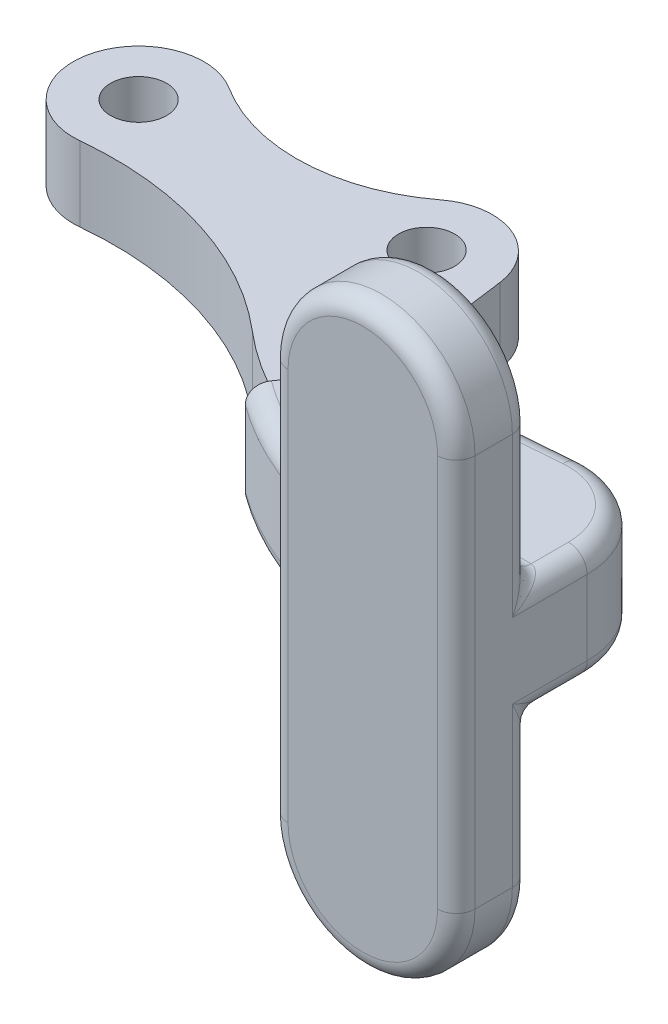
ISO-10303-21;
HEADER;
FILE_DESCRIPTION(('STEP AP214'),'2;1');
FILE_NAME('part.step','',(''),(''),'','','');
FILE_SCHEMA(('AUTOMOTIVE_DESIGN { 1 0 10303 214 1 1 1 1 }'));
ENDSEC;
DATA;
#1=APPLICATION_CONTEXT('core data for automotive mechanical design processes');
#2=APPLICATION_PROTOCOL_DEFINITION('international standard','automotive_design',2000,#1);
#3=PRODUCT_CONTEXT('',#1,'mechanical');
#4=PRODUCT('Part','Part','',(#3));
#5=PRODUCT_RELATED_PRODUCT_CATEGORY('part','',(#4));
#6=PRODUCT_DEFINITION_FORMATION('','',#4);
#7=PRODUCT_DEFINITION_CONTEXT('part definition',#1,'design');
#8=PRODUCT_DEFINITION('design','',#6,#7);
#9=PRODUCT_DEFINITION_SHAPE('','',#8);
#10=(LENGTH_UNIT() NAMED_UNIT(*) SI_UNIT(.MILLI.,.METRE.));
#11=(NAMED_UNIT(*) PLANE_ANGLE_UNIT() SI_UNIT($,.RADIAN.));
#12=(NAMED_UNIT(*) SI_UNIT($,.STERADIAN.) SOLID_ANGLE_UNIT());
#13=UNCERTAINTY_MEASURE_WITH_UNIT(LENGTH_MEASURE(1.E-05),#10,'distance_accuracy_value','');
#14=(GEOMETRIC_REPRESENTATION_CONTEXT(3) GLOBAL_UNCERTAINTY_ASSIGNED_CONTEXT((#13)) GLOBAL_UNIT_ASSIGNED_CONTEXT((#10,
#11,#12)) REPRESENTATION_CONTEXT('',''));
#15=CARTESIAN_POINT('',(0.,0.,0.));
#16=DIRECTION('',(0.,0.,1.));
#17=DIRECTION('',(1.,0.,0.));
#18=AXIS2_PLACEMENT_3D('',#15,#16,#17);
#19=CARTESIAN_POINT('',(28.2332660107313,1.99999998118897,-4.0282865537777));
#20=DIRECTION('',(6.66275308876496E-10,1.,0.));
#21=DIRECTION('',(0.,0.,-1.));
#22=AXIS2_PLACEMENT_3D('',#19,#20,#21);
#23=PLANE('',#22);
#24=CARTESIAN_POINT('',(25.4581621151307,1.99999998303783,-6.00279750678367));
#25=DIRECTION('',(-6.66275610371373E-10,-1.,0.));
#26=DIRECTION('',(0.,0.,-1.));
#27=AXIS2_PLACEMENT_3D('',#24,#25,#26);
#28=CIRCLE('',#27,17.9999999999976);
#29=CARTESIAN_POINT('',(25.0073769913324,1.99999998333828,11.9915569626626));
#30=VERTEX_POINT('',#29);
#31=CARTESIAN_POINT('',(17.7465743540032,1.99999998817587,10.2616242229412));
#32=VERTEX_POINT('',#31);
#33=EDGE_CURVE('E1868',#30,#32,#28,.T.);
#34=ORIENTED_EDGE('',*,*,#33,.F.);
#35=DIRECTION('',(0.,0.,-1.));
#36=VECTOR('',#35,1.);
#37=CARTESIAN_POINT('',(25.0073769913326,1.9999999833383,-4.02828655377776));
#38=LINE('',#37,#36);
#39=CARTESIAN_POINT('',(25.0073769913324,1.99999998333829,13.6802887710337));
#40=VERTEX_POINT('',#39);
#41=EDGE_CURVE('E527',#40,#30,#38,.T.);
#42=ORIENTED_EDGE('',*,*,#41,.F.);
#43=CARTESIAN_POINT('',(28.2332660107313,1.99999998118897,-4.0282865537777));
#44=DIRECTION('',(6.66275308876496E-10,1.,0.));
#45=DIRECTION('',(0.,0.,-1.));
#46=AXIS2_PLACEMENT_3D('',#43,#44,#45);
#47=CIRCLE('',#46,18.);
#48=CARTESIAN_POINT('',(17.5865578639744,1.99999998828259,10.4854175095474));
#49=VERTEX_POINT('',#48);
#50=EDGE_CURVE('E967',#49,#40,#47,.T.);
#51=ORIENTED_EDGE('',*,*,#50,.F.);
#52=DIRECTION('',(-0.581633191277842,3.87527208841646E-10,0.813451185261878));
#53=VECTOR('',#52,1.);
#54=CARTESIAN_POINT('',(20.7855404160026,1.9999999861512,6.01143599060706));
#55=LINE('',#54,#53);
#56=EDGE_CURVE('E1123',#32,#49,#55,.T.);
#57=ORIENTED_EDGE('',*,*,#56,.F.);
#58=EDGE_LOOP('',(#34,#42,#51,#57));
#59=FACE_BOUND('',#58,.T.);
#60=ADVANCED_FACE('F14',(#59),#23,.F.);
#61=CARTESIAN_POINT('',(29.0073769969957,10.4999999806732,16.0114359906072));
#62=DIRECTION('',(0.,0.,1.));
#63=DIRECTION('',(-1.,6.66279965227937E-10,0.));
#64=AXIS2_PLACEMENT_3D('',#61,#62,#63);
#65=TOROIDAL_SURFACE('',#64,4.00000000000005,1.);
#66=CARTESIAN_POINT('',(25.0073769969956,10.4999999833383,16.0114359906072));
#67=DIRECTION('',(-6.66275308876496E-10,-1.,0.));
#68=DIRECTION('',(0.,0.,1.));
#69=AXIS2_PLACEMENT_3D('',#66,#67,#68);
#70=CIRCLE('',#69,1.);
#71=CARTESIAN_POINT('',(25.0073769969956,10.4999999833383,17.0114359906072));
#72=VERTEX_POINT('',#71);
#73=CARTESIAN_POINT('',(24.0073769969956,10.4999999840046,16.0114359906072));
#74=VERTEX_POINT('',#73);
#75=EDGE_CURVE('E884',#72,#74,#70,.T.);
#76=ORIENTED_EDGE('',*,*,#75,.F.);
#77=CARTESIAN_POINT('',(29.0073769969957,10.4999999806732,17.0114359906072));
#78=DIRECTION('',(0.,0.,-1.));
#79=DIRECTION('',(-1.,6.66275628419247E-10,0.));
#80=AXIS2_PLACEMENT_3D('',#77,#78,#79);
#81=CIRCLE('',#80,4.00000000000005);
#82=CARTESIAN_POINT('',(33.0073769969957,10.4999999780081,17.0114359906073));
#83=VERTEX_POINT('',#82);
#84=EDGE_CURVE('E962',#83,#72,#81,.F.);
#85=ORIENTED_EDGE('',*,*,#84,.F.);
#86=CARTESIAN_POINT('',(33.0073769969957,10.4999999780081,16.0114359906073));
#87=DIRECTION('',(6.66275431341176E-10,1.,0.));
#88=DIRECTION('',(1.,-6.66275431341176E-10,0.));
#89=AXIS2_PLACEMENT_3D('',#86,#87,#88);
#90=CIRCLE('',#89,1.);
#91=CARTESIAN_POINT('',(34.0073769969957,10.4999999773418,16.0114359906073));
#92=VERTEX_POINT('',#91);
#93=EDGE_CURVE('E988',#83,#92,#90,.T.);
#94=ORIENTED_EDGE('',*,*,#93,.T.);
#95=CARTESIAN_POINT('',(29.0073769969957,10.4999999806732,16.0114359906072));
#96=DIRECTION('',(0.,0.,1.));
#97=DIRECTION('',(-1.,6.66275308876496E-10,0.));
#98=AXIS2_PLACEMENT_3D('',#95,#96,#97);
#99=CIRCLE('',#98,5.);
#100=EDGE_CURVE('E1358',#74,#92,#99,.F.);
#101=ORIENTED_EDGE('',*,*,#100,.F.);
#102=EDGE_LOOP('',(#76,#85,#94,#101));
#103=FACE_BOUND('',#102,.T.);
#104=ADVANCED_FACE('F968',(#103),#65,.T.);
#105=CARTESIAN_POINT('',(29.0073769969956,10.4999999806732,17.0114359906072));
#106=DIRECTION('',(0.,0.,1.));
#107=DIRECTION('',(-1.,6.66275308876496E-10,0.));
#108=AXIS2_PLACEMENT_3D('',#105,#106,#107);
#109=PLANE('',#108);
#110=CARTESIAN_POINT('',(29.0073769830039,-10.5000000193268,17.0114359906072));
#111=DIRECTION('',(0.,0.,-1.));
#112=DIRECTION('',(1.,-6.66277796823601E-10,0.));
#113=AXIS2_PLACEMENT_3D('',#110,#111,#112);
#114=CIRCLE('',#113,3.99999999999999);
#115=CARTESIAN_POINT('',(33.0073769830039,-10.5000000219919,17.0114359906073));
#116=VERTEX_POINT('',#115);
#117=CARTESIAN_POINT('',(25.0073769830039,-10.5000000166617,17.0114359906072));
#118=VERTEX_POINT('',#117);
#119=EDGE_CURVE('E949',#116,#118,#114,.T.);
#120=ORIENTED_EDGE('',*,*,#119,.F.);
#121=DIRECTION('',(6.66275308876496E-10,1.,0.));
#122=VECTOR('',#121,1.);
#123=CARTESIAN_POINT('',(33.0073769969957,10.4999999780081,17.0114359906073));
#124=LINE('',#123,#122);
#125=EDGE_CURVE('E1352',#83,#116,#124,.F.);
#126=ORIENTED_EDGE('',*,*,#125,.F.);
#127=ORIENTED_EDGE('',*,*,#84,.T.);
#128=DIRECTION('',(-6.66275308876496E-10,-1.,0.));
#129=VECTOR('',#128,1.);
#130=CARTESIAN_POINT('',(25.0073769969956,10.4999999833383,17.0114359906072));
#131=LINE('',#130,#129);
#132=EDGE_CURVE('E892',#118,#72,#131,.F.);
#133=ORIENTED_EDGE('',*,*,#132,.F.);
#134=EDGE_LOOP('',(#120,#126,#127,#133));
#135=FACE_BOUND('',#134,.T.);
#136=ADVANCED_FACE('F978',(#135),#109,.T.);
#137=CARTESIAN_POINT('',(29.0073769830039,-10.5000000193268,16.0114359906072));
#138=DIRECTION('',(0.,0.,1.));
#139=DIRECTION('',(-1.,6.66274761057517E-10,0.));
#140=AXIS2_PLACEMENT_3D('',#137,#138,#139);
#141=TOROIDAL_SURFACE('',#140,4.,1.);
#142=CARTESIAN_POINT('',(25.0073769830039,-10.5000000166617,16.0114359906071));
#143=DIRECTION('',(-6.66275308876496E-10,-1.,0.));
#144=DIRECTION('',(0.,0.,1.));
#145=AXIS2_PLACEMENT_3D('',#142,#143,#144);
#146=CIRCLE('',#145,1.);
#147=CARTESIAN_POINT('',(24.0073769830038,-10.5000000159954,16.0114359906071));
#148=VERTEX_POINT('',#147);
#149=EDGE_CURVE('E886',#148,#118,#146,.F.);
#150=ORIENTED_EDGE('',*,*,#149,.F.);
#151=CARTESIAN_POINT('',(29.0073769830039,-10.5000000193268,16.0114359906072));
#152=DIRECTION('',(0.,0.,1.));
#153=DIRECTION('',(-1.,6.66275308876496E-10,0.));
#154=AXIS2_PLACEMENT_3D('',#151,#152,#153);
#155=CIRCLE('',#154,5.);
#156=CARTESIAN_POINT('',(34.0073769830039,-10.5000000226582,16.0114359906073));
#157=VERTEX_POINT('',#156);
#158=EDGE_CURVE('E1351',#157,#148,#155,.F.);
#159=ORIENTED_EDGE('',*,*,#158,.F.);
#160=CARTESIAN_POINT('',(33.0073769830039,-10.5000000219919,16.0114359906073));
#161=DIRECTION('',(6.66275308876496E-10,1.,0.));
#162=DIRECTION('',(0.,0.,-1.));
#163=AXIS2_PLACEMENT_3D('',#160,#161,#162);
#164=CIRCLE('',#163,1.);
#165=EDGE_CURVE('E1361',#116,#157,#164,.T.);
#166=ORIENTED_EDGE('',*,*,#165,.F.);
#167=ORIENTED_EDGE('',*,*,#119,.T.);
#168=EDGE_LOOP('',(#150,#159,#166,#167));
#169=FACE_BOUND('',#168,.T.);
#170=ADVANCED_FACE('F924',(#169),#141,.T.);
#171=CARTESIAN_POINT('',(23.1160903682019,-2.92051514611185,13.6361583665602));
#172=CARTESIAN_POINT('',(24.0073769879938,-3.01077500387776,13.672955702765));
#173=CARTESIAN_POINT('',(24.0073769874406,-3.84103027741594,14.0114359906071));
#174=CARTESIAN_POINT('',(23.1397077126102,-2.88292490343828,13.7352047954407));
#175=CARTESIAN_POINT('',(24.0073769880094,-2.98742912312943,13.7863945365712));
#176=CARTESIAN_POINT('',(24.0073769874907,-3.76584343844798,14.195861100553));
#177=CARTESIAN_POINT('',(23.1608304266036,-2.83346662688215,13.8261584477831));
#178=CARTESIAN_POINT('',(24.007376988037,-2.94586822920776,13.8962419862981));
#179=CARTESIAN_POINT('',(24.0073769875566,-3.66693324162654,14.3657209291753));
#180=CARTESIAN_POINT('',(23.1986284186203,-2.71061665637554,13.9918449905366));
#181=CARTESIAN_POINT('',(24.0073769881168,-2.82618189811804,14.0999930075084));
#182=CARTESIAN_POINT('',(24.0073769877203,-3.42123329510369,14.6757960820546));
#183=CARTESIAN_POINT('',(23.2148861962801,-2.63805831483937,14.0647719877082));
#184=CARTESIAN_POINT('',(24.0073769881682,-2.74897527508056,14.1924808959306));
#185=CARTESIAN_POINT('',(24.007376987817,-3.27611661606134,14.8126216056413));
#186=CARTESIAN_POINT('',(23.2412631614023,-2.47657926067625,14.1844784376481));
#187=CARTESIAN_POINT('',(24.0073769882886,-2.56816146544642,14.3453732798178));
#188=CARTESIAN_POINT('',(24.0073769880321,-2.95315850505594,15.0374889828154));
#189=CARTESIAN_POINT('',(23.2515296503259,-2.38630181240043,14.2319098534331));
#190=CARTESIAN_POINT('',(24.0073769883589,-2.46282820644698,14.4073021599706));
#191=CARTESIAN_POINT('',(24.0073769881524,-2.77260361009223,15.1267528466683));
#192=CARTESIAN_POINT('',(23.2651247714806,-2.19909033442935,14.2949948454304));
#193=CARTESIAN_POINT('',(24.007376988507,-2.24060187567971,14.489575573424));
#194=CARTESIAN_POINT('',(24.0073769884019,-2.39818065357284,15.2455276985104));
#195=CARTESIAN_POINT('',(23.2686714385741,-2.09964559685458,14.311637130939));
#196=CARTESIAN_POINT('',(24.0073769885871,-2.12030270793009,14.5116038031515));
#197=CARTESIAN_POINT('',(24.0073769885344,-2.19929117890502,15.2768962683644));
#198=CARTESIAN_POINT('',(23.2686714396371,-2.00000001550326,14.3116371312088));
#199=CARTESIAN_POINT('',(24.0073769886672,-2.00000001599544,14.5116038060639));
#200=CARTESIAN_POINT('',(24.0073769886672,-2.00000001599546,15.2768962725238));
#201=(BOUNDED_SURFACE() B_SPLINE_SURFACE(3,2,((#171,#172,#173),(#174,#175,#176),(#177,#178,
#179),(#180,#181,#182),(#183,#184,#185),(#186,#187,#188),(#189,#190,#191),(#192,#193,#194),
(#195,#196,#197),(#198,#199,#200)),.UNSPECIFIED.,.F.,.F.,.F.) B_SPLINE_SURFACE_WITH_KNOTS((4,2,
2,2,4),(3,3),(0.,0.000589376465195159,0.00117875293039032,0.00176812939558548,
0.00235750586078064),(0.,1.),
.UNSPECIFIED.) GEOMETRIC_REPRESENTATION_ITEM() RATIONAL_B_SPLINE_SURFACE(((1.,0.744551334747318,
1.),(1.,0.75247673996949,1.),(1.,0.759450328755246,1.),(1.,0.771792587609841,1.),(1.,
0.777027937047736,1.),(1.,0.785468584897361,1.),(1.,0.788721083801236,1.),(1.,0.793018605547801,
1.),(1.,0.794137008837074,1.),(1.,0.794133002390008,1.))) REPRESENTATION_ITEM('') SURFACE());
#202=CARTESIAN_POINT('',(24.0073769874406,-3.84103027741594,14.0114359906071));
#203=CARTESIAN_POINT('',(24.0073769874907,-3.76584343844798,14.195861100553));
#204=CARTESIAN_POINT('',(24.0073769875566,-3.66693324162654,14.3657209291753));
#205=CARTESIAN_POINT('',(24.0073769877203,-3.42123329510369,14.6757960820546));
#206=CARTESIAN_POINT('',(24.007376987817,-3.27611661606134,14.8126216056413));
#207=CARTESIAN_POINT('',(24.0073769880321,-2.95315850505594,15.0374889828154));
#208=CARTESIAN_POINT('',(24.0073769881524,-2.77260361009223,15.1267528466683));
#209=CARTESIAN_POINT('',(24.0073769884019,-2.39818065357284,15.2455276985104));
#210=CARTESIAN_POINT('',(24.0073769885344,-2.19929117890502,15.2768962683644));
#211=CARTESIAN_POINT('',(24.0073769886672,-2.00000001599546,15.2768962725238));
#212=(BOUNDED_CURVE() B_SPLINE_CURVE(3,(#202,#203,#204,#205,#206,#207,#208,#209,#210,#211),
.UNSPECIFIED.,.F.,.F.) B_SPLINE_CURVE_WITH_KNOTS((4,2,2,2,4),(0.,0.000589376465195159,
0.00117875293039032,0.00176812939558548,0.00235750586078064),
.UNSPECIFIED.) CURVE() GEOMETRIC_REPRESENTATION_ITEM() RATIONAL_B_SPLINE_CURVE((1.,1.,1.,1.,1.,
1.,1.,1.,1.,1.)) REPRESENTATION_ITEM(''));
#213=CARTESIAN_POINT('',(24.0073769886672,-2.00000001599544,15.2768962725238));
#214=VERTEX_POINT('',#213);
#215=CARTESIAN_POINT('',(24.0073769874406,-3.84103027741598,14.0114359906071));
#216=VERTEX_POINT('',#215);
#217=EDGE_CURVE('E904',#214,#216,#212,.F.);
#218=CARTESIAN_POINT('',(23.0073769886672,-2.0000000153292,15.2768962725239));
#219=DIRECTION('',(-6.6626631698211E-10,-1.,0.));
#220=DIRECTION('',(0.,0.,1.));
#221=AXIS2_PLACEMENT_3D('',#218,#219,#220);
#222=CIRCLE('',#221,1.);
#223=CARTESIAN_POINT('',(23.2686714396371,-2.00000001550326,14.3116371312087));
#224=VERTEX_POINT('',#223);
#225=EDGE_CURVE('E910',#224,#214,#222,.T.);
#226=CARTESIAN_POINT('',(23.116090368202,-2.92051514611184,13.6361583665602));
#227=CARTESIAN_POINT('',(23.1191138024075,-2.9157024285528,13.6488394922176));
#228=CARTESIAN_POINT('',(23.1221064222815,-2.91066837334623,13.6614441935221));
#229=CARTESIAN_POINT('',(23.1279954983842,-2.9002174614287,13.6863419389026));
#230=CARTESIAN_POINT('',(23.1308926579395,-2.89480555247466,13.6986368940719));
#231=CARTESIAN_POINT('',(23.1365919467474,-2.88361408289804,13.7229044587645));
#232=CARTESIAN_POINT('',(23.139394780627,-2.87783937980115,13.7348791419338));
#233=CARTESIAN_POINT('',(23.1449062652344,-2.86593782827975,13.758496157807));
#234=CARTESIAN_POINT('',(23.1476156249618,-2.85981573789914,13.7701407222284));
#235=CARTESIAN_POINT('',(23.1529408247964,-2.84723503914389,13.7930882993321));
#236=CARTESIAN_POINT('',(23.1555573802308,-2.84078108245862,13.8043936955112));
#237=CARTESIAN_POINT('',(23.1606974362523,-2.82755241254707,13.8266544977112));
#238=CARTESIAN_POINT('',(23.1632216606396,-2.82078223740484,13.8376124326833));
#239=CARTESIAN_POINT('',(23.1681773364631,-2.80693697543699,13.8591706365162));
#240=CARTESIAN_POINT('',(23.1706095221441,-2.79986630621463,13.8697735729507));
#241=CARTESIAN_POINT('',(23.1753812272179,-2.78543595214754,13.890614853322));
#242=CARTESIAN_POINT('',(23.1777214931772,-2.77808055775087,13.9008559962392));
#243=CARTESIAN_POINT('',(23.1823093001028,-2.76309666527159,13.9209675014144));
#244=CARTESIAN_POINT('',(23.1845576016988,-2.75547232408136,13.9308407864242));
#245=CARTESIAN_POINT('',(23.1889612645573,-2.73996643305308,13.9502111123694));
#246=CARTESIAN_POINT('',(23.1911174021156,-2.73208890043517,13.9597111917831));
#247=CARTESIAN_POINT('',(23.1953363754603,-2.71609247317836,13.9783303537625));
#248=CARTESIAN_POINT('',(23.1974000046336,-2.70797745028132,13.9874525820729));
#249=CARTESIAN_POINT('',(23.2014334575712,-2.69152181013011,14.0053119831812));
#250=CARTESIAN_POINT('',(23.2034040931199,-2.68318491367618,14.0140524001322));
#251=CARTESIAN_POINT('',(23.2072509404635,-2.66630118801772,14.0311448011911));
#252=CARTESIAN_POINT('',(23.2091279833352,-2.65775792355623,14.0395001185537));
#253=CARTESIAN_POINT('',(23.2127868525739,-2.64047698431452,14.0558195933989));
#254=CARTESIAN_POINT('',(23.2145695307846,-2.63174271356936,14.0637871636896));
#255=CARTESIAN_POINT('',(23.2180389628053,-2.61409514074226,14.0793290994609));
#256=CARTESIAN_POINT('',(23.2197265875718,-2.60518507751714,14.0869069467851));
#257=CARTESIAN_POINT('',(23.2230043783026,-2.5872010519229,14.1016678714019));
#258=CARTESIAN_POINT('',(23.2245954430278,-2.57813016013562,14.1088544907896));
#259=CARTESIAN_POINT('',(23.2279127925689,-2.55846646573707,14.1238819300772));
#260=CARTESIAN_POINT('',(23.2296274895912,-2.54783621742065,14.1316763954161));
#261=CARTESIAN_POINT('',(23.2329450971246,-2.52632875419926,14.146792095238));
#262=CARTESIAN_POINT('',(23.2345486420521,-2.51545350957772,14.1541159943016));
#263=CARTESIAN_POINT('',(23.237643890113,-2.49347305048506,14.1682831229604));
#264=CARTESIAN_POINT('',(23.2391362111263,-2.48236962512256,14.1751289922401));
#265=CARTESIAN_POINT('',(23.2420096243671,-2.45995032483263,14.1883332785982));
#266=CARTESIAN_POINT('',(23.2433913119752,-2.44863605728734,14.1946942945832));
#267=CARTESIAN_POINT('',(23.2460437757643,-2.42581268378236,14.2069227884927));
#268=CARTESIAN_POINT('',(23.2473151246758,-2.41430500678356,14.21279280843));
#269=CARTESIAN_POINT('',(23.249747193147,-2.39111259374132,14.2240339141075));
#270=CARTESIAN_POINT('',(23.2509084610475,-2.37942911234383,14.2294074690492));
#271=CARTESIAN_POINT('',(23.2531205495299,-2.35590298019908,14.2396509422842));
#272=CARTESIAN_POINT('',(23.2541718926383,-2.34406141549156,14.2445232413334));
#273=CARTESIAN_POINT('',(23.256164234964,-2.32023709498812,14.2537601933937));
#274=CARTESIAN_POINT('',(23.2571057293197,-2.30825526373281,14.2581271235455));
#275=CARTESIAN_POINT('',(23.2588783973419,-2.2841684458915,14.2663500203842));
#276=CARTESIAN_POINT('',(23.2597100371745,-2.27206423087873,14.2702081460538));
#277=CARTESIAN_POINT('',(23.2612629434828,-2.24775071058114,14.2774108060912));
#278=CARTESIAN_POINT('',(23.2619846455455,-2.23554203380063,14.2807573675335));
#279=CARTESIAN_POINT('',(23.2633175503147,-2.21103765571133,14.2869349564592));
#280=CARTESIAN_POINT('',(23.2639291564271,-2.1987424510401,14.2897678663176));
#281=CARTESIAN_POINT('',(23.2650416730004,-2.17408305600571,14.2949168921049));
#282=CARTESIAN_POINT('',(23.2655429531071,-2.16171924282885,14.2972347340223));
#283=CARTESIAN_POINT('',(23.2664345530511,-2.13694061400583,14.3013530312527));
#284=CARTESIAN_POINT('',(23.2668252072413,-2.12452606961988,14.3031550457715));
#285=CARTESIAN_POINT('',(23.2674952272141,-2.09966388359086,14.3062417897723));
#286=CARTESIAN_POINT('',(23.267774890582,-2.08721642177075,14.3075279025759));
#287=CARTESIAN_POINT('',(23.2682225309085,-2.06230618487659,14.3095835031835));
#288=CARTESIAN_POINT('',(23.2683907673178,-2.04984351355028,14.3103541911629));
#289=CARTESIAN_POINT('',(23.2686151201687,-2.02492055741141,14.3113806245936));
#290=CARTESIAN_POINT('',(23.2686714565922,-2.01246031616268,14.311637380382));
#291=CARTESIAN_POINT('',(23.2686714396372,-2.00000001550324,14.3116371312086));
#292=B_SPLINE_CURVE_WITH_KNOTS('',3,(#226,#227,#228,#229,#230,#231,#232,#233,#234,#235,#236,
#237,#238,#239,#240,#241,#242,#243,#244,#245,#246,#247,#248,#249,#250,#251,#252,#253,#254,#255,
#256,#257,#258,#259,#260,#261,#262,#263,#264,#265,#266,#267,#268,#269,#270,#271,#272,#273,#274,
#275,#276,#277,#278,#279,#280,#281,#282,#283,#284,#285,#286,#287,#288,#289,#290,#291),
.UNSPECIFIED.,.F.,.F.,(4,2,2,2,2,2,2,2,2,2,2,2,2,2,2,2,2,2,2,2,2,2,2,2,2,2,2,2,2,2,2,2,4),(0.,
0.0416879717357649,0.0829066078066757,0.123658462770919,0.163946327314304,0.203773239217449,
0.243142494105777,0.282057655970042,0.320522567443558,0.358541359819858,0.396118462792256,
0.433258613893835,0.46996686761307,0.506248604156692,0.542109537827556,0.577555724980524,
0.612593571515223,0.652460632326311,0.692077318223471,0.731454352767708,0.77060280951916,
0.80953410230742,0.848259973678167,0.886792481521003,0.925143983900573,0.963327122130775,
1.00135480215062,1.03924017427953,1.07699661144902,1.11463768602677,1.15217714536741,
1.18962888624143,1.22700692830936),.UNSPECIFIED.);
#293=CARTESIAN_POINT('',(23.1160903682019,-2.92051514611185,13.6361583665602));
#294=VERTEX_POINT('',#293);
#295=EDGE_CURVE('E424',#294,#224,#292,.T.);
#296=CARTESIAN_POINT('',(23.0073769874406,-3.84103027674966,14.0114359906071));
#297=DIRECTION('',(2.51516137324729E-10,0.377515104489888,0.926003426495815));
#298=DIRECTION('',(6.16978570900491E-10,0.926003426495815,-0.377515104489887));
#299=AXIS2_PLACEMENT_3D('',#296,#297,#298);
#300=CIRCLE('',#299,1.);
#301=EDGE_CURVE('E887',#216,#294,#300,.T.);
#302=ORIENTED_EDGE('',*,*,#217,.F.);
#303=ORIENTED_EDGE('',*,*,#225,.F.);
#304=ORIENTED_EDGE('',*,*,#295,.F.);
#305=ORIENTED_EDGE('',*,*,#301,.F.);
#306=EDGE_LOOP('',(#302,#303,#304,#305));
#307=FACE_BOUND('',#306,.T.);
#308=ADVANCED_FACE('F912',(#307),#201,.F.);
#309=CARTESIAN_POINT('',(25.0073769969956,10.4999999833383,16.0114359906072));
#310=DIRECTION('',(-6.66275308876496E-10,-1.,0.));
#311=DIRECTION('',(0.,0.,1.));
#312=AXIS2_PLACEMENT_3D('',#309,#310,#311);
#313=CYLINDRICAL_SURFACE('',#312,1.);
#314=ORIENTED_EDGE('',*,*,#149,.T.);
#315=ORIENTED_EDGE('',*,*,#132,.T.);
#316=ORIENTED_EDGE('',*,*,#75,.T.);
#317=DIRECTION('',(-6.66275308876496E-10,-1.,0.));
#318=VECTOR('',#317,1.);
#319=CARTESIAN_POINT('',(24.0073769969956,10.4999999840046,16.0114359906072));
#320=LINE('',#319,#318);
#321=EDGE_CURVE('E876',#148,#74,#320,.F.);
#322=ORIENTED_EDGE('',*,*,#321,.F.);
#323=EDGE_LOOP('',(#314,#315,#316,#322));
#324=FACE_BOUND('',#323,.T.);
#325=ADVANCED_FACE('F923',(#324),#313,.T.);
#326=CARTESIAN_POINT('',(23.2686714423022,1.99999998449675,14.3116371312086));
#327=CARTESIAN_POINT('',(24.0073769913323,1.99999998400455,14.5116038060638));
#328=CARTESIAN_POINT('',(24.0073769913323,1.99999998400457,15.2768962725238));
#329=CARTESIAN_POINT('',(23.2686714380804,2.19800090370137,14.3116371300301));
#330=CARTESIAN_POINT('',(24.0073769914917,2.23922089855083,14.5116037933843));
#331=CARTESIAN_POINT('',(24.0073769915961,2.39600182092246,15.2768962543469));
#332=CARTESIAN_POINT('',(23.2547116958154,2.39358439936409,14.2455330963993));
#333=CARTESIAN_POINT('',(24.0073769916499,2.47659235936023,14.4221528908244));
#334=CARTESIAN_POINT('',(24.0073769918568,2.78716881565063,15.152183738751));
#335=CARTESIAN_POINT('',(23.2151201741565,2.63695299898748,14.0658233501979));
#336=CARTESIAN_POINT('',(24.0073769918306,2.74778854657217,14.1938097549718));
#337=CARTESIAN_POINT('',(24.0073769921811,3.27390601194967,14.8145945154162));
#338=CARTESIAN_POINT('',(23.1988311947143,2.70973657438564,13.9927525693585));
#339=CARTESIAN_POINT('',(24.0073769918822,2.82524826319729,14.1011463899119));
#340=CARTESIAN_POINT('',(24.0073769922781,3.41947316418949,14.6774984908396));
#341=CARTESIAN_POINT('',(23.1612649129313,2.83227174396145,13.8280445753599));
#342=CARTESIAN_POINT('',(24.0073769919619,2.94477176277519,13.8985440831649));
#343=CARTESIAN_POINT('',(24.0073769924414,3.66454350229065,14.3692468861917));
#344=CARTESIAN_POINT('',(23.1395824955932,2.88312417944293,13.7346796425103));
#345=CARTESIAN_POINT('',(24.0073769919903,2.98755724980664,13.7857718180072));
#346=CARTESIAN_POINT('',(24.0073769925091,3.76625710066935,14.1948463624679));
#347=CARTESIAN_POINT('',(23.1160903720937,2.92051511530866,13.6361583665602));
#348=CARTESIAN_POINT('',(24.0073769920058,3.01077497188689,13.672955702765));
#349=CARTESIAN_POINT('',(24.0073769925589,3.84103024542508,14.0114359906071));
#350=(BOUNDED_SURFACE() B_SPLINE_SURFACE(3,2,((#326,#327,#328),(#329,#330,#331),(#332,#333,
#334),(#335,#336,#337),(#338,#339,#340),(#341,#342,#343),(#344,#345,#346),(#347,#348,#349)),
.UNSPECIFIED.,.F.,.F.,.F.) B_SPLINE_SURFACE_WITH_KNOTS((4,2,2,4),(3,3),(0.,0.00117827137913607,
0.00176740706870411,0.00235654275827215),(0.,1.),
.UNSPECIFIED.) GEOMETRIC_REPRESENTATION_ITEM() RATIONAL_B_SPLINE_SURFACE(((1.,0.794133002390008,
1.),(1.,0.794138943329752,1.),(1.,0.789771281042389,1.),(1.,0.777103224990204,1.),(1.,
0.771857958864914,1.),(1.,0.759593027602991,1.),(1.,0.752445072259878,1.),(1.,0.744551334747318,1.))) REPRESENTATION_ITEM('') SURFACE());
#351=CARTESIAN_POINT('',(24.0073769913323,1.99999998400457,15.2768962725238));
#352=CARTESIAN_POINT('',(24.0073769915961,2.39600182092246,15.2768962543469));
#353=CARTESIAN_POINT('',(24.0073769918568,2.78716881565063,15.152183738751));
#354=CARTESIAN_POINT('',(24.0073769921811,3.27390601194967,14.8145945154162));
#355=CARTESIAN_POINT('',(24.0073769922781,3.41947316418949,14.6774984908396));
#356=CARTESIAN_POINT('',(24.0073769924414,3.66454350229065,14.3692468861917));
#357=CARTESIAN_POINT('',(24.0073769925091,3.76625710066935,14.1948463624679));
#358=CARTESIAN_POINT('',(24.0073769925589,3.84103024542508,14.0114359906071));
#359=(BOUNDED_CURVE() B_SPLINE_CURVE(3,(#351,#352,#353,#354,#355,#356,#357,#358),.UNSPECIFIED.,
.F.,.F.) B_SPLINE_CURVE_WITH_KNOTS((4,2,2,4),(0.,0.00117827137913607,0.00176740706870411,
0.00235654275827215),
.UNSPECIFIED.) CURVE() GEOMETRIC_REPRESENTATION_ITEM() RATIONAL_B_SPLINE_CURVE((1.,1.,1.,1.,1.,
1.,1.,1.)) REPRESENTATION_ITEM(''));
#360=CARTESIAN_POINT('',(24.0073769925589,3.84103024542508,14.0114359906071));
#361=VERTEX_POINT('',#360);
#362=CARTESIAN_POINT('',(24.0073769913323,1.99999998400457,15.2768962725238));
#363=VERTEX_POINT('',#362);
#364=EDGE_CURVE('E854',#361,#363,#359,.F.);
#365=CARTESIAN_POINT('',(23.007376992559,3.84103024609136,14.0114359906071));
#366=DIRECTION('',(-2.5154189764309E-10,-0.377515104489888,0.926003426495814));
#367=DIRECTION('',(6.16967866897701E-10,0.926003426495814,0.377515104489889));
#368=AXIS2_PLACEMENT_3D('',#365,#366,#367);
#369=CIRCLE('',#368,1.);
#370=CARTESIAN_POINT('',(23.1160903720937,2.92051511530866,13.6361583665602));
#371=VERTEX_POINT('',#370);
#372=EDGE_CURVE('E858',#371,#361,#369,.T.);
#373=CARTESIAN_POINT('',(23.2686714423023,1.99999998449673,14.3116371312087));
#374=CARTESIAN_POINT('',(23.2686714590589,2.01242138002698,14.3116373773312));
#375=CARTESIAN_POINT('',(23.2686154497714,2.02484271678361,14.3113822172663));
#376=CARTESIAN_POINT('',(23.2683924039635,2.04968806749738,14.3103621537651));
#377=CARTESIAN_POINT('',(23.2682251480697,2.06211203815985,14.3095962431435));
#378=CARTESIAN_POINT('',(23.2677801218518,2.08694524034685,14.3075533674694));
#379=CARTESIAN_POINT('',(23.2675020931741,2.09935436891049,14.3062752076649));
#380=CARTESIAN_POINT('',(23.2668359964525,2.12414041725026,14.3032075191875));
#381=CARTESIAN_POINT('',(23.2664476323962,2.13651715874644,14.3014166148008));
#382=CARTESIAN_POINT('',(23.2655612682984,2.1612208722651,14.2973236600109));
#383=CARTESIAN_POINT('',(23.2650629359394,2.17354757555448,14.2950200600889));
#384=CARTESIAN_POINT('',(23.2639569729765,2.19813360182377,14.2899026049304));
#385=CARTESIAN_POINT('',(23.2633489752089,2.21039255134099,14.2870870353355));
#386=CARTESIAN_POINT('',(23.2620239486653,2.23482542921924,14.2809471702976));
#387=CARTESIAN_POINT('',(23.2613065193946,2.24699886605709,14.2776210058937));
#388=CARTESIAN_POINT('',(23.259762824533,2.27124307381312,14.2704621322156));
#389=CARTESIAN_POINT('',(23.2589361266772,2.2833132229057,14.2666274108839));
#390=CARTESIAN_POINT('',(23.2571740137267,2.30733323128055,14.2584542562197));
#391=CARTESIAN_POINT('',(23.2562381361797,2.31928232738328,14.2541136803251));
#392=CARTESIAN_POINT('',(23.2542577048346,2.34304265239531,14.2449323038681));
#393=CARTESIAN_POINT('',(23.2532126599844,2.35485296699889,14.2400892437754));
#394=CARTESIAN_POINT('',(23.2510138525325,2.37831822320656,14.2299070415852));
#395=CARTESIAN_POINT('',(23.2498595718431,2.38997209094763,14.2245655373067));
#396=CARTESIAN_POINT('',(23.2474421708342,2.41310704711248,14.2133912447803));
#397=CARTESIAN_POINT('',(23.2461785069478,2.42458689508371,14.2075560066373));
#398=CARTESIAN_POINT('',(23.2435421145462,2.4473565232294,14.195399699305));
#399=CARTESIAN_POINT('',(23.2421688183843,2.45864489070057,14.1890761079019));
#400=CARTESIAN_POINT('',(23.2393129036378,2.48101444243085,14.1759491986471));
#401=CARTESIAN_POINT('',(23.2378296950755,2.49209403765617,14.1691433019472));
#402=CARTESIAN_POINT('',(23.2347533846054,2.51402901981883,14.155058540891));
#403=CARTESIAN_POINT('',(23.2331596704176,2.52488263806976,14.1477770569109));
#404=CARTESIAN_POINT('',(23.2298625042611,2.54634916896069,14.1327485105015));
#405=CARTESIAN_POINT('',(23.2281584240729,2.55696013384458,14.1249988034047));
#406=CARTESIAN_POINT('',(23.2248521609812,2.57664563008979,14.1100148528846));
#407=CARTESIAN_POINT('',(23.223261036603,2.58575576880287,14.1028248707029));
#408=CARTESIAN_POINT('',(23.219982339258,2.60381805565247,14.0880544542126));
#409=CARTESIAN_POINT('',(23.2182938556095,2.61276710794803,14.0804704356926));
#410=CARTESIAN_POINT('',(23.2148219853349,2.63049229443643,14.0649133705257));
#411=CARTESIAN_POINT('',(23.2130377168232,2.63926516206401,14.0569368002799));
#412=CARTESIAN_POINT('',(23.2093749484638,2.65662277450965,14.0405965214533));
#413=CARTESIAN_POINT('',(23.2074955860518,2.66520408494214,14.0322293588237));
#414=CARTESIAN_POINT('',(23.2036433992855,2.68216322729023,14.0151104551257));
#415=CARTESIAN_POINT('',(23.2016697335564,2.69053746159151,14.0063553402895));
#416=CARTESIAN_POINT('',(23.1976295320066,2.70706694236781,13.9884637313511));
#417=CARTESIAN_POINT('',(23.1955621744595,2.71521843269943,13.9793239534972));
#418=CARTESIAN_POINT('',(23.1913350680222,2.73128679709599,13.9606668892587));
#419=CARTESIAN_POINT('',(23.1891745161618,2.73919976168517,13.9511464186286));
#420=CARTESIAN_POINT('',(23.1847613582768,2.75477535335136,13.9317325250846));
#421=CARTESIAN_POINT('',(23.1825079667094,2.76243392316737,13.9218360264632));
#422=CARTESIAN_POINT('',(23.1779093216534,2.77748494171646,13.9016753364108));
#423=CARTESIAN_POINT('',(23.1755632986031,2.78487319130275,13.8914081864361));
#424=CARTESIAN_POINT('',(23.1707794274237,2.79936775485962,13.8705121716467));
#425=CARTESIAN_POINT('',(23.1683408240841,2.80646973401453,13.8598804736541));
#426=CARTESIAN_POINT('',(23.1633716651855,2.82037594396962,13.8382620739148));
#427=CARTESIAN_POINT('',(23.1608403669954,2.82717571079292,13.8272726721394));
#428=CARTESIAN_POINT('',(23.1556855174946,2.84046172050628,13.804946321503));
#429=CARTESIAN_POINT('',(23.1530612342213,2.8469433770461,13.7936068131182));
#430=CARTESIAN_POINT('',(23.1477199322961,2.85957746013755,13.7705884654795));
#431=CARTESIAN_POINT('',(23.1450021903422,2.86572518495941,13.7589072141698));
#432=CARTESIAN_POINT('',(23.1394732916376,2.87767581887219,13.7352143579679));
#433=CARTESIAN_POINT('',(23.1366614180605,2.88347391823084,13.7232004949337));
#434=CARTESIAN_POINT('',(23.1309433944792,2.89470982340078,13.6988521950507));
#435=CARTESIAN_POINT('',(23.1280365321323,2.90014271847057,13.6865156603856));
#436=CARTESIAN_POINT('',(23.1221273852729,2.91063307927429,13.6615324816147));
#437=CARTESIAN_POINT('',(23.1191243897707,2.91568554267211,13.6488839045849));
#438=CARTESIAN_POINT('',(23.1160903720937,2.92051511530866,13.6361583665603));
#439=B_SPLINE_CURVE_WITH_KNOTS('',3,(#373,#374,#375,#376,#377,#378,#379,#380,#381,#382,#383,
#384,#385,#386,#387,#388,#389,#390,#391,#392,#393,#394,#395,#396,#397,#398,#399,#400,#401,#402,
#403,#404,#405,#406,#407,#408,#409,#410,#411,#412,#413,#414,#415,#416,#417,#418,#419,#420,#421,
#422,#423,#424,#425,#426,#427,#428,#429,#430,#431,#432,#433,#434,#435,#436,#437,#438),
.UNSPECIFIED.,.F.,.F.,(4,2,2,2,2,2,2,2,2,2,2,2,2,2,2,2,2,2,2,2,2,2,2,2,2,2,2,2,2,2,2,2,4),(0.,
0.0372613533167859,0.0745964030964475,0.112019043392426,0.149543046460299,0.187182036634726,
0.224949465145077,0.262858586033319,0.300922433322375,0.339153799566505,0.377565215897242,
0.416168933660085,0.454976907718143,0.494000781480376,0.533251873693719,0.572741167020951,
0.612479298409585,0.647614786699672,0.683161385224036,0.719125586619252,0.755513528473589,
0.792331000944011,0.829583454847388,0.867276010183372,0.905413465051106,0.94400030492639,
0.983040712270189,1.02253857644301,1.06249750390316,1.10292082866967,1.14381162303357,
1.18517270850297,1.22700666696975),.UNSPECIFIED.);
#440=CARTESIAN_POINT('',(23.2686714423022,1.99999998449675,14.3116371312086));
#441=VERTEX_POINT('',#440);
#442=EDGE_CURVE('E865',#441,#371,#439,.T.);
#443=CARTESIAN_POINT('',(23.0073769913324,1.99999998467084,15.2768962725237));
#444=DIRECTION('',(6.66275308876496E-10,1.,0.));
#445=DIRECTION('',(0.,0.,-1.));
#446=AXIS2_PLACEMENT_3D('',#443,#444,#445);
#447=CIRCLE('',#446,1.);
#448=EDGE_CURVE('E759',#363,#441,#447,.T.);
#449=ORIENTED_EDGE('',*,*,#364,.F.);
#450=ORIENTED_EDGE('',*,*,#372,.F.);
#451=ORIENTED_EDGE('',*,*,#442,.F.);
#452=ORIENTED_EDGE('',*,*,#448,.F.);
#453=EDGE_LOOP('',(#449,#450,#451,#452));
#454=FACE_BOUND('',#453,.T.);
#455=ADVANCED_FACE('F772',(#454),#350,.F.);
#456=CARTESIAN_POINT('',(29.007376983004,-10.5000000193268,14.0114359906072));
#457=DIRECTION('',(0.,0.,1.));
#458=DIRECTION('',(-1.,6.66279965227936E-10,0.));
#459=AXIS2_PLACEMENT_3D('',#456,#457,#458);
#460=TOROIDAL_SURFACE('',#459,4.00000000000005,1.);
#461=CARTESIAN_POINT('',(33.0073769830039,-10.5000000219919,14.0114359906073));
#462=DIRECTION('',(-6.66275308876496E-10,-1.,0.));
#463=DIRECTION('',(0.,0.,1.));
#464=AXIS2_PLACEMENT_3D('',#461,#462,#463);
#465=CIRCLE('',#464,1.);
#466=CARTESIAN_POINT('',(34.0073769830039,-10.5000000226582,14.0114359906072));
#467=VERTEX_POINT('',#466);
#468=CARTESIAN_POINT('',(33.0073769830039,-10.5000000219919,13.0114359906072));
#469=VERTEX_POINT('',#468);
#470=EDGE_CURVE('E1047',#467,#469,#465,.F.);
#471=ORIENTED_EDGE('',*,*,#470,.F.);
#472=CARTESIAN_POINT('',(29.007376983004,-10.5000000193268,14.0114359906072));
#473=DIRECTION('',(0.,0.,1.));
#474=DIRECTION('',(-1.,6.66275308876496E-10,0.));
#475=AXIS2_PLACEMENT_3D('',#472,#473,#474);
#476=CIRCLE('',#475,5.);
#477=CARTESIAN_POINT('',(24.0073769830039,-10.5000000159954,14.0114359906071));
#478=VERTEX_POINT('',#477);
#479=EDGE_CURVE('E1347',#478,#467,#476,.T.);
#480=ORIENTED_EDGE('',*,*,#479,.F.);
#481=CARTESIAN_POINT('',(25.0073769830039,-10.5000000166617,14.0114359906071));
#482=DIRECTION('',(6.66275308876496E-10,1.,0.));
#483=DIRECTION('',(0.,0.,-1.));
#484=AXIS2_PLACEMENT_3D('',#481,#482,#483);
#485=CIRCLE('',#484,1.);
#486=CARTESIAN_POINT('',(25.0073769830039,-10.5000000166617,13.0114359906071));
#487=VERTEX_POINT('',#486);
#488=EDGE_CURVE('E758',#487,#478,#485,.T.);
#489=ORIENTED_EDGE('',*,*,#488,.F.);
#490=CARTESIAN_POINT('',(29.007376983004,-10.5000000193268,13.0114359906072));
#491=DIRECTION('',(0.,0.,1.));
#492=DIRECTION('',(-1.,6.66279965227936E-10,0.));
#493=AXIS2_PLACEMENT_3D('',#490,#491,#492);
#494=CIRCLE('',#493,4.00000000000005);
#495=CARTESIAN_POINT('',(28.9926894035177,-14.4999725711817,13.0114359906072));
#496=VERTEX_POINT('',#495);
#497=EDGE_CURVE('E799',#496,#487,#494,.F.);
#498=ORIENTED_EDGE('',*,*,#497,.F.);
#499=CARTESIAN_POINT('',(29.007376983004,-10.5000000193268,13.0114359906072));
#500=DIRECTION('',(0.,0.,1.));
#501=DIRECTION('',(-0.00367189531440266,-0.999993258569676,0.));
#502=AXIS2_PLACEMENT_3D('',#499,#500,#501);
#503=CIRCLE('',#502,4.00000000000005);
#504=CARTESIAN_POINT('',(31.1597456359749,-13.871542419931,13.0114359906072));
#505=VERTEX_POINT('',#504);
#506=EDGE_CURVE('E25',#505,#496,#503,.F.);
#507=ORIENTED_EDGE('',*,*,#506,.F.);
#508=CARTESIAN_POINT('',(29.007376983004,-10.5000000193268,13.0114359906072));
#509=DIRECTION('',(0.,0.,1.));
#510=DIRECTION('',(0.538092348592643,-0.842885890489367,0.));
#511=AXIS2_PLACEMENT_3D('',#508,#509,#510);
#512=CIRCLE('',#511,4.00000000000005);
#513=EDGE_CURVE('E9',#469,#505,#512,.F.);
#514=ORIENTED_EDGE('',*,*,#513,.F.);
#515=EDGE_LOOP('',(#471,#480,#489,#498,#507,#514));
#516=FACE_BOUND('',#515,.T.);
#517=ADVANCED_FACE('F768',(#516),#460,.T.);
#518=CARTESIAN_POINT('',(25.0073769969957,10.4999999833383,14.0114359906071));
#519=DIRECTION('',(6.66275308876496E-10,1.,0.));
#520=DIRECTION('',(0.,0.,-1.));
#521=AXIS2_PLACEMENT_3D('',#518,#519,#520);
#522=CYLINDRICAL_SURFACE('',#521,1.);
#523=ORIENTED_EDGE('',*,*,#488,.T.);
#524=DIRECTION('',(-6.66275308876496E-10,-1.,0.));
#525=VECTOR('',#524,1.);
#526=CARTESIAN_POINT('',(24.0073769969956,10.4999999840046,14.0114359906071));
#527=LINE('',#526,#525);
#528=EDGE_CURVE('E897',#216,#478,#527,.T.);
#529=ORIENTED_EDGE('',*,*,#528,.F.);
#530=CARTESIAN_POINT('',(24.0842759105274,-4.00000001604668,13.6268785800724));
#531=CARTESIAN_POINT('',(24.0580996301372,-4.00000001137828,13.6897127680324));
#532=CARTESIAN_POINT('',(24.0389273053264,-3.98640250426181,13.7536197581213));
#533=CARTESIAN_POINT('',(24.0134282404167,-3.93264337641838,13.8832568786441));
#534=CARTESIAN_POINT('',(24.0073769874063,-3.89209400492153,13.9488091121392));
#535=CARTESIAN_POINT('',(24.0073769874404,-3.84103027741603,14.0114359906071));
#536=(BOUNDED_CURVE() B_SPLINE_CURVE(3,(#530,#531,#532,#533,#534,#535),.UNSPECIFIED.,.F.,
.F.) B_SPLINE_CURVE_WITH_KNOTS((4,2,4),(0.,0.000402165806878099,0.000804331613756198),
.UNSPECIFIED.) CURVE() GEOMETRIC_REPRESENTATION_ITEM() RATIONAL_B_SPLINE_CURVE((1.,1.,1.,1.,1.,1.)) REPRESENTATION_ITEM(''));
#537=CARTESIAN_POINT('',(24.0842759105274,-4.00000001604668,13.6268785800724));
#538=VERTEX_POINT('',#537);
#539=EDGE_CURVE('E746',#216,#538,#536,.F.);
#540=ORIENTED_EDGE('',*,*,#539,.T.);
#541=CARTESIAN_POINT('',(25.0073769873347,-4.00000001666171,14.0114359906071));
#542=DIRECTION('',(6.66275308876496E-10,1.,0.));
#543=DIRECTION('',(0.,0.,-1.));
#544=AXIS2_PLACEMENT_3D('',#541,#542,#543);
#545=CIRCLE('',#544,1.);
#546=CARTESIAN_POINT('',(25.0073769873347,-4.00000001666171,13.0114359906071));
#547=VERTEX_POINT('',#546);
#548=EDGE_CURVE('E751',#538,#547,#545,.F.);
#549=ORIENTED_EDGE('',*,*,#548,.T.);
#550=DIRECTION('',(-6.66275308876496E-10,-1.,0.));
#551=VECTOR('',#550,1.);
#552=CARTESIAN_POINT('',(25.0073769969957,10.4999999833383,13.0114359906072));
#553=LINE('',#552,#551);
#554=EDGE_CURVE('E1337',#547,#487,#553,.T.);
#555=ORIENTED_EDGE('',*,*,#554,.T.);
#556=EDGE_LOOP('',(#523,#529,#540,#549,#555));
#557=FACE_BOUND('',#556,.T.);
#558=ADVANCED_FACE('F666',(#557),#522,.T.);
#559=CARTESIAN_POINT('',(29.0073769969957,10.4999999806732,14.0114359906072));
#560=DIRECTION('',(0.,0.,1.));
#561=DIRECTION('',(-1.,6.66275194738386E-10,0.));
#562=AXIS2_PLACEMENT_3D('',#559,#560,#561);
#563=TOROIDAL_SURFACE('',#562,4.,1.);
#564=CARTESIAN_POINT('',(33.0073769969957,10.4999999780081,14.0114359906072));
#565=DIRECTION('',(-6.66275308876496E-10,-1.,0.));
#566=DIRECTION('',(0.,0.,1.));
#567=AXIS2_PLACEMENT_3D('',#564,#565,#566);
#568=CIRCLE('',#567,1.);
#569=CARTESIAN_POINT('',(33.0073769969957,10.4999999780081,13.0114359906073));
#570=VERTEX_POINT('',#569);
#571=CARTESIAN_POINT('',(34.0073769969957,10.4999999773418,14.0114359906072));
#572=VERTEX_POINT('',#571);
#573=EDGE_CURVE('E1368',#570,#572,#568,.T.);
#574=ORIENTED_EDGE('',*,*,#573,.F.);
#575=CARTESIAN_POINT('',(29.0073769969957,10.4999999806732,13.0114359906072));
#576=DIRECTION('',(0.,0.,1.));
#577=DIRECTION('',(1.,-6.66273026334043E-10,0.));
#578=AXIS2_PLACEMENT_3D('',#575,#576,#577);
#579=CIRCLE('',#578,3.99999999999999);
#580=CARTESIAN_POINT('',(25.0073769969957,10.4999999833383,13.0114359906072));
#581=VERTEX_POINT('',#580);
#582=EDGE_CURVE('E679',#570,#581,#579,.T.);
#583=ORIENTED_EDGE('',*,*,#582,.T.);
#584=CARTESIAN_POINT('',(25.0073769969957,10.4999999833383,14.0114359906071));
#585=DIRECTION('',(6.66275308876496E-10,1.,0.));
#586=DIRECTION('',(0.,0.,-1.));
#587=AXIS2_PLACEMENT_3D('',#584,#585,#586);
#588=CIRCLE('',#587,1.);
#589=CARTESIAN_POINT('',(24.0073769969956,10.4999999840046,14.0114359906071));
#590=VERTEX_POINT('',#589);
#591=EDGE_CURVE('E1365',#590,#581,#588,.F.);
#592=ORIENTED_EDGE('',*,*,#591,.F.);
#593=CARTESIAN_POINT('',(29.0073769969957,10.4999999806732,14.0114359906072));
#594=DIRECTION('',(0.,0.,1.));
#595=DIRECTION('',(-1.,6.66275308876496E-10,0.));
#596=AXIS2_PLACEMENT_3D('',#593,#594,#595);
#597=CIRCLE('',#596,5.);
#598=EDGE_CURVE('E1362',#572,#590,#597,.T.);
#599=ORIENTED_EDGE('',*,*,#598,.F.);
#600=EDGE_LOOP('',(#574,#583,#592,#599));
#601=FACE_BOUND('',#600,.T.);
#602=ADVANCED_FACE('F659',(#601),#563,.T.);
#603=CARTESIAN_POINT('',(25.0073769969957,10.4999999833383,14.0114359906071));
#604=DIRECTION('',(6.66275308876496E-10,1.,0.));
#605=DIRECTION('',(0.,0.,-1.));
#606=AXIS2_PLACEMENT_3D('',#603,#604,#605);
#607=CYLINDRICAL_SURFACE('',#606,1.);
#608=ORIENTED_EDGE('',*,*,#591,.T.);
#609=DIRECTION('',(-6.66275308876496E-10,-1.,0.));
#610=VECTOR('',#609,1.);
#611=CARTESIAN_POINT('',(25.0073769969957,10.4999999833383,13.0114359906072));
#612=LINE('',#611,#610);
#613=CARTESIAN_POINT('',(25.0073769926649,3.9999999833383,13.0114359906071));
#614=VERTEX_POINT('',#613);
#615=EDGE_CURVE('E1371',#581,#614,#612,.T.);
#616=ORIENTED_EDGE('',*,*,#615,.T.);
#617=CARTESIAN_POINT('',(25.0073769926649,3.99999998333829,14.0114359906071));
#618=DIRECTION('',(6.66275308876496E-10,1.,0.));
#619=DIRECTION('',(0.,0.,-1.));
#620=AXIS2_PLACEMENT_3D('',#617,#618,#619);
#621=CIRCLE('',#620,1.);
#622=CARTESIAN_POINT('',(24.0842759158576,3.99999998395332,13.6268785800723));
#623=VERTEX_POINT('',#622);
#624=EDGE_CURVE('E646',#614,#623,#621,.T.);
#625=ORIENTED_EDGE('',*,*,#624,.T.);
#626=CARTESIAN_POINT('',(24.007376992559,3.84103024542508,14.0114359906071));
#627=CARTESIAN_POINT('',(24.0073769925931,3.89231863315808,13.9485335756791));
#628=CARTESIAN_POINT('',(24.0132527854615,3.93189139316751,13.8846269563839));
#629=CARTESIAN_POINT('',(24.0385711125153,3.98602562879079,13.7549625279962));
#630=CARTESIAN_POINT('',(24.0582790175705,3.99999998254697,13.6892821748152));
#631=CARTESIAN_POINT('',(24.0842759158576,3.99999998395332,13.6268785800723));
#632=(BOUNDED_CURVE() B_SPLINE_CURVE(3,(#626,#627,#628,#629,#630,#631),.UNSPECIFIED.,.F.,
.F.) B_SPLINE_CURVE_WITH_KNOTS((4,2,4),(0.,0.000402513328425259,0.000805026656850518),
.UNSPECIFIED.) CURVE() GEOMETRIC_REPRESENTATION_ITEM() RATIONAL_B_SPLINE_CURVE((1.,1.,1.,1.,1.,1.)) REPRESENTATION_ITEM(''));
#633=EDGE_CURVE('E640',#623,#361,#632,.F.);
#634=ORIENTED_EDGE('',*,*,#633,.T.);
#635=DIRECTION('',(-6.66275308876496E-10,-1.,0.));
#636=VECTOR('',#635,1.);
#637=CARTESIAN_POINT('',(24.0073769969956,10.4999999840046,14.0114359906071));
#638=LINE('',#637,#636);
#639=EDGE_CURVE('E875',#590,#361,#638,.T.);
#640=ORIENTED_EDGE('',*,*,#639,.F.);
#641=EDGE_LOOP('',(#608,#616,#625,#634,#640));
#642=FACE_BOUND('',#641,.T.);
#643=ADVANCED_FACE('F648',(#642),#607,.T.);
#644=CARTESIAN_POINT('',(33.0073769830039,-10.5000000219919,14.0114359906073));
#645=DIRECTION('',(-6.66275308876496E-10,-1.,0.));
#646=DIRECTION('',(0.,0.,1.));
#647=AXIS2_PLACEMENT_3D('',#644,#645,#646);
#648=CYLINDRICAL_SURFACE('',#647,1.);
#649=DIRECTION('',(-6.66275308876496E-10,-1.,0.));
#650=VECTOR('',#649,1.);
#651=CARTESIAN_POINT('',(33.0073769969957,10.4999999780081,13.0114359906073));
#652=LINE('',#651,#650);
#653=CARTESIAN_POINT('',(33.0073769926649,3.99999997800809,13.0114359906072));
#654=VERTEX_POINT('',#653);
#655=EDGE_CURVE('E1372',#654,#570,#652,.F.);
#656=ORIENTED_EDGE('',*,*,#655,.T.);
#657=ORIENTED_EDGE('',*,*,#573,.T.);
#658=DIRECTION('',(-6.66275308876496E-10,-1.,0.));
#659=VECTOR('',#658,1.);
#660=CARTESIAN_POINT('',(34.0073769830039,-10.5000000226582,14.0114359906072));
#661=LINE('',#660,#659);
#662=CARTESIAN_POINT('',(34.0073769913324,1.99999997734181,14.0114359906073));
#663=VERTEX_POINT('',#662);
#664=EDGE_CURVE('E582',#663,#572,#661,.F.);
#665=ORIENTED_EDGE('',*,*,#664,.F.);
#666=CARTESIAN_POINT('',(33.0073769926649,3.99999997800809,13.0114359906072));
#667=CARTESIAN_POINT('',(33.0728275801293,3.9999999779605,13.0114359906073));
#668=CARTESIAN_POINT('',(33.138275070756,3.98710780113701,13.0178820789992));
#669=CARTESIAN_POINT('',(33.2666595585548,3.93603327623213,13.0434193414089));
#670=CARTESIAN_POINT('',(33.3295926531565,3.89785218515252,13.0625098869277));
#671=CARTESIAN_POINT('',(33.4505281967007,3.79766590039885,13.1126030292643));
#672=CARTESIAN_POINT('',(33.5085276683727,3.73566317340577,13.1436043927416));
#673=CARTESIAN_POINT('',(33.6173667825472,3.59021523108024,13.2163283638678));
#674=CARTESIAN_POINT('',(33.6682037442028,3.50677359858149,13.2580491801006));
#675=CARTESIAN_POINT('',(33.807043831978,3.22909342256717,13.3968892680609));
#676=CARTESIAN_POINT('',(33.8811633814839,3.00723793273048,13.5078170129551));
#677=CARTESIAN_POINT('',(33.9813496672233,2.52349575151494,13.7496881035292));
#678=CARTESIAN_POINT('',(34.0073769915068,2.26184656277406,13.8805126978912));
#679=CARTESIAN_POINT('',(34.0073769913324,1.99999997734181,14.0114359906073));
#680=(BOUNDED_CURVE() B_SPLINE_CURVE(3,(#666,#667,#668,#669,#670,#671,#672,#673,#674,#675,#676,
#677,#678,#679),.UNSPECIFIED.,.F.,.F.) B_SPLINE_CURVE_WITH_KNOTS((4,2,2,2,2,2,4),
(3.1415926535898,3.33794219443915,3.53429173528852,3.73064127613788,3.92699081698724,
4.31968989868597,4.71238898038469),
.UNSPECIFIED.) CURVE() GEOMETRIC_REPRESENTATION_ITEM() RATIONAL_B_SPLINE_CURVE((1.,1.,1.,1.,1.,
1.,1.,1.,1.,1.,1.,1.,1.,1.)) REPRESENTATION_ITEM(''));
#681=EDGE_CURVE('E586',#663,#654,#680,.F.);
#682=ORIENTED_EDGE('',*,*,#681,.T.);
#683=EDGE_LOOP('',(#656,#657,#665,#682));
#684=FACE_BOUND('',#683,.T.);
#685=ADVANCED_FACE('F658',(#684),#648,.T.);
#686=CARTESIAN_POINT('',(29.0073769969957,10.4999999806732,14.0114359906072));
#687=DIRECTION('',(0.,0.,1.));
#688=DIRECTION('',(-1.,6.66275308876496E-10,0.));
#689=AXIS2_PLACEMENT_3D('',#686,#687,#688);
#690=CYLINDRICAL_SURFACE('',#689,5.);
#691=DIRECTION('',(0.,0.,-1.));
#692=VECTOR('',#691,1.);
#693=CARTESIAN_POINT('',(24.0073769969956,10.4999999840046,14.0114359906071));
#694=LINE('',#693,#692);
#695=EDGE_CURVE('E872',#74,#590,#694,.T.);
#696=ORIENTED_EDGE('',*,*,#695,.F.);
#697=ORIENTED_EDGE('',*,*,#100,.T.);
#698=DIRECTION('',(0.,0.,1.));
#699=VECTOR('',#698,1.);
#700=CARTESIAN_POINT('',(34.0073769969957,10.4999999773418,14.0114359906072));
#701=LINE('',#700,#699);
#702=EDGE_CURVE('E585',#572,#92,#701,.T.);
#703=ORIENTED_EDGE('',*,*,#702,.F.);
#704=ORIENTED_EDGE('',*,*,#598,.T.);
#705=EDGE_LOOP('',(#696,#697,#703,#704));
#706=FACE_BOUND('',#705,.T.);
#707=ADVANCED_FACE('F1064',(#706),#690,.T.);
#708=CARTESIAN_POINT('',(33.0073769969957,10.4999999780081,16.0114359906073));
#709=DIRECTION('',(6.66275308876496E-10,1.,0.));
#710=DIRECTION('',(0.,0.,-1.));
#711=AXIS2_PLACEMENT_3D('',#708,#709,#710);
#712=CYLINDRICAL_SURFACE('',#711,1.);
#713=ORIENTED_EDGE('',*,*,#93,.F.);
#714=ORIENTED_EDGE('',*,*,#125,.T.);
#715=ORIENTED_EDGE('',*,*,#165,.T.);
#716=DIRECTION('',(-6.66275308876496E-10,-1.,0.));
#717=VECTOR('',#716,1.);
#718=CARTESIAN_POINT('',(34.0073769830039,-10.5000000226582,16.0114359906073));
#719=LINE('',#718,#717);
#720=EDGE_CURVE('E1410',#92,#157,#719,.T.);
#721=ORIENTED_EDGE('',*,*,#720,.F.);
#722=EDGE_LOOP('',(#713,#714,#715,#721));
#723=FACE_BOUND('',#722,.T.);
#724=ADVANCED_FACE('F1061',(#723),#712,.T.);
#725=CARTESIAN_POINT('',(29.007376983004,-10.5000000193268,14.0114359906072));
#726=DIRECTION('',(0.,0.,1.));
#727=DIRECTION('',(-1.,6.66275308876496E-10,0.));
#728=AXIS2_PLACEMENT_3D('',#725,#726,#727);
#729=CYLINDRICAL_SURFACE('',#728,5.);
#730=DIRECTION('',(0.,0.,1.));
#731=VECTOR('',#730,1.);
#732=CARTESIAN_POINT('',(34.0073769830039,-10.5000000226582,14.0114359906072));
#733=LINE('',#732,#731);
#734=EDGE_CURVE('E1330',#157,#467,#733,.F.);
#735=ORIENTED_EDGE('',*,*,#734,.F.);
#736=ORIENTED_EDGE('',*,*,#158,.T.);
#737=DIRECTION('',(0.,0.,-1.));
#738=VECTOR('',#737,1.);
#739=CARTESIAN_POINT('',(24.0073769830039,-10.5000000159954,14.0114359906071));
#740=LINE('',#739,#738);
#741=EDGE_CURVE('E881',#478,#148,#740,.F.);
#742=ORIENTED_EDGE('',*,*,#741,.F.);
#743=ORIENTED_EDGE('',*,*,#479,.T.);
#744=EDGE_LOOP('',(#735,#736,#742,#743));
#745=FACE_BOUND('',#744,.T.);
#746=ADVANCED_FACE('F1058',(#745),#729,.T.);
#747=CARTESIAN_POINT('',(33.0073769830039,-10.5000000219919,14.0114359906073));
#748=DIRECTION('',(-6.66275308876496E-10,-1.,0.));
#749=DIRECTION('',(0.,0.,1.));
#750=AXIS2_PLACEMENT_3D('',#747,#748,#749);
#751=CYLINDRICAL_SURFACE('',#750,1.);
#752=DIRECTION('',(-6.66275308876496E-10,-1.,0.));
#753=VECTOR('',#752,1.);
#754=CARTESIAN_POINT('',(34.0073769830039,-10.5000000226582,14.0114359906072));
#755=LINE('',#754,#753);
#756=CARTESIAN_POINT('',(34.0073769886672,-2.00000002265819,14.0114359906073));
#757=VERTEX_POINT('',#756);
#758=EDGE_CURVE('E579',#467,#757,#755,.F.);
#759=ORIENTED_EDGE('',*,*,#758,.F.);
#760=ORIENTED_EDGE('',*,*,#470,.T.);
#761=DIRECTION('',(-6.66275308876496E-10,-1.,0.));
#762=VECTOR('',#761,1.);
#763=CARTESIAN_POINT('',(33.0073769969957,10.4999999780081,13.0114359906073));
#764=LINE('',#763,#762);
#765=CARTESIAN_POINT('',(33.0073769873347,-4.00000002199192,13.0114359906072));
#766=VERTEX_POINT('',#765);
#767=EDGE_CURVE('E1340',#469,#766,#764,.F.);
#768=ORIENTED_EDGE('',*,*,#767,.T.);
#769=CARTESIAN_POINT('',(34.0073769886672,-2.00000002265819,14.0114359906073));
#770=CARTESIAN_POINT('',(34.0073450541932,-2.08707760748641,13.9678971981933));
#771=CARTESIAN_POINT('',(34.004507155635,-2.17414565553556,13.9243631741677));
#772=CARTESIAN_POINT('',(33.9959316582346,-2.30414004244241,13.8593659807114));
#773=CARTESIAN_POINT('',(33.9923778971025,-2.34718563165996,13.8378431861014));
#774=CARTESIAN_POINT('',(33.9838693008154,-2.43272226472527,13.7950748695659));
#775=CARTESIAN_POINT('',(33.9789292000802,-2.47521447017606,13.7738287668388));
#776=CARTESIAN_POINT('',(33.9676586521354,-2.55946134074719,13.7317053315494));
#777=CARTESIAN_POINT('',(33.9613481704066,-2.60121813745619,13.7108269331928));
#778=CARTESIAN_POINT('',(33.9473504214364,-2.68381235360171,13.6695298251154));
#779=CARTESIAN_POINT('',(33.9396887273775,-2.72465322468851,13.6491093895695));
#780=CARTESIAN_POINT('',(33.9230006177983,-2.80522929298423,13.6088213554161));
#781=CARTESIAN_POINT('',(33.9140060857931,-2.84496975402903,13.5889511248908));
#782=CARTESIAN_POINT('',(33.8946996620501,-2.9231781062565,13.5498469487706));
#783=CARTESIAN_POINT('',(33.8844252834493,-2.96165338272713,13.5306093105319));
#784=CARTESIAN_POINT('',(33.8626055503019,-3.03717460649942,13.4928486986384));
#785=CARTESIAN_POINT('',(33.8511035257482,-3.07423053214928,13.4743207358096));
#786=CARTESIAN_POINT('',(33.8268736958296,-3.14675555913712,13.4380582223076));
#787=CARTESIAN_POINT('',(33.8141957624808,-3.18223793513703,13.4203170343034));
#788=CARTESIAN_POINT('',(33.7876595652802,-3.25145790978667,13.3857070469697));
#789=CARTESIAN_POINT('',(33.7738585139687,-3.28521297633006,13.3688295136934));
#790=CARTESIAN_POINT('',(33.7451168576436,-3.35081859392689,13.3360267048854));
#791=CARTESIAN_POINT('',(33.7302418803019,-3.38269201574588,13.320089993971));
#792=CARTESIAN_POINT('',(33.6994011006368,-3.44438403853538,13.2892439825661));
#793=CARTESIAN_POINT('',(33.6835093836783,-3.47423215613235,13.2743199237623));
#794=CARTESIAN_POINT('',(33.6507085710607,-3.53175636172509,13.245557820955));
#795=CARTESIAN_POINT('',(33.633880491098,-3.55946906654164,13.2317014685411));
#796=CARTESIAN_POINT('',(33.6075927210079,-3.59981464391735,13.2115286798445));
#797=CARTESIAN_POINT('',(33.5988365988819,-3.61281609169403,13.2050279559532));
#798=CARTESIAN_POINT('',(33.581104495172,-3.63823267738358,13.1923196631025));
#799=CARTESIAN_POINT('',(33.5721401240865,-3.65065427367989,13.1861088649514));
#800=CARTESIAN_POINT('',(33.5540002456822,-3.67489557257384,13.1739882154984));
#801=CARTESIAN_POINT('',(33.5448368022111,-3.68672248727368,13.1680747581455));
#802=CARTESIAN_POINT('',(33.5263089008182,-3.70976229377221,13.15655485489));
#803=CARTESIAN_POINT('',(33.5169568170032,-3.72098313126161,13.1509444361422));
#804=CARTESIAN_POINT('',(33.4980616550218,-3.74279903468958,13.1400364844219));
#805=CARTESIAN_POINT('',(33.488531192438,-3.75340282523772,13.1347345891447));
#806=CARTESIAN_POINT('',(33.4692892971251,-3.77397284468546,13.1244495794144));
#807=CARTESIAN_POINT('',(33.4595906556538,-3.78394862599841,13.1194616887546));
#808=CARTESIAN_POINT('',(33.4400225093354,-3.80325077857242,13.1098106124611));
#809=CARTESIAN_POINT('',(33.4301658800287,-3.81258756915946,13.1051422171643));
#810=CARTESIAN_POINT('',(33.4102919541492,-3.83059988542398,13.0961360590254));
#811=CARTESIAN_POINT('',(33.4002874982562,-3.839286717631,13.0917926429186));
#812=CARTESIAN_POINT('',(33.3801280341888,-3.85598732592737,13.0834423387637));
#813=CARTESIAN_POINT('',(33.3699856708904,-3.86401328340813,13.07942936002));
#814=CARTESIAN_POINT('',(33.3495622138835,-3.87938424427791,13.0717438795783));
#815=CARTESIAN_POINT('',(33.3392932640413,-3.88674212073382,13.0680649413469));
#816=CARTESIAN_POINT('',(33.3186286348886,-3.90076936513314,13.0610513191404));
#817=CARTESIAN_POINT('',(33.3082443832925,-3.90745217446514,13.0577099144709));
#818=CARTESIAN_POINT('',(33.2873600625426,-3.92012249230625,13.0513747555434));
#819=CARTESIAN_POINT('',(33.276870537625,-3.92612382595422,13.0483740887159));
#820=CARTESIAN_POINT('',(33.2609602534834,-3.93465171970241,13.0441101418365));
#821=CARTESIAN_POINT('',(33.255680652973,-3.93739045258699,13.0427407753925));
#822=CARTESIAN_POINT('',(33.2450984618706,-3.94269317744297,13.0400894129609));
#823=CARTESIAN_POINT('',(33.2397969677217,-3.94525891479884,13.0388065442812));
#824=CARTESIAN_POINT('',(33.2291726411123,-3.95021471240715,13.0363286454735));
#825=CARTESIAN_POINT('',(33.223850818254,-3.95260650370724,13.0351327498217));
#826=CARTESIAN_POINT('',(33.2131872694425,-3.95721360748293,13.0328291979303));
#827=CARTESIAN_POINT('',(33.2078464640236,-3.95943062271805,13.031720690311));
#828=CARTESIAN_POINT('',(33.1971464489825,-3.96368735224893,13.029592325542));
#829=CARTESIAN_POINT('',(33.1917880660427,-3.96572872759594,13.0285716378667));
#830=CARTESIAN_POINT('',(33.1810545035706,-3.96963392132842,13.0266190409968));
#831=CARTESIAN_POINT('',(33.1756800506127,-3.97149933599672,13.0256863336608));
#832=CARTESIAN_POINT('',(33.1649158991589,-3.97505239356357,13.0239098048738));
#833=CARTESIAN_POINT('',(33.1595268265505,-3.97674155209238,13.0230652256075));
#834=CARTESIAN_POINT('',(33.1487349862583,-3.97994189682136,13.0214650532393));
#835=CARTESIAN_POINT('',(33.1433327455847,-3.98145450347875,13.0207087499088));
#836=CARTESIAN_POINT('',(33.1325161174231,-3.98430155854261,13.0192852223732));
#837=CARTESIAN_POINT('',(33.127102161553,-3.98563731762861,13.0186173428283));
#838=CARTESIAN_POINT('',(33.1162636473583,-3.9881305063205,13.0173707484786));
#839=CARTESIAN_POINT('',(33.1108394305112,-3.98928912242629,13.0167914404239));
#840=CARTESIAN_POINT('',(33.0999819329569,-3.99142786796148,13.0157220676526));
#841=CARTESIAN_POINT('',(33.0945489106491,-3.99240904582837,13.0152314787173));
#842=CARTESIAN_POINT('',(33.0836753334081,-3.99419277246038,13.0143396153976));
#843=CARTESIAN_POINT('',(33.0782349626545,-3.99499621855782,13.0139378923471));
#844=CARTESIAN_POINT('',(33.0673482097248,-3.99642434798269,13.013223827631));
#845=CARTESIAN_POINT('',(33.0619019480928,-3.99704976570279,13.0129111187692));
#846=CARTESIAN_POINT('',(33.0510049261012,-3.9981217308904,13.0123751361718));
#847=CARTESIAN_POINT('',(33.0455542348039,-3.9985688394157,13.0121515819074));
#848=CARTESIAN_POINT('',(33.0346498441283,-3.99928403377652,13.0117939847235));
#849=CARTESIAN_POINT('',(33.0291961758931,-3.99955249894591,13.011659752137));
#850=CARTESIAN_POINT('',(33.0182873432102,-3.9999104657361,13.0114807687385));
#851=CARTESIAN_POINT('',(33.0128321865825,-4.00000015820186,13.0114359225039));
#852=CARTESIAN_POINT('',(33.0073769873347,-4.00000002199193,13.0114359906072));
#853=B_SPLINE_CURVE_WITH_KNOTS('',3,(#769,#770,#771,#772,#773,#774,#775,#776,#777,#778,#779,
#780,#781,#782,#783,#784,#785,#786,#787,#788,#789,#790,#791,#792,#793,#794,#795,#796,#797,#798,
#799,#800,#801,#802,#803,#804,#805,#806,#807,#808,#809,#810,#811,#812,#813,#814,#815,#816,#817,
#818,#819,#820,#821,#822,#823,#824,#825,#826,#827,#828,#829,#830,#831,#832,#833,#834,#835,#836,
#837,#838,#839,#840,#841,#842,#843,#844,#845,#846,#847,#848,#849,#850,#851,#852),.UNSPECIFIED.,
.F.,.F.,(4,2,2,2,2,2,2,2,2,2,2,2,2,2,2,2,2,2,2,2,2,2,2,2,2,2,2,2,2,2,2,2,2,2,2,2,2,2,2,2,2,4),
(0.,0.291995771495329,0.436748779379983,0.580018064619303,0.721325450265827,0.860200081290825,
0.996171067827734,1.12882323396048,1.25778360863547,1.38269185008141,1.50320594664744,
1.61900946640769,1.72984927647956,1.83556414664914,1.8864660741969,1.93604643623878,
1.98430042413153,2.03123316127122,2.07685600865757,2.12118539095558,2.16424355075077,
2.20605939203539,2.24667031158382,2.28612654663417,2.32448768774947,2.36182178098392,
2.38012939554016,2.39821004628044,2.41607493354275,2.43373590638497,2.45120548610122,
2.46849718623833,2.48562520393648,2.50260421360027,2.51944934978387,2.5361761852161,
2.55280070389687,2.56933926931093,2.58580858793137,2.60222566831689,2.61860777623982,
2.63497238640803),.UNSPECIFIED.);
#854=EDGE_CURVE('E731',#766,#757,#853,.F.);
#855=ORIENTED_EDGE('',*,*,#854,.T.);
#856=EDGE_LOOP('',(#759,#760,#768,#855));
#857=FACE_BOUND('',#856,.T.);
#858=ADVANCED_FACE('F1049',(#857),#751,.T.);
#859=CARTESIAN_POINT('',(24.0073769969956,10.4999999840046,14.0114359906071));
#860=DIRECTION('',(-1.,6.66275308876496E-10,0.));
#861=DIRECTION('',(0.,0.,-1.));
#862=AXIS2_PLACEMENT_3D('',#859,#860,#861);
#863=PLANE('',#862);
#864=ORIENTED_EDGE('',*,*,#639,.T.);
#865=ORIENTED_EDGE('',*,*,#364,.T.);
#866=DIRECTION('',(6.66275308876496E-10,1.,0.));
#867=VECTOR('',#866,1.);
#868=CARTESIAN_POINT('',(24.0073769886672,-2.00000001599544,15.2768962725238));
#869=LINE('',#868,#867);
#870=EDGE_CURVE('E1014',#363,#214,#869,.F.);
#871=ORIENTED_EDGE('',*,*,#870,.T.);
#872=ORIENTED_EDGE('',*,*,#217,.T.);
#873=ORIENTED_EDGE('',*,*,#528,.T.);
#874=ORIENTED_EDGE('',*,*,#741,.T.);
#875=ORIENTED_EDGE('',*,*,#321,.T.);
#876=ORIENTED_EDGE('',*,*,#695,.T.);
#877=EDGE_LOOP('',(#864,#865,#871,#872,#873,#874,#875,#876));
#878=FACE_BOUND('',#877,.T.);
#879=ADVANCED_FACE('F828',(#878),#863,.T.);
#880=CARTESIAN_POINT('',(23.1611748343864,-3.00000001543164,13.2423211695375));
#881=CARTESIAN_POINT('',(24.0842759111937,-3.00000001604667,13.6268785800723));
#882=CARTESIAN_POINT('',(24.0842759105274,-4.00000001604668,13.6268785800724));
#883=CARTESIAN_POINT('',(23.1278945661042,-3.00000001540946,13.3030569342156));
#884=CARTESIAN_POINT('',(24.0839533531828,-2.99233996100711,13.6276528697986));
#885=CARTESIAN_POINT('',(24.0580996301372,-4.00000001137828,13.6897127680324));
#886=CARTESIAN_POINT('',(23.1084959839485,-2.99320125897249,13.3669082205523));
#887=CARTESIAN_POINT('',(24.0780436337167,-2.99301928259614,13.6223858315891));
#888=CARTESIAN_POINT('',(24.0389273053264,-3.98640250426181,13.7536197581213));
#889=CARTESIAN_POINT('',(23.0943430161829,-2.96632169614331,13.4998798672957));
#890=CARTESIAN_POINT('',(24.0501293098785,-3.00166644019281,13.6302894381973));
#891=CARTESIAN_POINT('',(24.0134282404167,-3.93264337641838,13.8832568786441));
#892=CARTESIAN_POINT('',(23.1000522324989,-2.94604202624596,13.5688976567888));
#893=CARTESIAN_POINT('',(24.0292514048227,-3.00914786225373,13.643499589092));
#894=CARTESIAN_POINT('',(24.0073769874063,-3.89209400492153,13.9488091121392));
#895=CARTESIAN_POINT('',(23.1160903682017,-2.92051514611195,13.6361583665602));
#896=CARTESIAN_POINT('',(24.0073769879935,-3.01077500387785,13.672955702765));
#897=CARTESIAN_POINT('',(24.0073769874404,-3.84103027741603,14.0114359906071));
#898=(BOUNDED_SURFACE() B_SPLINE_SURFACE(3,2,((#880,#881,#882),(#883,#884,#885),(#886,#887,
#888),(#889,#890,#891),(#892,#893,#894),(#895,#896,#897)),.UNSPECIFIED.,.F.,.F.,
.F.) B_SPLINE_SURFACE_WITH_KNOTS((4,2,4),(3,3),(0.,0.000402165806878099,0.000804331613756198),
(0.,1.),.UNSPECIFIED.) GEOMETRIC_REPRESENTATION_ITEM() RATIONAL_B_SPLINE_SURFACE(((1.,
0.707106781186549,1.),(1.,0.704487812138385,1.),(1.,0.706876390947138,1.),(1.,0.720229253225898,
1.),(1.,0.731242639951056,1.),(1.,0.744551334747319,1.))) REPRESENTATION_ITEM('') SURFACE());
#899=CARTESIAN_POINT('',(23.1611748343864,-3.00000001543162,13.2423211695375));
#900=CARTESIAN_POINT('',(23.1572815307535,-3.00000034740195,13.2494264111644));
#901=CARTESIAN_POINT('',(23.1535587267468,-2.99990607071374,13.2566252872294));
#902=CARTESIAN_POINT('',(23.1464703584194,-2.99952494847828,13.2711798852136));
#903=CARTESIAN_POINT('',(23.143104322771,-2.99923836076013,13.2785353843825));
#904=CARTESIAN_POINT('',(23.1367320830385,-2.99846890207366,13.2933993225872));
#905=CARTESIAN_POINT('',(23.1337262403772,-2.99798583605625,13.3009079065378));
#906=CARTESIAN_POINT('',(23.128076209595,-2.99682031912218,13.3160733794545));
#907=CARTESIAN_POINT('',(23.1254332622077,-2.99613720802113,13.3237306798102));
#908=CARTESIAN_POINT('',(23.1205111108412,-2.99456847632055,13.3391889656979));
#909=CARTESIAN_POINT('',(23.1182340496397,-2.99368173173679,13.3469905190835));
#910=CARTESIAN_POINT('',(23.1140457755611,-2.99170274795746,13.3627325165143));
#911=CARTESIAN_POINT('',(23.1121376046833,-2.99060893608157,13.3706735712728));
#912=CARTESIAN_POINT('',(23.1086893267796,-2.98821292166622,13.3866896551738));
#913=CARTESIAN_POINT('',(23.1071531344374,-2.98690872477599,13.3947652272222));
#914=CARTESIAN_POINT('',(23.1044511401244,-2.98408914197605,13.411045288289));
#915=CARTESIAN_POINT('',(23.1032900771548,-2.98257137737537,13.4192501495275));
#916=CARTESIAN_POINT('',(23.101340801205,-2.97932195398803,13.435783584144));
#917=CARTESIAN_POINT('',(23.1005580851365,-2.97758757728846,13.4441122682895));
#918=CARTESIAN_POINT('',(23.0993681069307,-2.97390231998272,13.4608879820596));
#919=CARTESIAN_POINT('',(23.0989670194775,-2.97194843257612,13.4693347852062));
#920=CARTESIAN_POINT('',(23.098543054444,-2.96782164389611,13.4863411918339));
#921=CARTESIAN_POINT('',(23.0985269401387,-2.96564549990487,13.4949001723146));
#922=CARTESIAN_POINT('',(23.0988758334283,-2.96107179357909,13.5121251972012));
#923=CARTESIAN_POINT('',(23.0992480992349,-2.95867080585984,13.5207901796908));
#924=CARTESIAN_POINT('',(23.1003768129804,-2.95364512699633,13.5382212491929));
#925=CARTESIAN_POINT('',(23.1011409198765,-2.95101687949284,13.5469858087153));
#926=CARTESIAN_POINT('',(23.1030565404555,-2.94553450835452,13.5646098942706));
#927=CARTESIAN_POINT('',(23.1042160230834,-2.94267674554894,13.5734674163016));
#928=CARTESIAN_POINT('',(23.1069256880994,-2.93673336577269,13.5912708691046));
#929=CARTESIAN_POINT('',(23.1084840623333,-2.93364407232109,13.6002143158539));
#930=CARTESIAN_POINT('',(23.1119951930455,-2.92723559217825,13.6181835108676));
#931=CARTESIAN_POINT('',(23.1139562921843,-2.92391272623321,13.6272063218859));
#932=CARTESIAN_POINT('',(23.116090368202,-2.92051514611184,13.6361583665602));
#933=B_SPLINE_CURVE_WITH_KNOTS('',3,(#899,#900,#901,#902,#903,#904,#905,#906,#907,#908,#909,
#910,#911,#912,#913,#914,#915,#916,#917,#918,#919,#920,#921,#922,#923,#924,#925,#926,#927,#928,
#929,#930,#931,#932),.UNSPECIFIED.,.F.,.F.,(4,2,2,2,2,2,2,2,2,2,2,2,2,2,2,2,4),(0.,
0.0243033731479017,0.0485742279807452,0.0728692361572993,0.0972453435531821,0.121759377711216,
0.146467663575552,0.171425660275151,0.196687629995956,0.222306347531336,0.248332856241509,
0.27481627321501,0.301803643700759,0.329339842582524,0.357467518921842,0.38622707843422,
0.415656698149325),.UNSPECIFIED.);
#934=CARTESIAN_POINT('',(23.1611748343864,-3.00000001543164,13.2423211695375));
#935=VERTEX_POINT('',#934);
#936=EDGE_CURVE('E413',#935,#294,#933,.T.);
#937=CARTESIAN_POINT('',(23.1611748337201,-4.00000001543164,13.2423211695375));
#938=DIRECTION('',(-0.384557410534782,2.56220397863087E-10,0.923101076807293));
#939=DIRECTION('',(-0.923101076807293,6.15039750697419E-10,-0.384557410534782));
#940=AXIS2_PLACEMENT_3D('',#937,#938,#939);
#941=CIRCLE('',#940,1.);
#942=EDGE_CURVE('E1270',#935,#538,#941,.F.);
#943=ORIENTED_EDGE('',*,*,#539,.F.);
#944=ORIENTED_EDGE('',*,*,#301,.T.);
#945=ORIENTED_EDGE('',*,*,#936,.F.);
#946=ORIENTED_EDGE('',*,*,#942,.T.);
#947=EDGE_LOOP('',(#943,#944,#945,#946));
#948=FACE_BOUND('',#947,.T.);
#949=ADVANCED_FACE('F813',(#948),#898,.F.);
#950=CARTESIAN_POINT('',(29.0073769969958,10.4999999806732,13.0114359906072));
#951=DIRECTION('',(0.,0.,1.));
#952=DIRECTION('',(-1.,6.66275308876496E-10,0.));
#953=AXIS2_PLACEMENT_3D('',#950,#951,#952);
#954=PLANE('',#953);
#955=ORIENTED_EDGE('',*,*,#767,.F.);
#956=ORIENTED_EDGE('',*,*,#513,.T.);
#957=ORIENTED_EDGE('',*,*,#506,.T.);
#958=ORIENTED_EDGE('',*,*,#497,.T.);
#959=ORIENTED_EDGE('',*,*,#554,.F.);
#960=DIRECTION('',(1.,-6.66275308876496E-10,0.));
#961=VECTOR('',#960,1.);
#962=CARTESIAN_POINT('',(28.2332660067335,-4.00000001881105,13.0114359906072));
#963=LINE('',#962,#961);
#964=EDGE_CURVE('E1269',#547,#766,#963,.T.);
#965=ORIENTED_EDGE('',*,*,#964,.T.);
#966=EDGE_LOOP('',(#955,#956,#957,#958,#959,#965));
#967=FACE_BOUND('',#966,.T.);
#968=ADVANCED_FACE('F804',(#967),#954,.F.);
#969=CARTESIAN_POINT('',(33.0073769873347,-4.00000002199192,13.0114359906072));
#970=CARTESIAN_POINT('',(33.007376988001,-3.00000002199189,13.0114359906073));
#971=CARTESIAN_POINT('',(33.007376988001,-3.00000002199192,12.0114359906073));
#972=CARTESIAN_POINT('',(33.0728275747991,-4.00000002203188,13.0114359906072));
#973=CARTESIAN_POINT('',(33.0071396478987,-3.00000034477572,13.0114356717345));
#974=CARTESIAN_POINT('',(33.0728275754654,-3.00000002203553,12.0114359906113));
#975=CARTESIAN_POINT('',(33.138275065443,-3.98710784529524,13.0178820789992));
#976=CARTESIAN_POINT('',(33.0077382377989,-3.00706865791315,13.0043673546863));
#977=CARTESIAN_POINT('',(33.1382750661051,-2.99355393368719,12.0243281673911));
#978=CARTESIAN_POINT('',(33.2666595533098,-3.93603332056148,13.0434193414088));
#979=CARTESIAN_POINT('',(33.0352950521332,-3.02619176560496,12.9852442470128));
#980=CARTESIAN_POINT('',(33.2666595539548,-2.96801667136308,12.0754026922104));
#981=CARTESIAN_POINT('',(33.3295926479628,-3.89785222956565,13.0625098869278));
#982=CARTESIAN_POINT('',(33.0618731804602,-3.03752199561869,12.9739140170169));
#983=CARTESIAN_POINT('',(33.3295926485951,-2.94892612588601,12.1135837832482));
#984=CARTESIAN_POINT('',(33.4505281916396,-3.79766594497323,13.1126030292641));
#985=CARTESIAN_POINT('',(33.1467038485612,-3.04609602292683,12.9653399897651));
#986=CARTESIAN_POINT('',(33.4505281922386,-2.89883298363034,12.2137700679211));
#987=CARTESIAN_POINT('',(33.5085276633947,-3.73566321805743,13.1436043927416));
#988=CARTESIAN_POINT('',(33.2030114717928,-3.04352821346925,12.9679077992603));
#989=CARTESIAN_POINT('',(33.5085276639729,-2.86783162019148,12.2757727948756));
#990=CARTESIAN_POINT('',(33.617366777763,-3.59021527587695,13.2163283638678));
#991=CARTESIAN_POINT('',(33.3328860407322,-3.01234985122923,12.9990861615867));
#992=CARTESIAN_POINT('',(33.6173667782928,-2.79510764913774,12.4212207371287));
#993=CARTESIAN_POINT('',(33.6682037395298,-3.50677364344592,13.2580491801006));
#994=CARTESIAN_POINT('',(33.4051847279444,-2.9848643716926,13.0265716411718));
#995=CARTESIAN_POINT('',(33.6682037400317,-2.75338683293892,12.5046623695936));
#996=CARTESIAN_POINT('',(33.8070438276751,-3.22909346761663,13.3968892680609));
#997=CARTESIAN_POINT('',(33.616744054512,-2.86397331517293,13.1474626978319));
#998=CARTESIAN_POINT('',(33.8070438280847,-2.61454674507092,12.7823425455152));
#999=CARTESIAN_POINT('',(33.8811633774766,-3.00723797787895,13.5078170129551));
#1000=CARTESIAN_POINT('',(33.7598901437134,-2.72948247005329,13.2819535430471));
#1001=CARTESIAN_POINT('',(33.8811633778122,-2.50361900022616,13.0041980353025));
#1002=CARTESIAN_POINT('',(33.9813496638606,-2.52349579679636,13.7496881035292));
#1003=CARTESIAN_POINT('',(33.9518413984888,-2.39664302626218,13.6147929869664));
#1004=CARTESIAN_POINT('',(33.981349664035,-2.26174790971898,13.4879402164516));
#1005=CARTESIAN_POINT('',(34.0073769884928,-2.26184660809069,13.8805126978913));
#1006=CARTESIAN_POINT('',(34.00737698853,-2.19637070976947,13.8150653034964));
#1007=CARTESIAN_POINT('',(34.00737698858,-2.13092331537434,13.7495894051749));
#1008=CARTESIAN_POINT('',(34.0073769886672,-2.00000002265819,14.0114359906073));
#1009=CARTESIAN_POINT('',(34.0073769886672,-2.00000002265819,14.0114359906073));
#1010=CARTESIAN_POINT('',(34.0073769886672,-2.00000002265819,14.0114359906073));
#1011=(BOUNDED_SURFACE() B_SPLINE_SURFACE(3,2,((#969,#970,#971),(#972,#973,#974),(#975,#976,
#977),(#978,#979,#980),(#981,#982,#983),(#984,#985,#986),(#987,#988,#989),(#990,#991,#992),
(#993,#994,#995),(#996,#997,#998),(#999,#1000,#1001),(#1002,#1003,#1004),(#1005,#1006,#1007),
(#1008,#1009,#1010)),.UNSPECIFIED.,.F.,.F.,.F.) B_SPLINE_SURFACE_WITH_KNOTS((4,2,2,2,2,2,4),(3,
3),(6.28318530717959,6.47953484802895,6.67588438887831,6.87223392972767,7.06858347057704,
7.46128255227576,7.85398163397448),(0.,1.),
.UNSPECIFIED.) GEOMETRIC_REPRESENTATION_ITEM() RATIONAL_B_SPLINE_SURFACE(((1.,0.707106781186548,
1.),(1.,0.707071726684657,1.),(1.,0.711746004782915,1.),(1.,0.729128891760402,1.),(1.,
0.741833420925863,1.),(1.,0.772396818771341,1.),(1.,0.790218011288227,1.),(1.,0.827594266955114,
1.),(1.,0.847131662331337,1.),(1.,0.903812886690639,1.),(1.,0.938655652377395,1.),(1.,
0.986729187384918,1.),(1.,1.00015858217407,1.),(1.,1.,1.))) REPRESENTATION_ITEM('') SURFACE());
#1012=CARTESIAN_POINT('',(33.0073769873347,-4.00000002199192,12.0114359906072));
#1013=DIRECTION('',(1.,-6.66275308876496E-10,0.));
#1014=DIRECTION('',(0.,0.,1.));
#1015=AXIS2_PLACEMENT_3D('',#1012,#1013,#1014);
#1016=CIRCLE('',#1015,1.);
#1017=CARTESIAN_POINT('',(33.007376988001,-3.00000002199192,12.0114359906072));
#1018=VERTEX_POINT('',#1017);
#1019=EDGE_CURVE('E1258',#766,#1018,#1016,.F.);
#1020=CARTESIAN_POINT('',(33.007376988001,-3.00000002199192,12.0114359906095));
#1021=CARTESIAN_POINT('',(33.0728275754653,-3.00000002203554,12.0114359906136));
#1022=CARTESIAN_POINT('',(33.1382750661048,-2.99355393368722,12.0243281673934));
#1023=CARTESIAN_POINT('',(33.2666595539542,-2.96801667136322,12.0754026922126));
#1024=CARTESIAN_POINT('',(33.3295926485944,-2.94892612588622,12.1135837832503));
#1025=CARTESIAN_POINT('',(33.4505281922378,-2.8988329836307,12.213770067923));
#1026=CARTESIAN_POINT('',(33.5085276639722,-2.86783162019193,12.2757727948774));
#1027=CARTESIAN_POINT('',(33.6173667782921,-2.79510764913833,12.4212207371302));
#1028=CARTESIAN_POINT('',(33.668203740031,-2.75338683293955,12.5046623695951));
#1029=CARTESIAN_POINT('',(33.8070438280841,-2.61454674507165,12.7823425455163));
#1030=CARTESIAN_POINT('',(33.8811633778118,-2.50361900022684,13.0041980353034));
#1031=CARTESIAN_POINT('',(33.9813496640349,-2.26174790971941,13.487940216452));
#1032=CARTESIAN_POINT('',(34.00737698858,-2.13092331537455,13.7495894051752));
#1033=CARTESIAN_POINT('',(34.0073769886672,-2.00000002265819,14.0114359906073));
#1034=(BOUNDED_CURVE() B_SPLINE_CURVE(3,(#1020,#1021,#1022,#1023,#1024,#1025,#1026,#1027,#1028,
#1029,#1030,#1031,#1032,#1033),.UNSPECIFIED.,.F.,.F.) B_SPLINE_CURVE_WITH_KNOTS((4,2,2,2,2,2,4),
(6.28318530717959,6.47953484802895,6.67588438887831,6.87223392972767,7.06858347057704,
7.46128255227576,7.85398163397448),
.UNSPECIFIED.) CURVE() GEOMETRIC_REPRESENTATION_ITEM() RATIONAL_B_SPLINE_CURVE((0.999999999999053,
0.999999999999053,0.999999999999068,0.999999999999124,0.999999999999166,0.999999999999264,
0.999999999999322,0.999999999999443,0.999999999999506,0.999999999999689,0.999999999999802,
0.999999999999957,1.,1.)) REPRESENTATION_ITEM(''));
#1035=EDGE_CURVE('E1257',#757,#1018,#1034,.F.);
#1036=ORIENTED_EDGE('',*,*,#854,.F.);
#1037=ORIENTED_EDGE('',*,*,#1019,.T.);
#1038=ORIENTED_EDGE('',*,*,#1035,.F.);
#1039=EDGE_LOOP('',(#1036,#1037,#1038));
#1040=FACE_BOUND('',#1039,.T.);
#1041=ADVANCED_FACE('F708',(#1040),#1011,.F.);
#1042=CARTESIAN_POINT('',(23.1160903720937,2.92051511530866,13.6361583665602));
#1043=CARTESIAN_POINT('',(24.0073769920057,3.01077497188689,13.672955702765));
#1044=CARTESIAN_POINT('',(24.007376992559,3.84103024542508,14.0114359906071));
#1045=CARTESIAN_POINT('',(23.0999771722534,2.94616147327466,13.5685828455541));
#1046=CARTESIAN_POINT('',(24.0292525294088,3.00914774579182,13.6434980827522));
#1047=CARTESIAN_POINT('',(24.0073769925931,3.89231863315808,13.9485335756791));
#1048=CARTESIAN_POINT('',(23.0943704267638,2.96594568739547,13.5013094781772));
#1049=CARTESIAN_POINT('',(24.0497405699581,3.00180051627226,13.6304952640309));
#1050=CARTESIAN_POINT('',(24.0132527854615,3.93189139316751,13.8846269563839));
#1051=CARTESIAN_POINT('',(23.1081760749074,2.99301280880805,13.3682617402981));
#1052=CARTESIAN_POINT('',(24.077850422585,2.99306544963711,13.6223449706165));
#1053=CARTESIAN_POINT('',(24.0385711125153,3.98602562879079,13.7549625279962));
#1054=CARTESIAN_POINT('',(23.12810525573,2.9999999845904,13.3026724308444));
#1055=CARTESIAN_POINT('',(24.0839510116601,2.99228419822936,13.6276585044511));
#1056=CARTESIAN_POINT('',(24.0582790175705,3.99999998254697,13.6892821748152));
#1057=CARTESIAN_POINT('',(23.161174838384,2.99999998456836,13.2423211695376));
#1058=CARTESIAN_POINT('',(24.0842759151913,2.99999998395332,13.6268785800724));
#1059=CARTESIAN_POINT('',(24.0842759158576,3.99999998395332,13.6268785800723));
#1060=(BOUNDED_SURFACE() B_SPLINE_SURFACE(3,2,((#1042,#1043,#1044),(#1045,#1046,#1047),(#1048,
#1049,#1050),(#1051,#1052,#1053),(#1054,#1055,#1056),(#1057,#1058,#1059)),.UNSPECIFIED.,.F.,.F.,
.F.) B_SPLINE_SURFACE_WITH_KNOTS((4,2,4),(3,3),(0.,0.000402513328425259,0.000805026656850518),
(0.,1.),.UNSPECIFIED.) GEOMETRIC_REPRESENTATION_ITEM() RATIONAL_B_SPLINE_SURFACE(((1.,
0.744551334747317,1.),(1.,0.731217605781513,1.),(1.,0.720429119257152,1.),(1.,0.706957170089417,
1.),(1.,0.70442505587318,1.),(1.,0.707106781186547,1.))) REPRESENTATION_ITEM('') SURFACE());
#1061=CARTESIAN_POINT('',(23.1611748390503,3.99999998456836,13.2423211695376));
#1062=DIRECTION('',(-0.38455741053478,2.56220397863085E-10,0.923101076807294));
#1063=DIRECTION('',(-0.923101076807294,6.1503975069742E-10,-0.38455741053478));
#1064=AXIS2_PLACEMENT_3D('',#1061,#1062,#1063);
#1065=CIRCLE('',#1064,1.);
#1066=CARTESIAN_POINT('',(23.161174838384,2.99999998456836,13.2423211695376));
#1067=VERTEX_POINT('',#1066);
#1068=EDGE_CURVE('E567',#623,#1067,#1065,.F.);
#1069=CARTESIAN_POINT('',(23.1160903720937,2.92051511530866,13.6361583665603));
#1070=CARTESIAN_POINT('',(23.1139562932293,2.92391269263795,13.6272063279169));
#1071=CARTESIAN_POINT('',(23.1119951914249,2.92723555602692,13.6181835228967));
#1072=CARTESIAN_POINT('',(23.1084840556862,2.93364403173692,13.6002143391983));
#1073=CARTESIAN_POINT('',(23.1069256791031,2.93673332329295,13.5912708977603));
#1074=CARTESIAN_POINT('',(23.1042160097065,2.94267669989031,13.5734674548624));
#1075=CARTESIAN_POINT('',(23.1030565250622,2.94553446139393,13.5646099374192));
#1076=CARTESIAN_POINT('',(23.1011409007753,2.95101683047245,13.5469858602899));
#1077=CARTESIAN_POINT('',(23.1003767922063,2.95364507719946,13.5382213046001));
#1078=CARTESIAN_POINT('',(23.0992480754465,2.9586707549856,13.5207902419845));
#1079=CARTESIAN_POINT('',(23.0988758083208,2.96107174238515,13.5121252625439));
#1080=CARTESIAN_POINT('',(23.0985269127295,2.96564544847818,13.4949002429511));
#1081=CARTESIAN_POINT('',(23.0985430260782,2.96782159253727,13.486341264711));
#1082=CARTESIAN_POINT('',(23.0989669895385,2.97194838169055,13.4693348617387));
#1083=CARTESIAN_POINT('',(23.0993680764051,2.97390226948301,13.4608880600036));
#1084=CARTESIAN_POINT('',(23.1005580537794,2.97758752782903,13.4441123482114));
#1085=CARTESIAN_POINT('',(23.101340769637,2.97932190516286,13.4357836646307));
#1086=CARTESIAN_POINT('',(23.1032900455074,2.98257133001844,13.4192502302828));
#1087=CARTESIAN_POINT('',(23.1044511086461,2.98408909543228,13.4110453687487));
#1088=CARTESIAN_POINT('',(23.1071531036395,2.98690867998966,13.3947653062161));
#1089=CARTESIAN_POINT('',(23.1086892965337,2.98821287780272,13.3866897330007));
#1090=CARTESIAN_POINT('',(23.1121375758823,2.99060889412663,13.370673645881));
#1091=CARTESIAN_POINT('',(23.1140457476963,2.99170270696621,13.3627325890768));
#1092=CARTESIAN_POINT('',(23.118234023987,2.9936816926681,13.3469905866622));
#1093=CARTESIAN_POINT('',(23.1205110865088,2.99456843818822,13.3391890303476));
#1094=CARTESIAN_POINT('',(23.125433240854,2.9961371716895,13.3237307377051));
#1095=CARTESIAN_POINT('',(23.1280761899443,2.99682028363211,13.3160734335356));
#1096=CARTESIAN_POINT('',(23.133726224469,2.99798580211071,13.300907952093));
#1097=CARTESIAN_POINT('',(23.1367320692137,2.99846886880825,13.2933993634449));
#1098=CARTESIAN_POINT('',(23.1431043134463,2.99923832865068,13.2785354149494));
#1099=CARTESIAN_POINT('',(23.1464703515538,2.99952491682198,13.2711799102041));
#1100=CARTESIAN_POINT('',(23.1535587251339,2.9999060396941,13.2566253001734));
#1101=CARTESIAN_POINT('',(23.157281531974,3.00000031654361,13.2494264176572));
#1102=CARTESIAN_POINT('',(23.161174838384,2.99999998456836,13.2423211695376));
#1103=B_SPLINE_CURVE_WITH_KNOTS('',3,(#1069,#1070,#1071,#1072,#1073,#1074,#1075,#1076,#1077,
#1078,#1079,#1080,#1081,#1082,#1083,#1084,#1085,#1086,#1087,#1088,#1089,#1090,#1091,#1092,#1093,
#1094,#1095,#1096,#1097,#1098,#1099,#1100,#1101,#1102),.UNSPECIFIED.,.F.,.F.,(4,2,2,2,2,2,2,2,2,
2,2,2,2,2,2,2,4),(0.,0.0294296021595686,0.0581891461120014,0.0863168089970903,0.113852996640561,
0.140840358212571,0.167323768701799,0.193350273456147,0.218968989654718,0.244230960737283,
0.269188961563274,0.293897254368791,0.318411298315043,0.3427874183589,0.36708244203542,
0.391353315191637,0.415656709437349),.UNSPECIFIED.);
#1104=EDGE_CURVE('E1007',#371,#1067,#1103,.T.);
#1105=ORIENTED_EDGE('',*,*,#633,.F.);
#1106=ORIENTED_EDGE('',*,*,#1068,.T.);
#1107=ORIENTED_EDGE('',*,*,#1104,.F.);
#1108=ORIENTED_EDGE('',*,*,#372,.T.);
#1109=EDGE_LOOP('',(#1105,#1106,#1107,#1108));
#1110=FACE_BOUND('',#1109,.T.);
#1111=ADVANCED_FACE('F697',(#1110),#1060,.F.);
#1112=CARTESIAN_POINT('',(29.0073769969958,10.4999999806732,13.0114359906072));
#1113=DIRECTION('',(0.,0.,1.));
#1114=DIRECTION('',(-1.,6.66275308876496E-10,0.));
#1115=AXIS2_PLACEMENT_3D('',#1112,#1113,#1114);
#1116=PLANE('',#1115);
#1117=DIRECTION('',(-1.,6.66275308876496E-10,0.));
#1118=VECTOR('',#1117,1.);
#1119=CARTESIAN_POINT('',(29.0073769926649,3.99999998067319,13.0114359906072));
#1120=LINE('',#1119,#1118);
#1121=EDGE_CURVE('E600',#654,#614,#1120,.T.);
#1122=ORIENTED_EDGE('',*,*,#1121,.T.);
#1123=ORIENTED_EDGE('',*,*,#615,.F.);
#1124=ORIENTED_EDGE('',*,*,#582,.F.);
#1125=ORIENTED_EDGE('',*,*,#655,.F.);
#1126=EDGE_LOOP('',(#1122,#1123,#1124,#1125));
#1127=FACE_BOUND('',#1126,.T.);
#1128=ADVANCED_FACE('F615',(#1127),#1116,.F.);
#1129=CARTESIAN_POINT('',(33.0073769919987,2.99999997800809,12.0114359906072));
#1130=CARTESIAN_POINT('',(33.0073769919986,2.9999999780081,13.0114359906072));
#1131=CARTESIAN_POINT('',(33.0073769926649,3.99999997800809,13.0114359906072));
#1132=CARTESIAN_POINT('',(33.0728275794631,2.99999997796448,12.0114359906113));
#1133=CARTESIAN_POINT('',(33.0071396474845,3.00000029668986,13.0114356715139));
#1134=CARTESIAN_POINT('',(33.0728275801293,3.9999999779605,13.0114359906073));
#1135=CARTESIAN_POINT('',(33.1382750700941,2.99355388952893,12.0243281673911));
#1136=CARTESIAN_POINT('',(33.007738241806,3.00706861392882,13.0043673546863));
#1137=CARTESIAN_POINT('',(33.138275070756,3.98710780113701,13.0178820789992));
#1138=CARTESIAN_POINT('',(33.2666595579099,2.96801662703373,12.0754026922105));
#1139=CARTESIAN_POINT('',(33.0352950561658,3.02619172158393,12.9852442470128));
#1140=CARTESIAN_POINT('',(33.2666595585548,3.93603327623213,13.0434193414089));
#1141=CARTESIAN_POINT('',(33.3295926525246,2.94892608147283,12.1135837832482));
#1142=CARTESIAN_POINT('',(33.0618731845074,3.03752195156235,12.9739140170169));
#1143=CARTESIAN_POINT('',(33.3295926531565,3.89785218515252,13.0625098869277));
#1144=CARTESIAN_POINT('',(33.4505281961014,2.89883293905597,12.2137700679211));
#1145=CARTESIAN_POINT('',(33.1467038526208,3.04609597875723,12.965339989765));
#1146=CARTESIAN_POINT('',(33.4505281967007,3.79766590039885,13.1126030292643));
#1147=CARTESIAN_POINT('',(33.5085276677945,2.8678315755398,12.2757727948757));
#1148=CARTESIAN_POINT('',(33.2030114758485,3.04352816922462,12.9679077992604));
#1149=CARTESIAN_POINT('',(33.5085276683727,3.73566317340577,13.1436043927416));
#1150=CARTESIAN_POINT('',(33.6173667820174,2.79510760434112,12.4212207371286));
#1151=CARTESIAN_POINT('',(33.3328860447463,3.01234980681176,12.9990861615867));
#1152=CARTESIAN_POINT('',(33.6173667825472,3.59021523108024,13.2163283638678));
#1153=CARTESIAN_POINT('',(33.6682037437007,2.7533867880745,12.5046623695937));
#1154=CARTESIAN_POINT('',(33.4051847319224,2.98486432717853,13.0265716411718));
#1155=CARTESIAN_POINT('',(33.6682037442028,3.50677359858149,13.2580491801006));
#1156=CARTESIAN_POINT('',(33.8070438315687,2.61454670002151,12.7823425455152));
#1157=CARTESIAN_POINT('',(33.6167440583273,2.86397327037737,13.1474626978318));
#1158=CARTESIAN_POINT('',(33.807043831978,3.22909342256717,13.3968892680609));
#1159=CARTESIAN_POINT('',(33.8811633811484,2.50361895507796,13.0041980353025));
#1160=CARTESIAN_POINT('',(33.7598901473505,2.7294824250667,13.2819535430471));
#1161=CARTESIAN_POINT('',(33.8811633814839,3.00723793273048,13.5078170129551));
#1162=CARTESIAN_POINT('',(33.9813496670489,2.26174786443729,13.4879402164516));
#1163=CARTESIAN_POINT('',(33.9518414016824,2.39664298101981,13.6147929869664));
#1164=CARTESIAN_POINT('',(33.9813496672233,2.52349575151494,13.7496881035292));
#1165=CARTESIAN_POINT('',(34.0073769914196,2.13092327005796,13.749589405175));
#1166=CARTESIAN_POINT('',(34.0073769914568,2.19637066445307,13.8150653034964));
#1167=CARTESIAN_POINT('',(34.0073769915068,2.26184656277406,13.8805126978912));
#1168=CARTESIAN_POINT('',(34.0073769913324,1.99999997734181,14.0114359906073));
#1169=CARTESIAN_POINT('',(34.0073769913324,1.99999997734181,14.0114359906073));
#1170=CARTESIAN_POINT('',(34.0073769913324,1.99999997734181,14.0114359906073));
#1171=(BOUNDED_SURFACE() B_SPLINE_SURFACE(3,2,((#1129,#1130,#1131),(#1132,#1133,#1134),(#1135,
#1136,#1137),(#1138,#1139,#1140),(#1141,#1142,#1143),(#1144,#1145,#1146),(#1147,#1148,#1149),
(#1150,#1151,#1152),(#1153,#1154,#1155),(#1156,#1157,#1158),(#1159,#1160,#1161),(#1162,#1163,
#1164),(#1165,#1166,#1167),(#1168,#1169,#1170)),.UNSPECIFIED.,.F.,.F.,
.F.) B_SPLINE_SURFACE_WITH_KNOTS((4,2,2,2,2,2,4),(3,3),(3.1415926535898,3.33794219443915,
3.53429173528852,3.73064127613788,3.92699081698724,4.31968989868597,4.71238898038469),(0.,1.),
.UNSPECIFIED.) GEOMETRIC_REPRESENTATION_ITEM() RATIONAL_B_SPLINE_SURFACE(((1.,0.707106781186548,
1.),(1.,0.707071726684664,1.),(1.,0.711746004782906,1.),(1.,0.729128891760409,1.),(1.,
0.741833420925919,1.),(1.,0.772396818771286,1.),(1.,0.790218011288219,1.),(1.,0.827594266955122,
1.),(1.,0.847131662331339,1.),(1.,0.90381288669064,1.),(1.,0.938655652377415,1.),(1.,
0.986729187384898,1.),(1.,1.00015858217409,1.),(1.,1.,1.))) REPRESENTATION_ITEM('') SURFACE());
#1172=CARTESIAN_POINT('',(34.0073769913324,1.99999997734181,14.0114359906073));
#1173=CARTESIAN_POINT('',(34.0073450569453,2.04353876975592,13.9243584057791));
#1174=CARTESIAN_POINT('',(34.0045071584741,2.08707279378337,13.837290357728));
#1175=CARTESIAN_POINT('',(33.9959316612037,2.15206998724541,13.7072959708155));
#1176=CARTESIAN_POINT('',(33.9923779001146,2.17359278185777,13.6642503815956));
#1177=CARTESIAN_POINT('',(33.983869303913,2.21636109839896,13.5787137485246));
#1178=CARTESIAN_POINT('',(33.9789292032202,2.23760720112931,13.5362215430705));
#1179=CARTESIAN_POINT('',(33.9676586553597,2.27973063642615,13.4519746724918));
#1180=CARTESIAN_POINT('',(33.9613481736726,2.30060903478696,13.4102178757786));
#1181=CARTESIAN_POINT('',(33.947350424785,2.34190614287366,13.3276236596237));
#1182=CARTESIAN_POINT('',(33.9396887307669,2.36232657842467,13.2867827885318));
#1183=CARTESIAN_POINT('',(33.9230006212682,2.40261461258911,13.206206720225));
#1184=CARTESIAN_POINT('',(33.9140060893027,2.42248484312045,13.1664662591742));
#1185=CARTESIAN_POINT('',(33.8946996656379,2.46158901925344,13.0882579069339));
#1186=CARTESIAN_POINT('',(33.8844252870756,2.48082665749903,13.0497826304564));
#1187=CARTESIAN_POINT('',(33.8626055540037,2.51858726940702,12.9742614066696));
#1188=CARTESIAN_POINT('',(33.851103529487,2.53711523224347,12.937205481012));
#1189=CARTESIAN_POINT('',(33.8268736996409,2.57337774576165,12.864680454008));
#1190=CARTESIAN_POINT('',(33.8141957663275,2.5911189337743,12.8291980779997));
#1191=CARTESIAN_POINT('',(33.7876595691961,2.62572892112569,12.7599781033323));
#1192=CARTESIAN_POINT('',(33.7738585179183,2.64260645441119,12.7262230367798));
#1193=CARTESIAN_POINT('',(33.7451168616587,2.67540926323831,12.6606174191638));
#1194=CARTESIAN_POINT('',(33.7302418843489,2.69134597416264,12.6287439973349));
#1195=CARTESIAN_POINT('',(33.6994011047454,2.72219198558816,12.5670519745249));
#1196=CARTESIAN_POINT('',(33.6835093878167,2.73711604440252,12.5372038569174));
#1197=CARTESIAN_POINT('',(33.6507085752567,2.76587814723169,12.4796796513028));
#1198=CARTESIAN_POINT('',(33.6338804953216,2.77973449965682,12.451966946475));
#1199=CARTESIAN_POINT('',(33.6075927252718,2.79990728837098,12.4116213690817));
#1200=CARTESIAN_POINT('',(33.5988366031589,2.80640801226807,12.3986199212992));
#1201=CARTESIAN_POINT('',(33.5811044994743,2.81911630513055,12.3732033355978));
#1202=CARTESIAN_POINT('',(33.5721401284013,2.82532710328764,12.3607817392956));
#1203=CARTESIAN_POINT('',(33.5540002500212,2.83744775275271,12.3365404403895));
#1204=CARTESIAN_POINT('',(33.544836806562,2.84336121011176,12.3247135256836));
#1205=CARTESIAN_POINT('',(33.526308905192,2.85488111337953,12.3016737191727));
#1206=CARTESIAN_POINT('',(33.5169568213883,2.86049153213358,12.2904528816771));
#1207=CARTESIAN_POINT('',(33.4980616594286,2.87139948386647,12.2686369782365));
#1208=CARTESIAN_POINT('',(33.4885311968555,2.87670137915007,12.258033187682));
#1209=CARTESIAN_POINT('',(33.4692893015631,2.8869863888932,12.2374631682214));
#1210=CARTESIAN_POINT('',(33.4595906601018,2.89197427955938,12.227487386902));
#1211=CARTESIAN_POINT('',(33.4400225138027,2.90162535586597,12.208185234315));
#1212=CARTESIAN_POINT('',(33.4301658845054,2.90629375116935,12.1988484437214));
#1213=CARTESIAN_POINT('',(33.4102919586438,2.91529990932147,12.1808361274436));
#1214=CARTESIAN_POINT('',(33.4002875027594,2.91964332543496,12.1721492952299));
#1215=CARTESIAN_POINT('',(33.3801280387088,2.92799362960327,12.1554486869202));
#1216=CARTESIAN_POINT('',(33.3699856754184,2.93200660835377,12.1474227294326));
#1217=CARTESIAN_POINT('',(33.3495622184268,2.93969208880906,12.1320517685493));
#1218=CARTESIAN_POINT('',(33.339293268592,2.94337102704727,12.1246938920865));
#1219=CARTESIAN_POINT('',(33.3186286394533,2.95038464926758,12.1106666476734));
#1220=CARTESIAN_POINT('',(33.3082443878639,2.95372605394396,12.1039838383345));
#1221=CARTESIAN_POINT('',(33.2873600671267,2.9600612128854,12.0913135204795));
#1222=CARTESIAN_POINT('',(33.2768705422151,2.96306187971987,12.0853121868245));
#1223=CARTESIAN_POINT('',(33.260960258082,2.96732582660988,12.0767842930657));
#1224=CARTESIAN_POINT('',(33.2556806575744,2.96869519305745,12.0740455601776));
#1225=CARTESIAN_POINT('',(33.2450984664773,2.97134655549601,12.0687428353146));
#1226=CARTESIAN_POINT('',(33.2397969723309,2.97262942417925,12.0661770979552));
#1227=CARTESIAN_POINT('',(33.2291726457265,2.97510732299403,12.0612213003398));
#1228=CARTESIAN_POINT('',(33.2238508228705,2.9763032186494,12.0588295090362));
#1229=CARTESIAN_POINT('',(33.2131872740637,2.97860677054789,12.0542224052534));
#1230=CARTESIAN_POINT('',(33.207846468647,2.97971527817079,12.0520053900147));
#1231=CARTESIAN_POINT('',(33.1971464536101,2.98184364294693,12.0477486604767));
#1232=CARTESIAN_POINT('',(33.1917880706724,2.98286433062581,12.0457072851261));
#1233=CARTESIAN_POINT('',(33.1810545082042,2.98481692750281,12.0418020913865));
#1234=CARTESIAN_POINT('',(33.1756800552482,2.98574963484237,12.0399366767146));
#1235=CARTESIAN_POINT('',(33.1649159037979,2.98752616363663,12.0363836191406));
#1236=CARTESIAN_POINT('',(33.1595268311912,2.98837074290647,12.0346944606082));
#1237=CARTESIAN_POINT('',(33.1487349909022,2.98997091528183,12.031494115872));
#1238=CARTESIAN_POINT('',(33.1433327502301,2.99072721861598,12.0299815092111));
#1239=CARTESIAN_POINT('',(33.1325161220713,2.99215074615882,12.02713445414));
#1240=CARTESIAN_POINT('',(33.1271021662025,2.99281862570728,12.0257986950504));
#1241=CARTESIAN_POINT('',(33.1162636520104,2.99406522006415,12.0233055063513));
#1242=CARTESIAN_POINT('',(33.1108394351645,2.99464452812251,12.0221468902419));
#1243=CARTESIAN_POINT('',(33.0999819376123,2.99571390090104,12.0200081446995));
#1244=CARTESIAN_POINT('',(33.0945489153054,2.99620448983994,12.019026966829));
#1245=CARTESIAN_POINT('',(33.0836753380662,2.99709635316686,12.0172432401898));
#1246=CARTESIAN_POINT('',(33.0782349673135,2.99749807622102,12.0164397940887));
#1247=CARTESIAN_POINT('',(33.0673482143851,2.99821214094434,12.0150116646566));
#1248=CARTESIAN_POINT('',(33.0619019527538,2.99852484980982,12.0143862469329));
#1249=CARTESIAN_POINT('',(33.0510049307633,2.99906083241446,12.013314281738));
#1250=CARTESIAN_POINT('',(33.0455542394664,2.99928438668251,12.0128671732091));
#1251=CARTESIAN_POINT('',(33.0346498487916,2.9996419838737,12.0121519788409));
#1252=CARTESIAN_POINT('',(33.0291961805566,2.99977621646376,12.0118835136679));
#1253=CARTESIAN_POINT('',(33.0182873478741,2.99995519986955,12.0115255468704));
#1254=CARTESIAN_POINT('',(33.0128321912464,3.00000004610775,12.011435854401));
#1255=CARTESIAN_POINT('',(33.0073769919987,2.99999997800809,12.0114359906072));
#1256=B_SPLINE_CURVE_WITH_KNOTS('',3,(#1172,#1173,#1174,#1175,#1176,#1177,#1178,#1179,#1180,
#1181,#1182,#1183,#1184,#1185,#1186,#1187,#1188,#1189,#1190,#1191,#1192,#1193,#1194,#1195,#1196,
#1197,#1198,#1199,#1200,#1201,#1202,#1203,#1204,#1205,#1206,#1207,#1208,#1209,#1210,#1211,#1212,
#1213,#1214,#1215,#1216,#1217,#1218,#1219,#1220,#1221,#1222,#1223,#1224,#1225,#1226,#1227,#1228,
#1229,#1230,#1231,#1232,#1233,#1234,#1235,#1236,#1237,#1238,#1239,#1240,#1241,#1242,#1243,#1244,
#1245,#1246,#1247,#1248,#1249,#1250,#1251,#1252,#1253,#1254,#1255),.UNSPECIFIED.,.F.,.F.,(4,2,2,
2,2,2,2,2,2,2,2,2,2,2,2,2,2,2,2,2,2,2,2,2,2,2,2,2,2,2,2,2,2,2,2,2,2,2,2,2,2,4),(0.,
0.291995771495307,0.436748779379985,0.580018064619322,0.721325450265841,0.860200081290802,
0.996171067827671,1.12882323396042,1.25778360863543,1.38269185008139,1.50320594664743,
1.61900946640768,1.72984927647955,1.83556414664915,1.88646607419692,1.93604643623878,
1.98430042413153,2.03123316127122,2.07685600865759,2.1211853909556,2.16424355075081,
2.20605939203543,2.24667031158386,2.28612654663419,2.32448768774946,2.36182178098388,
2.38012939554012,2.39821004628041,2.41607493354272,2.43373590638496,2.45120548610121,
2.46849718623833,2.48562520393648,2.50260421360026,2.51944934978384,2.53617618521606,
2.55280070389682,2.56933926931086,2.58580858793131,2.60222566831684,2.61860777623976,
2.63497238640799),.UNSPECIFIED.);
#1257=CARTESIAN_POINT('',(33.0073769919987,2.99999997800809,12.0114359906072));
#1258=VERTEX_POINT('',#1257);
#1259=EDGE_CURVE('E594',#1258,#663,#1256,.F.);
#1260=CARTESIAN_POINT('',(33.0073769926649,3.99999997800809,12.0114359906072));
#1261=DIRECTION('',(-1.,6.66275308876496E-10,0.));
#1262=DIRECTION('',(0.,0.,-1.));
#1263=AXIS2_PLACEMENT_3D('',#1260,#1261,#1262);
#1264=CIRCLE('',#1263,1.);
#1265=EDGE_CURVE('E1208',#1258,#654,#1264,.T.);
#1266=ORIENTED_EDGE('',*,*,#1259,.F.);
#1267=ORIENTED_EDGE('',*,*,#1265,.T.);
#1268=ORIENTED_EDGE('',*,*,#681,.F.);
#1269=EDGE_LOOP('',(#1266,#1267,#1268));
#1270=FACE_BOUND('',#1269,.T.);
#1271=ADVANCED_FACE('F602',(#1270),#1171,.F.);
#1272=CARTESIAN_POINT('',(34.0073769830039,-10.5000000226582,14.0114359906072));
#1273=DIRECTION('',(1.,-6.66275308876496E-10,0.));
#1274=DIRECTION('',(0.,0.,1.));
#1275=AXIS2_PLACEMENT_3D('',#1272,#1273,#1274);
#1276=PLANE('',#1275);
#1277=ORIENTED_EDGE('',*,*,#758,.T.);
#1278=DIRECTION('',(0.,0.,-1.));
#1279=VECTOR('',#1278,1.);
#1280=CARTESIAN_POINT('',(34.0073769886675,-2.00000002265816,-4.02828655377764));
#1281=LINE('',#1280,#1279);
#1282=CARTESIAN_POINT('',(34.0073769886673,-2.00000002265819,10.0114359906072));
#1283=VERTEX_POINT('',#1282);
#1284=EDGE_CURVE('E1249',#1283,#757,#1281,.F.);
#1285=ORIENTED_EDGE('',*,*,#1284,.F.);
#1286=DIRECTION('',(6.66275308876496E-10,1.,0.));
#1287=VECTOR('',#1286,1.);
#1288=CARTESIAN_POINT('',(34.0073769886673,-2.00000002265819,10.0114359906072));
#1289=LINE('',#1288,#1287);
#1290=CARTESIAN_POINT('',(34.0073769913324,1.99999997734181,10.0114359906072));
#1291=VERTEX_POINT('',#1290);
#1292=EDGE_CURVE('E576',#1291,#1283,#1289,.F.);
#1293=ORIENTED_EDGE('',*,*,#1292,.F.);
#1294=DIRECTION('',(0.,0.,1.));
#1295=VECTOR('',#1294,1.);
#1296=CARTESIAN_POINT('',(34.0073769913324,1.99999997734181,14.0114359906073));
#1297=LINE('',#1296,#1295);
#1298=EDGE_CURVE('E573',#663,#1291,#1297,.F.);
#1299=ORIENTED_EDGE('',*,*,#1298,.F.);
#1300=ORIENTED_EDGE('',*,*,#664,.T.);
#1301=ORIENTED_EDGE('',*,*,#702,.T.);
#1302=ORIENTED_EDGE('',*,*,#720,.T.);
#1303=ORIENTED_EDGE('',*,*,#734,.T.);
#1304=EDGE_LOOP('',(#1277,#1285,#1293,#1299,#1300,#1301,#1302,#1303));
#1305=FACE_BOUND('',#1304,.T.);
#1306=ADVANCED_FACE('F614',(#1305),#1276,.T.);
#1307=CARTESIAN_POINT('',(29.5075885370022,-2.00000001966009,10.0114359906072));
#1308=DIRECTION('',(6.66275308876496E-10,1.,0.));
#1309=DIRECTION('',(0.,0.,-1.));
#1310=AXIS2_PLACEMENT_3D('',#1307,#1308,#1309);
#1311=CYLINDRICAL_SURFACE('',#1310,4.49978845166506);
#1312=CARTESIAN_POINT('',(29.5075885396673,1.99999998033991,10.0114359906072));
#1313=DIRECTION('',(6.66275308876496E-10,1.,0.));
#1314=DIRECTION('',(0.,0.,-1.));
#1315=AXIS2_PLACEMENT_3D('',#1312,#1313,#1314);
#1316=CIRCLE('',#1315,4.49978845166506);
#1317=CARTESIAN_POINT('',(29.1498091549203,1.9999999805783,5.52589365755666));
#1318=VERTEX_POINT('',#1317);
#1319=EDGE_CURVE('E571',#1291,#1318,#1316,.T.);
#1320=ORIENTED_EDGE('',*,*,#1319,.F.);
#1321=ORIENTED_EDGE('',*,*,#1292,.T.);
#1322=CARTESIAN_POINT('',(29.5075885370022,-2.00000001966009,10.0114359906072));
#1323=DIRECTION('',(6.66275308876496E-10,1.,0.));
#1324=DIRECTION('',(0.,0.,-1.));
#1325=AXIS2_PLACEMENT_3D('',#1322,#1323,#1324);
#1326=CIRCLE('',#1325,4.49978845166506);
#1327=CARTESIAN_POINT('',(29.1498091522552,-2.0000000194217,5.52589365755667));
#1328=VERTEX_POINT('',#1327);
#1329=EDGE_CURVE('E1038',#1328,#1283,#1326,.F.);
#1330=ORIENTED_EDGE('',*,*,#1329,.F.);
#1331=DIRECTION('',(-6.66275308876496E-10,-1.,0.));
#1332=VECTOR('',#1331,1.);
#1333=CARTESIAN_POINT('',(29.1498091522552,-2.0000000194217,5.52589365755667));
#1334=LINE('',#1333,#1332);
#1335=EDGE_CURVE('E564',#1328,#1318,#1334,.F.);
#1336=ORIENTED_EDGE('',*,*,#1335,.T.);
#1337=EDGE_LOOP('',(#1320,#1321,#1330,#1336));
#1338=FACE_BOUND('',#1337,.T.);
#1339=ADVANCED_FACE('F1649',(#1338),#1311,.T.);
#1340=CARTESIAN_POINT('',(23.0073769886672,-2.00000001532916,15.2768962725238));
#1341=DIRECTION('',(6.66275308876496E-10,1.,0.));
#1342=DIRECTION('',(0.,0.,-1.));
#1343=AXIS2_PLACEMENT_3D('',#1340,#1341,#1342);
#1344=CYLINDRICAL_SURFACE('',#1343,1.);
#1345=ORIENTED_EDGE('',*,*,#870,.F.);
#1346=ORIENTED_EDGE('',*,*,#448,.T.);
#1347=DIRECTION('',(6.66275308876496E-10,1.,0.));
#1348=VECTOR('',#1347,1.);
#1349=CARTESIAN_POINT('',(23.2686714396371,-2.00000001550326,14.3116371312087));
#1350=LINE('',#1349,#1348);
#1351=EDGE_CURVE('E440',#224,#441,#1350,.T.);
#1352=ORIENTED_EDGE('',*,*,#1351,.F.);
#1353=ORIENTED_EDGE('',*,*,#225,.T.);
#1354=EDGE_LOOP('',(#1345,#1346,#1352,#1353));
#1355=FACE_BOUND('',#1354,.T.);
#1356=ADVANCED_FACE('F541',(#1355),#1344,.F.);
#1357=CARTESIAN_POINT('',(29.5075885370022,-2.00000001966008,10.0114359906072));
#1358=DIRECTION('',(6.66275308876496E-10,1.,0.));
#1359=DIRECTION('',(0.,0.,-1.));
#1360=AXIS2_PLACEMENT_3D('',#1357,#1358,#1359);
#1361=TOROIDAL_SURFACE('',#1360,3.49978845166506,1.);
#1362=ORIENTED_EDGE('',*,*,#1329,.T.);
#1363=CARTESIAN_POINT('',(33.0073769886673,-2.00000002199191,10.0114359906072));
#1364=DIRECTION('',(0.,0.,-1.));
#1365=DIRECTION('',(1.,-6.66275308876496E-10,0.));
#1366=AXIS2_PLACEMENT_3D('',#1363,#1364,#1365);
#1367=CIRCLE('',#1366,1.);
#1368=CARTESIAN_POINT('',(33.0073769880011,-3.00000002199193,10.0114359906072));
#1369=VERTEX_POINT('',#1368);
#1370=EDGE_CURVE('E1261',#1369,#1283,#1367,.F.);
#1371=ORIENTED_EDGE('',*,*,#1370,.F.);
#1372=CARTESIAN_POINT('',(29.507588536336,-3.00000001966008,10.0114359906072));
#1373=DIRECTION('',(6.66275308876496E-10,1.,0.));
#1374=DIRECTION('',(1.,-6.66275319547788E-10,0.));
#1375=AXIS2_PLACEMENT_3D('',#1372,#1373,#1374);
#1376=CIRCLE('',#1375,3.49978845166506);
#1377=CARTESIAN_POINT('',(29.5075885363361,-3.00000001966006,6.51164753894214));
#1378=VERTEX_POINT('',#1377);
#1379=EDGE_CURVE('E435',#1369,#1378,#1376,.T.);
#1380=ORIENTED_EDGE('',*,*,#1379,.T.);
#1381=CARTESIAN_POINT('',(29.507588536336,-3.00000001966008,10.0114359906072));
#1382=DIRECTION('',(6.66275308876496E-10,1.,0.));
#1383=DIRECTION('',(0.,0.,-1.));
#1384=AXIS2_PLACEMENT_3D('',#1381,#1382,#1383);
#1385=CIRCLE('',#1384,3.49978845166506);
#1386=CARTESIAN_POINT('',(29.2293194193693,-3.00000001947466,6.5227277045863));
#1387=VERTEX_POINT('',#1386);
#1388=EDGE_CURVE('E521',#1378,#1387,#1385,.T.);
#1389=ORIENTED_EDGE('',*,*,#1388,.T.);
#1390=CARTESIAN_POINT('',(29.2293194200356,-2.00000001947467,6.5227277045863));
#1391=DIRECTION('',(0.99683404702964,-6.64165851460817E-10,-0.0795102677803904));
#1392=DIRECTION('',(0.0795102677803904,-5.29764945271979E-11,0.99683404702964));
#1393=AXIS2_PLACEMENT_3D('',#1390,#1391,#1392);
#1394=CIRCLE('',#1393,1.);
#1395=EDGE_CURVE('E1293',#1328,#1387,#1394,.F.);
#1396=ORIENTED_EDGE('',*,*,#1395,.F.);
#1397=EDGE_LOOP('',(#1362,#1371,#1380,#1389,#1396));
#1398=FACE_BOUND('',#1397,.T.);
#1399=ADVANCED_FACE('F529',(#1398),#1361,.T.);
#1400=CARTESIAN_POINT('',(29.0758209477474,-2.0000000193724,6.53497117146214));
#1401=DIRECTION('',(0.99683404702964,-6.64165851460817E-10,-0.0795102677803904));
#1402=DIRECTION('',(0.0795102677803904,-5.29764945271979E-11,0.99683404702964));
#1403=AXIS2_PLACEMENT_3D('',#1400,#1401,#1402);
#1404=CYLINDRICAL_SURFACE('',#1403,1.);
#1405=ORIENTED_EDGE('',*,*,#1395,.T.);
#1406=DIRECTION('',(-0.99683404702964,6.64165851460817E-10,0.0795102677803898));
#1407=VECTOR('',#1406,1.);
#1408=CARTESIAN_POINT('',(29.2293194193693,-3.00000001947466,6.5227277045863));
#1409=LINE('',#1408,#1407);
#1410=CARTESIAN_POINT('',(25.0497140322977,-3.00000001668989,6.85610470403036));
#1411=VERTEX_POINT('',#1410);
#1412=EDGE_CURVE('E1962',#1387,#1411,#1409,.T.);
#1413=ORIENTED_EDGE('',*,*,#1412,.T.);
#1414=CARTESIAN_POINT('',(25.049714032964,-2.0000000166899,6.85610470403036));
#1415=DIRECTION('',(0.99683404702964,-6.64165851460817E-10,-0.0795102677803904));
#1416=DIRECTION('',(0.0795102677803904,-5.29764945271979E-11,0.99683404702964));
#1417=AXIS2_PLACEMENT_3D('',#1414,#1415,#1416);
#1418=CIRCLE('',#1417,1.);
#1419=CARTESIAN_POINT('',(24.9702037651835,-2.00000001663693,5.85927065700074));
#1420=VERTEX_POINT('',#1419);
#1421=EDGE_CURVE('E1306',#1411,#1420,#1418,.T.);
#1422=ORIENTED_EDGE('',*,*,#1421,.T.);
#1423=DIRECTION('',(-0.99683404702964,6.64165851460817E-10,0.0795102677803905));
#1424=VECTOR('',#1423,1.);
#1425=CARTESIAN_POINT('',(29.1498091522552,-2.0000000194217,5.52589365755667));
#1426=LINE('',#1425,#1424);
#1427=EDGE_CURVE('E568',#1420,#1328,#1426,.F.);
#1428=ORIENTED_EDGE('',*,*,#1427,.T.);
#1429=EDGE_LOOP('',(#1405,#1413,#1422,#1428));
#1430=FACE_BOUND('',#1429,.T.);
#1431=ADVANCED_FACE('F540',(#1430),#1404,.T.);
#1432=CARTESIAN_POINT('',(25.0073769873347,-4.00000001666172,14.0114359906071));
#1433=DIRECTION('',(6.66275308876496E-10,1.,0.));
#1434=DIRECTION('',(0.,0.,-1.));
#1435=AXIS2_PLACEMENT_3D('',#1432,#1433,#1434);
#1436=TOROIDAL_SURFACE('',#1435,2.00000000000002,1.);
#1437=ORIENTED_EDGE('',*,*,#548,.F.);
#1438=ORIENTED_EDGE('',*,*,#942,.F.);
#1439=CARTESIAN_POINT('',(25.007376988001,-3.00000001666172,14.0114359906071));
#1440=DIRECTION('',(-6.66275308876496E-10,-1.,0.));
#1441=DIRECTION('',(-0.923101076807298,6.15039703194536E-10,-0.38455741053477));
#1442=AXIS2_PLACEMENT_3D('',#1439,#1440,#1441);
#1443=CIRCLE('',#1442,2.00000000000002);
#1444=CARTESIAN_POINT('',(25.0073769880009,-3.00000001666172,12.0114359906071));
#1445=VERTEX_POINT('',#1444);
#1446=EDGE_CURVE('E1965',#935,#1445,#1443,.T.);
#1447=ORIENTED_EDGE('',*,*,#1446,.T.);
#1448=CARTESIAN_POINT('',(25.0073769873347,-4.00000001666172,12.0114359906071));
#1449=DIRECTION('',(1.,-6.66275308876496E-10,0.));
#1450=DIRECTION('',(0.,0.,1.));
#1451=AXIS2_PLACEMENT_3D('',#1448,#1449,#1450);
#1452=CIRCLE('',#1451,1.);
#1453=EDGE_CURVE('E1266',#1445,#547,#1452,.T.);
#1454=ORIENTED_EDGE('',*,*,#1453,.T.);
#1455=EDGE_LOOP('',(#1437,#1438,#1447,#1454));
#1456=FACE_BOUND('',#1455,.T.);
#1457=ADVANCED_FACE('F1280',(#1456),#1436,.F.);
#1458=CARTESIAN_POINT('',(28.2332660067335,-4.00000001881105,12.0114359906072));
#1459=DIRECTION('',(1.,-6.66275308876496E-10,0.));
#1460=DIRECTION('',(0.,0.,1.));
#1461=AXIS2_PLACEMENT_3D('',#1458,#1459,#1460);
#1462=CYLINDRICAL_SURFACE('',#1461,1.);
#1463=ORIENTED_EDGE('',*,*,#964,.F.);
#1464=ORIENTED_EDGE('',*,*,#1453,.F.);
#1465=DIRECTION('',(-1.,6.66275308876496E-10,0.));
#1466=VECTOR('',#1465,1.);
#1467=CARTESIAN_POINT('',(28.2332660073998,-3.00000001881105,12.0114359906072));
#1468=LINE('',#1467,#1466);
#1469=EDGE_CURVE('E1969',#1445,#1018,#1468,.F.);
#1470=ORIENTED_EDGE('',*,*,#1469,.T.);
#1471=ORIENTED_EDGE('',*,*,#1019,.F.);
#1472=EDGE_LOOP('',(#1463,#1464,#1470,#1471));
#1473=FACE_BOUND('',#1472,.T.);
#1474=ADVANCED_FACE('F1243',(#1473),#1462,.F.);
#1475=CARTESIAN_POINT('',(33.0073769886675,-2.00000002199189,-4.02828655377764));
#1476=DIRECTION('',(0.,0.,-1.));
#1477=DIRECTION('',(1.,-6.66275308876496E-10,0.));
#1478=AXIS2_PLACEMENT_3D('',#1475,#1476,#1477);
#1479=CYLINDRICAL_SURFACE('',#1478,1.);
#1480=DIRECTION('',(0.,0.,-1.));
#1481=VECTOR('',#1480,1.);
#1482=CARTESIAN_POINT('',(33.0073769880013,-3.00000002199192,-4.02828655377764));
#1483=LINE('',#1482,#1481);
#1484=EDGE_CURVE('E1951',#1018,#1369,#1483,.T.);
#1485=ORIENTED_EDGE('',*,*,#1484,.T.);
#1486=ORIENTED_EDGE('',*,*,#1370,.T.);
#1487=ORIENTED_EDGE('',*,*,#1284,.T.);
#1488=ORIENTED_EDGE('',*,*,#1035,.T.);
#1489=EDGE_LOOP('',(#1485,#1486,#1487,#1488));
#1490=FACE_BOUND('',#1489,.T.);
#1491=ADVANCED_FACE('F1238',(#1490),#1479,.T.);
#1492=CARTESIAN_POINT('',(29.1498091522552,-2.0000000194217,5.52589365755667));
#1493=DIRECTION('',(0.0795102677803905,-5.29764945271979E-11,0.99683404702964));
#1494=DIRECTION('',(-0.99683404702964,6.64165851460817E-10,0.0795102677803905));
#1495=AXIS2_PLACEMENT_3D('',#1492,#1493,#1494);
#1496=PLANE('',#1495);
#1497=DIRECTION('',(-0.99683404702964,6.64165851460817E-10,0.0795102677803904));
#1498=VECTOR('',#1497,1.);
#1499=CARTESIAN_POINT('',(29.1498091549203,1.9999999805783,5.52589365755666));
#1500=LINE('',#1499,#1498);
#1501=CARTESIAN_POINT('',(24.9702037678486,1.99999998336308,5.85927065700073));
#1502=VERTEX_POINT('',#1501);
#1503=EDGE_CURVE('E487',#1318,#1502,#1500,.T.);
#1504=ORIENTED_EDGE('',*,*,#1503,.F.);
#1505=ORIENTED_EDGE('',*,*,#1335,.F.);
#1506=ORIENTED_EDGE('',*,*,#1427,.F.);
#1507=DIRECTION('',(6.66275308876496E-10,1.,0.));
#1508=VECTOR('',#1507,1.);
#1509=CARTESIAN_POINT('',(24.9702037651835,-2.00000001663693,5.85927065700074));
#1510=LINE('',#1509,#1508);
#1511=EDGE_CURVE('E354',#1420,#1502,#1510,.T.);
#1512=ORIENTED_EDGE('',*,*,#1511,.T.);
#1513=EDGE_LOOP('',(#1504,#1505,#1506,#1512));
#1514=FACE_BOUND('',#1513,.T.);
#1515=ADVANCED_FACE('F1225',(#1514),#1496,.F.);
#1516=CARTESIAN_POINT('',(25.0073769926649,3.99999998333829,14.0114359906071));
#1517=DIRECTION('',(6.66275308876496E-10,1.,0.));
#1518=DIRECTION('',(0.,0.,-1.));
#1519=AXIS2_PLACEMENT_3D('',#1516,#1517,#1518);
#1520=TOROIDAL_SURFACE('',#1519,2.,1.);
#1521=ORIENTED_EDGE('',*,*,#624,.F.);
#1522=CARTESIAN_POINT('',(25.0073769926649,3.99999998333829,12.0114359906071));
#1523=DIRECTION('',(-1.,6.66275308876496E-10,0.));
#1524=DIRECTION('',(0.,0.,-1.));
#1525=AXIS2_PLACEMENT_3D('',#1522,#1523,#1524);
#1526=CIRCLE('',#1525,1.);
#1527=CARTESIAN_POINT('',(25.0073769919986,2.99999998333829,12.0114359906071));
#1528=VERTEX_POINT('',#1527);
#1529=EDGE_CURVE('E1206',#614,#1528,#1526,.F.);
#1530=ORIENTED_EDGE('',*,*,#1529,.T.);
#1531=CARTESIAN_POINT('',(25.0073769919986,2.99999998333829,14.0114359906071));
#1532=DIRECTION('',(6.66275308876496E-10,1.,0.));
#1533=DIRECTION('',(0.,0.,-1.));
#1534=AXIS2_PLACEMENT_3D('',#1531,#1532,#1533);
#1535=CIRCLE('',#1534,2.);
#1536=EDGE_CURVE('E1158',#1067,#1528,#1535,.F.);
#1537=ORIENTED_EDGE('',*,*,#1536,.F.);
#1538=ORIENTED_EDGE('',*,*,#1068,.F.);
#1539=EDGE_LOOP('',(#1521,#1530,#1537,#1538));
#1540=FACE_BOUND('',#1539,.T.);
#1541=ADVANCED_FACE('F1221',(#1540),#1520,.F.);
#1542=CARTESIAN_POINT('',(29.0073769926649,3.99999998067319,12.0114359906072));
#1543=DIRECTION('',(-1.,6.66275308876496E-10,0.));
#1544=DIRECTION('',(0.,0.,-1.));
#1545=AXIS2_PLACEMENT_3D('',#1542,#1543,#1544);
#1546=CYLINDRICAL_SURFACE('',#1545,1.);
#1547=ORIENTED_EDGE('',*,*,#1121,.F.);
#1548=ORIENTED_EDGE('',*,*,#1265,.F.);
#1549=DIRECTION('',(-1.,6.66275308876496E-10,0.));
#1550=VECTOR('',#1549,1.);
#1551=CARTESIAN_POINT('',(28.2332660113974,2.99999998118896,12.0114359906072));
#1552=LINE('',#1551,#1550);
#1553=EDGE_CURVE('E1198',#1528,#1258,#1552,.F.);
#1554=ORIENTED_EDGE('',*,*,#1553,.F.);
#1555=ORIENTED_EDGE('',*,*,#1529,.F.);
#1556=EDGE_LOOP('',(#1547,#1548,#1554,#1555));
#1557=FACE_BOUND('',#1556,.T.);
#1558=ADVANCED_FACE('F1205',(#1557),#1546,.F.);
#1559=CARTESIAN_POINT('',(33.0073769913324,1.99999997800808,14.0114359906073));
#1560=DIRECTION('',(0.,0.,1.));
#1561=DIRECTION('',(-1.,6.66275308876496E-10,0.));
#1562=AXIS2_PLACEMENT_3D('',#1559,#1560,#1561);
#1563=CYLINDRICAL_SURFACE('',#1562,1.);
#1564=ORIENTED_EDGE('',*,*,#1298,.T.);
#1565=CARTESIAN_POINT('',(33.0073769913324,1.99999997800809,10.0114359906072));
#1566=DIRECTION('',(0.,0.,-1.));
#1567=DIRECTION('',(1.,-6.66275308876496E-10,0.));
#1568=AXIS2_PLACEMENT_3D('',#1565,#1566,#1567);
#1569=CIRCLE('',#1568,1.);
#1570=CARTESIAN_POINT('',(33.0073769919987,2.99999997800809,10.0114359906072));
#1571=VERTEX_POINT('',#1570);
#1572=EDGE_CURVE('E488',#1571,#1291,#1569,.T.);
#1573=ORIENTED_EDGE('',*,*,#1572,.F.);
#1574=DIRECTION('',(0.,0.,-1.));
#1575=VECTOR('',#1574,1.);
#1576=CARTESIAN_POINT('',(33.0073769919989,2.9999999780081,-4.02828655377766));
#1577=LINE('',#1576,#1575);
#1578=EDGE_CURVE('E1191',#1258,#1571,#1577,.T.);
#1579=ORIENTED_EDGE('',*,*,#1578,.F.);
#1580=ORIENTED_EDGE('',*,*,#1259,.T.);
#1581=EDGE_LOOP('',(#1564,#1573,#1579,#1580));
#1582=FACE_BOUND('',#1581,.T.);
#1583=ADVANCED_FACE('F499',(#1582),#1563,.T.);
#1584=CARTESIAN_POINT('',(29.5075885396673,1.99999998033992,10.0114359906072));
#1585=DIRECTION('',(6.66275308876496E-10,1.,0.));
#1586=DIRECTION('',(0.,0.,-1.));
#1587=AXIS2_PLACEMENT_3D('',#1584,#1585,#1586);
#1588=TOROIDAL_SURFACE('',#1587,3.49978845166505,1.);
#1589=CARTESIAN_POINT('',(29.5075885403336,2.99999998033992,10.0114359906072));
#1590=DIRECTION('',(-6.66275308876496E-10,-1.,0.));
#1591=DIRECTION('',(0.,0.,-1.));
#1592=AXIS2_PLACEMENT_3D('',#1589,#1590,#1591);
#1593=CIRCLE('',#1592,3.49978845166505);
#1594=CARTESIAN_POINT('',(29.5075885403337,2.99999998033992,6.51164753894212));
#1595=VERTEX_POINT('',#1594);
#1596=EDGE_CURVE('E1170',#1571,#1595,#1593,.F.);
#1597=ORIENTED_EDGE('',*,*,#1596,.F.);
#1598=ORIENTED_EDGE('',*,*,#1572,.T.);
#1599=ORIENTED_EDGE('',*,*,#1319,.T.);
#1600=CARTESIAN_POINT('',(29.2293194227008,1.99999998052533,6.52272770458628));
#1601=DIRECTION('',(-0.99683404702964,6.64165851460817E-10,0.0795102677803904));
#1602=DIRECTION('',(-0.0795102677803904,5.29764945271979E-11,-0.99683404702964));
#1603=AXIS2_PLACEMENT_3D('',#1600,#1601,#1602);
#1604=CIRCLE('',#1603,1.);
#1605=CARTESIAN_POINT('',(29.229319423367,2.99999998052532,6.52272770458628));
#1606=VERTEX_POINT('',#1605);
#1607=EDGE_CURVE('E484',#1606,#1318,#1604,.T.);
#1608=ORIENTED_EDGE('',*,*,#1607,.F.);
#1609=CARTESIAN_POINT('',(29.5075885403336,2.99999998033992,10.0114359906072));
#1610=DIRECTION('',(-6.66275308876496E-10,-1.,0.));
#1611=DIRECTION('',(-0.0795102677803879,5.29764528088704E-11,-0.99683404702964));
#1612=AXIS2_PLACEMENT_3D('',#1609,#1610,#1611);
#1613=CIRCLE('',#1612,3.49978845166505);
#1614=EDGE_CURVE('E578',#1606,#1595,#1613,.T.);
#1615=ORIENTED_EDGE('',*,*,#1614,.T.);
#1616=EDGE_LOOP('',(#1597,#1598,#1599,#1608,#1615));
#1617=FACE_BOUND('',#1616,.T.);
#1618=ADVANCED_FACE('F495',(#1617),#1588,.T.);
#1619=CARTESIAN_POINT('',(29.2293194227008,1.99999998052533,6.52272770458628));
#1620=DIRECTION('',(-0.99683404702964,6.64165851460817E-10,0.0795102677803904));
#1621=DIRECTION('',(-0.0795102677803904,5.29764945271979E-11,-0.99683404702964));
#1622=AXIS2_PLACEMENT_3D('',#1619,#1620,#1621);
#1623=CYLINDRICAL_SURFACE('',#1622,1.);
#1624=ORIENTED_EDGE('',*,*,#1607,.T.);
#1625=ORIENTED_EDGE('',*,*,#1503,.T.);
#1626=CARTESIAN_POINT('',(25.049714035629,1.99999998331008,6.85610470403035));
#1627=DIRECTION('',(0.99683404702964,-6.64165851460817E-10,-0.0795102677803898));
#1628=DIRECTION('',(0.0795102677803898,-5.29764945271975E-11,0.99683404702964));
#1629=AXIS2_PLACEMENT_3D('',#1626,#1627,#1628);
#1630=CIRCLE('',#1629,1.);
#1631=CARTESIAN_POINT('',(25.0497140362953,2.99999998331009,6.8561047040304));
#1632=VERTEX_POINT('',#1631);
#1633=EDGE_CURVE('E348',#1632,#1502,#1630,.F.);
#1634=ORIENTED_EDGE('',*,*,#1633,.F.);
#1635=DIRECTION('',(-0.99683404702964,6.64165851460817E-10,0.0795102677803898));
#1636=VECTOR('',#1635,1.);
#1637=CARTESIAN_POINT('',(29.229319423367,2.99999998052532,6.52272770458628));
#1638=LINE('',#1637,#1636);
#1639=EDGE_CURVE('E289',#1606,#1632,#1638,.T.);
#1640=ORIENTED_EDGE('',*,*,#1639,.F.);
#1641=EDGE_LOOP('',(#1624,#1625,#1634,#1640));
#1642=FACE_BOUND('',#1641,.T.);
#1643=ADVANCED_FACE('F451',(#1642),#1623,.T.);
#1644=CARTESIAN_POINT('',(28.2332660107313,1.99999998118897,-4.0282865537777));
#1645=DIRECTION('',(6.66275308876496E-10,1.,0.));
#1646=DIRECTION('',(0.,0.,-1.));
#1647=AXIS2_PLACEMENT_3D('',#1644,#1645,#1646);
#1648=TOROIDAL_SURFACE('',#1647,18.,1.);
#1649=CARTESIAN_POINT('',(28.2332660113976,2.99999998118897,-4.0282865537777));
#1650=DIRECTION('',(-6.66275308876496E-10,-1.,0.));
#1651=DIRECTION('',(-0.281782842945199,1.87744230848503E-10,0.959478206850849));
#1652=AXIS2_PLACEMENT_3D('',#1649,#1650,#1651);
#1653=CIRCLE('',#1652,18.);
#1654=CARTESIAN_POINT('',(17.5865578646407,2.9999999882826,10.4854175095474));
#1655=VERTEX_POINT('',#1654);
#1656=EDGE_CURVE('E347',#1655,#1067,#1653,.F.);
#1657=ORIENTED_EDGE('',*,*,#1656,.F.);
#1658=CARTESIAN_POINT('',(17.5865578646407,2.9999999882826,10.4854175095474));
#1659=CARTESIAN_POINT('',(17.5701917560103,2.99999978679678,10.5083065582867));
#1660=CARTESIAN_POINT('',(17.5538334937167,2.99881177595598,10.5311846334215));
#1661=CARTESIAN_POINT('',(17.5212339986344,2.99407228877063,10.5767771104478));
#1662=CARTESIAN_POINT('',(17.5049927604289,2.99052092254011,10.599491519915));
#1663=CARTESIAN_POINT('',(17.4566474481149,2.9763554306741,10.6671055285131));
#1664=CARTESIAN_POINT('',(17.4248671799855,2.96222981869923,10.7115522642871));
#1665=CARTESIAN_POINT('',(17.3631380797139,2.92500674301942,10.7978843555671));
#1666=CARTESIAN_POINT('',(17.3331901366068,2.90190496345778,10.8397684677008));
#1667=CARTESIAN_POINT('',(17.275975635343,2.84738531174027,10.9197866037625));
#1668=CARTESIAN_POINT('',(17.2487086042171,2.81596891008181,10.9579212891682));
#1669=CARTESIAN_POINT('',(17.1976307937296,2.74571692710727,11.0293568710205));
#1670=CARTESIAN_POINT('',(17.1738202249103,2.70688089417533,11.0626574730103));
#1671=CARTESIAN_POINT('',(17.1303224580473,2.62286114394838,11.1234918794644));
#1672=CARTESIAN_POINT('',(17.1106351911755,2.57767753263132,11.1510257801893));
#1673=CARTESIAN_POINT('',(17.0846299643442,2.50615679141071,11.1873957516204));
#1674=CARTESIAN_POINT('',(17.0765442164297,2.48167166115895,11.1987041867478));
#1675=CARTESIAN_POINT('',(17.0616069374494,2.43164225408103,11.2195949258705));
#1676=CARTESIAN_POINT('',(17.0547543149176,2.4060989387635,11.2291787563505));
#1677=CARTESIAN_POINT('',(17.03611843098,2.3281182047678,11.2552422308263));
#1678=CARTESIAN_POINT('',(17.0262390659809,2.27428015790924,11.269059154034));
#1679=CARTESIAN_POINT('',(17.0143493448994,2.18343571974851,11.2856876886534));
#1680=CARTESIAN_POINT('',(17.010802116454,2.14699190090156,11.2906487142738));
#1681=CARTESIAN_POINT('',(17.0060703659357,2.07370610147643,11.2972663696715));
#1682=CARTESIAN_POINT('',(17.0048824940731,2.03686476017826,11.2989276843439));
#1683=CARTESIAN_POINT('',(17.0048839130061,1.99999998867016,11.2989256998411));
#1684=B_SPLINE_CURVE_WITH_KNOTS('',3,(#1658,#1659,#1660,#1661,#1662,#1663,#1664,#1665,#1666,
#1667,#1668,#1669,#1670,#1671,#1672,#1673,#1674,#1675,#1676,#1677,#1678,#1679,#1680,#1681,#1682,
#1683),.UNSPECIFIED.,.F.,.F.,(4,2,2,2,2,2,2,2,2,2,2,2,4),(0.,0.0843627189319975,
0.168721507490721,0.337161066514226,0.505681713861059,0.674172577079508,0.842673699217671,
1.01117200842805,1.09555353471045,1.17986000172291,1.34829887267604,1.45894781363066,
1.56943954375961),.UNSPECIFIED.);
#1685=CARTESIAN_POINT('',(17.0048839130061,1.99999998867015,11.2989256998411));
#1686=VERTEX_POINT('',#1685);
#1687=EDGE_CURVE('E295',#1655,#1686,#1684,.T.);
#1688=ORIENTED_EDGE('',*,*,#1687,.T.);
#1689=CARTESIAN_POINT('',(28.2332660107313,1.99999998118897,-4.0282865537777));
#1690=DIRECTION('',(6.66275308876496E-10,1.,0.));
#1691=DIRECTION('',(0.,0.,-1.));
#1692=AXIS2_PLACEMENT_3D('',#1689,#1690,#1691);
#1693=CIRCLE('',#1692,19.);
#1694=EDGE_CURVE('E436',#441,#1686,#1693,.F.);
#1695=ORIENTED_EDGE('',*,*,#1694,.F.);
#1696=ORIENTED_EDGE('',*,*,#442,.T.);
#1697=ORIENTED_EDGE('',*,*,#1104,.T.);
#1698=EDGE_LOOP('',(#1657,#1688,#1695,#1696,#1697));
#1699=FACE_BOUND('',#1698,.T.);
#1700=ADVANCED_FACE('F447',(#1699),#1648,.T.);
#1701=CARTESIAN_POINT('',(28.2332660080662,-2.00000001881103,-4.02828655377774));
#1702=DIRECTION('',(6.66275308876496E-10,1.,0.));
#1703=DIRECTION('',(0.,0.,-1.));
#1704=AXIS2_PLACEMENT_3D('',#1701,#1702,#1703);
#1705=CYLINDRICAL_SURFACE('',#1704,19.);
#1706=ORIENTED_EDGE('',*,*,#1694,.T.);
#1707=DIRECTION('',(-6.66275308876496E-10,-1.,0.));
#1708=VECTOR('',#1707,1.);
#1709=CARTESIAN_POINT('',(17.004883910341,-2.00000001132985,11.2989256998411));
#1710=LINE('',#1709,#1708);
#1711=CARTESIAN_POINT('',(17.004883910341,-2.00000001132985,11.2989256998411));
#1712=VERTEX_POINT('',#1711);
#1713=EDGE_CURVE('E385',#1686,#1712,#1710,.T.);
#1714=ORIENTED_EDGE('',*,*,#1713,.T.);
#1715=CARTESIAN_POINT('',(28.2332660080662,-2.00000001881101,-4.02828655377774));
#1716=DIRECTION('',(6.66275308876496E-10,1.,0.));
#1717=DIRECTION('',(0.,0.,-1.));
#1718=AXIS2_PLACEMENT_3D('',#1715,#1716,#1717);
#1719=CIRCLE('',#1718,19.);
#1720=EDGE_CURVE('E428',#224,#1712,#1719,.F.);
#1721=ORIENTED_EDGE('',*,*,#1720,.F.);
#1722=ORIENTED_EDGE('',*,*,#1351,.T.);
#1723=EDGE_LOOP('',(#1706,#1714,#1721,#1722));
#1724=FACE_BOUND('',#1723,.T.);
#1725=ADVANCED_FACE('F398',(#1724),#1705,.T.);
#1726=CARTESIAN_POINT('',(28.2332660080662,-2.00000001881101,-4.02828655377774));
#1727=DIRECTION('',(6.66275308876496E-10,1.,0.));
#1728=DIRECTION('',(0.,0.,-1.));
#1729=AXIS2_PLACEMENT_3D('',#1726,#1727,#1728);
#1730=TOROIDAL_SURFACE('',#1729,18.,1.);
#1731=ORIENTED_EDGE('',*,*,#1720,.T.);
#1732=CARTESIAN_POINT('',(17.004883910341,-2.00000001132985,11.298925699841));
#1733=CARTESIAN_POINT('',(17.0048840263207,-2.02813337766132,11.2989255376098));
#1734=CARTESIAN_POINT('',(17.0055749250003,-2.05625325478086,11.2979592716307));
#1735=CARTESIAN_POINT('',(17.008331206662,-2.11229181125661,11.2941044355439));
#1736=CARTESIAN_POINT('',(17.0103965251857,-2.14021049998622,11.2912159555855));
#1737=CARTESIAN_POINT('',(17.0186345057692,-2.22331582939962,11.2796946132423));
#1738=CARTESIAN_POINT('',(17.026849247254,-2.27794581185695,11.2682057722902));
#1739=CARTESIAN_POINT('',(17.0484960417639,-2.38405741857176,11.2379313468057));
#1740=CARTESIAN_POINT('',(17.0619305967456,-2.43553751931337,11.219142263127));
#1741=CARTESIAN_POINT('',(17.0936354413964,-2.53388877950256,11.1748010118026));
#1742=CARTESIAN_POINT('',(17.1119048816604,-2.58076074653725,11.1492500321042));
#1743=CARTESIAN_POINT('',(17.1527590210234,-2.66856708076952,11.0921129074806));
#1744=CARTESIAN_POINT('',(17.175344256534,-2.70950070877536,11.0605260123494));
#1745=CARTESIAN_POINT('',(17.2242059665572,-2.78428066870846,10.9921897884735));
#1746=CARTESIAN_POINT('',(17.2504823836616,-2.81812711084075,10.9554405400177));
#1747=CARTESIAN_POINT('',(17.2920767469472,-2.86283917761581,10.897268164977));
#1748=CARTESIAN_POINT('',(17.3063178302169,-2.87674281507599,10.8773510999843));
#1749=CARTESIAN_POINT('',(17.3354160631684,-2.90242835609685,10.8366553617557));
#1750=CARTESIAN_POINT('',(17.3502726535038,-2.91421213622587,10.8158774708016));
#1751=CARTESIAN_POINT('',(17.3956281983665,-2.94625954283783,10.7524448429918));
#1752=CARTESIAN_POINT('',(17.4269418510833,-2.96325026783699,10.7086506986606));
#1753=CARTESIAN_POINT('',(17.4797935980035,-2.98370748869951,10.6347341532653));
#1754=CARTESIAN_POINT('',(17.501004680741,-2.98981321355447,10.6050690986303));
#1755=CARTESIAN_POINT('',(17.5436588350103,-2.99795781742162,10.5454145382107));
#1756=CARTESIAN_POINT('',(17.5651015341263,-3.000002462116,10.5154255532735));
#1757=CARTESIAN_POINT('',(17.586557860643,-3.00000001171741,10.4854175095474));
#1758=B_SPLINE_CURVE_WITH_KNOTS('',3,(#1732,#1733,#1734,#1735,#1736,#1737,#1738,#1739,#1740,
#1741,#1742,#1743,#1744,#1745,#1746,#1747,#1748,#1749,#1750,#1751,#1752,#1753,#1754,#1755,#1756,
#1757),.UNSPECIFIED.,.F.,.F.,(4,2,2,2,2,2,2,2,2,2,2,2,4),(0.,0.084348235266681,
0.168692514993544,0.337102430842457,0.505593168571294,0.674054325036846,0.84253643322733,
1.01101592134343,1.0953989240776,1.17970685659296,1.34814903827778,1.45887304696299,
1.56943974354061),.UNSPECIFIED.);
#1759=CARTESIAN_POINT('',(17.5865578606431,-3.00000001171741,10.4854175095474));
#1760=VERTEX_POINT('',#1759);
#1761=EDGE_CURVE('E381',#1712,#1760,#1758,.T.);
#1762=ORIENTED_EDGE('',*,*,#1761,.T.);
#1763=CARTESIAN_POINT('',(28.2332660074,-3.00000001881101,-4.02828655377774));
#1764=DIRECTION('',(6.66275308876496E-10,1.,0.));
#1765=DIRECTION('',(-0.59148378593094,3.94090431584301E-10,0.80631689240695));
#1766=AXIS2_PLACEMENT_3D('',#1763,#1764,#1765);
#1767=CIRCLE('',#1766,18.);
#1768=EDGE_CURVE('E1296',#1760,#935,#1767,.T.);
#1769=ORIENTED_EDGE('',*,*,#1768,.T.);
#1770=ORIENTED_EDGE('',*,*,#936,.T.);
#1771=ORIENTED_EDGE('',*,*,#295,.T.);
#1772=EDGE_LOOP('',(#1731,#1762,#1769,#1770,#1771));
#1773=FACE_BOUND('',#1772,.T.);
#1774=ADVANCED_FACE('F393',(#1773),#1730,.T.);
#1775=CARTESIAN_POINT('',(28.2332660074,-3.00000001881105,-4.02828655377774));
#1776=DIRECTION('',(6.66275308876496E-10,1.,0.));
#1777=DIRECTION('',(0.,0.,-1.));
#1778=AXIS2_PLACEMENT_3D('',#1775,#1776,#1777);
#1779=PLANE('',#1778);
#1780=ORIENTED_EDGE('',*,*,#1469,.F.);
#1781=ORIENTED_EDGE('',*,*,#1446,.F.);
#1782=ORIENTED_EDGE('',*,*,#1768,.F.);
#1783=DIRECTION('',(-0.581633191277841,3.87527208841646E-10,0.813451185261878));
#1784=VECTOR('',#1783,1.);
#1785=CARTESIAN_POINT('',(17.5865578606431,-3.00000001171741,10.4854175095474));
#1786=LINE('',#1785,#1784);
#1787=CARTESIAN_POINT('',(20.7855404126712,-3.00000001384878,6.01143599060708));
#1788=VERTEX_POINT('',#1787);
#1789=EDGE_CURVE('E384',#1760,#1788,#1786,.F.);
#1790=ORIENTED_EDGE('',*,*,#1789,.T.);
#1791=CARTESIAN_POINT('',(24.4136318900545,-3.0000000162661,-1.11856767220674));
#1792=DIRECTION('',(-6.66275308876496E-10,-1.,0.));
#1793=DIRECTION('',(0.0795102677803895,-5.29764491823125E-11,0.99683404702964));
#1794=AXIS2_PLACEMENT_3D('',#1791,#1792,#1793);
#1795=CIRCLE('',#1794,8.00000000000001);
#1796=EDGE_CURVE('E355',#1411,#1788,#1795,.T.);
#1797=ORIENTED_EDGE('',*,*,#1796,.F.);
#1798=ORIENTED_EDGE('',*,*,#1412,.F.);
#1799=ORIENTED_EDGE('',*,*,#1388,.F.);
#1800=ORIENTED_EDGE('',*,*,#1379,.F.);
#1801=ORIENTED_EDGE('',*,*,#1484,.F.);
#1802=EDGE_LOOP('',(#1780,#1781,#1782,#1790,#1797,#1798,#1799,#1800,#1801));
#1803=FACE_BOUND('',#1802,.T.);
#1804=ADVANCED_FACE('F365',(#1803),#1779,.F.);
#1805=CARTESIAN_POINT('',(24.4136318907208,-2.0000000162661,-1.11856767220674));
#1806=DIRECTION('',(6.66275308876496E-10,1.,0.));
#1807=DIRECTION('',(0.,0.,-1.));
#1808=AXIS2_PLACEMENT_3D('',#1805,#1806,#1807);
#1809=TOROIDAL_SURFACE('',#1808,8.00000000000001,1.);
#1810=ORIENTED_EDGE('',*,*,#1421,.F.);
#1811=ORIENTED_EDGE('',*,*,#1796,.T.);
#1812=CARTESIAN_POINT('',(20.7855404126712,-3.00000001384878,6.01143599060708));
#1813=CARTESIAN_POINT('',(20.8189810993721,-3.00003976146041,5.96466705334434));
#1814=CARTESIAN_POINT('',(20.8524073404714,-2.9951536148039,5.91791831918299));
#1815=CARTESIAN_POINT('',(20.9183000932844,-2.97585902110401,5.82576309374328));
#1816=CARTESIAN_POINT('',(20.9507670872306,-2.96145544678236,5.78035592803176));
#1817=CARTESIAN_POINT('',(21.0138632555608,-2.92344482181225,5.69211190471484));
#1818=CARTESIAN_POINT('',(21.0444914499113,-2.89983291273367,5.64927641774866));
#1819=CARTESIAN_POINT('',(21.088332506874,-2.85806070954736,5.58796189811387));
#1820=CARTESIAN_POINT('',(21.1025970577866,-2.84307611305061,5.56801201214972));
#1821=CARTESIAN_POINT('',(21.1303516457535,-2.81106849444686,5.52919544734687));
#1822=CARTESIAN_POINT('',(21.143840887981,-2.79404343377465,5.51032988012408));
#1823=CARTESIAN_POINT('',(21.1828513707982,-2.74025589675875,5.4557712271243));
#1824=CARTESIAN_POINT('',(21.2070685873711,-2.70063478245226,5.42190190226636));
#1825=CARTESIAN_POINT('',(21.2512264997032,-2.6148855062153,5.36014424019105));
#1826=CARTESIAN_POINT('',(21.2711677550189,-2.56875819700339,5.33225512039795));
#1827=CARTESIAN_POINT('',(21.2973088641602,-2.49599447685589,5.29569510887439));
#1828=CARTESIAN_POINT('',(21.3053622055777,-2.47128047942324,5.28443199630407));
#1829=CARTESIAN_POINT('',(21.3202095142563,-2.42078855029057,5.26366708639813));
#1830=CARTESIAN_POINT('',(21.3270045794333,-2.39501157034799,5.254163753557));
#1831=CARTESIAN_POINT('',(21.3454203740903,-2.31633490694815,5.22840808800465));
#1832=CARTESIAN_POINT('',(21.3550938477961,-2.26202781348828,5.21487911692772));
#1833=CARTESIAN_POINT('',(21.3662310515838,-2.17277518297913,5.19930302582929));
#1834=CARTESIAN_POINT('',(21.3694217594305,-2.13842739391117,5.19484061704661));
#1835=CARTESIAN_POINT('',(21.3736778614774,-2.06939386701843,5.18888818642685));
#1836=CARTESIAN_POINT('',(21.37474624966,-2.03470867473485,5.18739397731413));
#1837=CARTESIAN_POINT('',(21.3747453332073,-2.00000001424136,5.18739525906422));
#1838=B_SPLINE_CURVE_WITH_KNOTS('',3,(#1812,#1813,#1814,#1815,#1816,#1817,#1818,#1819,#1820,
#1821,#1822,#1823,#1824,#1825,#1826,#1827,#1828,#1829,#1830,#1831,#1832,#1833,#1834,#1835,#1836,
#1837),.UNSPECIFIED.,.F.,.F.,(4,2,2,2,2,2,2,2,2,2,2,2,4),(0.,0.172234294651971,
0.344380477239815,0.516617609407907,0.602750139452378,0.688969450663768,0.860515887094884,
1.03203986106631,1.11693346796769,1.20175264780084,1.37117627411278,1.47535461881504,
1.57938589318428),.UNSPECIFIED.);
#1839=CARTESIAN_POINT('',(21.3747453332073,-2.00000001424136,5.18739525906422));
#1840=VERTEX_POINT('',#1839);
#1841=EDGE_CURVE('E314',#1788,#1840,#1838,.T.);
#1842=ORIENTED_EDGE('',*,*,#1841,.T.);
#1843=CARTESIAN_POINT('',(24.4136318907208,-2.00000001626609,-1.11856767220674));
#1844=DIRECTION('',(6.66275308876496E-10,1.,0.));
#1845=DIRECTION('',(0.,0.,-1.));
#1846=AXIS2_PLACEMENT_3D('',#1843,#1844,#1845);
#1847=CIRCLE('',#1846,7.);
#1848=EDGE_CURVE('E351',#1840,#1420,#1847,.T.);
#1849=ORIENTED_EDGE('',*,*,#1848,.T.);
#1850=EDGE_LOOP('',(#1810,#1811,#1842,#1849));
#1851=FACE_BOUND('',#1850,.T.);
#1852=ADVANCED_FACE('F361',(#1851),#1809,.T.);
#1853=CARTESIAN_POINT('',(24.4136318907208,-2.00000001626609,-1.11856767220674));
#1854=DIRECTION('',(6.66275308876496E-10,1.,0.));
#1855=DIRECTION('',(0.,0.,-1.));
#1856=AXIS2_PLACEMENT_3D('',#1853,#1854,#1855);
#1857=CYLINDRICAL_SURFACE('',#1856,7.);
#1858=CARTESIAN_POINT('',(24.4136318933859,1.99999998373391,-1.11856767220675));
#1859=DIRECTION('',(6.66275308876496E-10,1.,0.));
#1860=DIRECTION('',(0.,0.,-1.));
#1861=AXIS2_PLACEMENT_3D('',#1858,#1859,#1860);
#1862=CIRCLE('',#1861,7.);
#1863=CARTESIAN_POINT('',(21.3747453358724,1.99999998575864,5.18739525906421));
#1864=VERTEX_POINT('',#1863);
#1865=EDGE_CURVE('E311',#1502,#1864,#1862,.F.);
#1866=ORIENTED_EDGE('',*,*,#1865,.F.);
#1867=ORIENTED_EDGE('',*,*,#1511,.F.);
#1868=ORIENTED_EDGE('',*,*,#1848,.F.);
#1869=DIRECTION('',(-6.66275308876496E-10,-1.,0.));
#1870=VECTOR('',#1869,1.);
#1871=CARTESIAN_POINT('',(21.3747453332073,-2.00000001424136,5.18739525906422));
#1872=LINE('',#1871,#1870);
#1873=EDGE_CURVE('E312',#1840,#1864,#1872,.F.);
#1874=ORIENTED_EDGE('',*,*,#1873,.T.);
#1875=EDGE_LOOP('',(#1866,#1867,#1868,#1874));
#1876=FACE_BOUND('',#1875,.T.);
#1877=ADVANCED_FACE('F336',(#1876),#1857,.F.);
#1878=CARTESIAN_POINT('',(24.4136318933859,1.9999999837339,-1.11856767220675));
#1879=DIRECTION('',(6.66275308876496E-10,1.,0.));
#1880=DIRECTION('',(0.,0.,-1.));
#1881=AXIS2_PLACEMENT_3D('',#1878,#1879,#1880);
#1882=TOROIDAL_SURFACE('',#1881,8.00000000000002,1.);
#1883=ORIENTED_EDGE('',*,*,#1633,.T.);
#1884=ORIENTED_EDGE('',*,*,#1865,.T.);
#1885=CARTESIAN_POINT('',(21.3747453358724,1.99999998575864,5.18739525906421));
#1886=CARTESIAN_POINT('',(21.3747453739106,2.02784704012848,5.18739520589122));
#1887=CARTESIAN_POINT('',(21.3740582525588,2.05568063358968,5.18835618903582));
#1888=CARTESIAN_POINT('',(21.3713180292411,2.11114606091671,5.19218856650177));
#1889=CARTESIAN_POINT('',(21.3692650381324,2.13877791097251,5.19505980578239));
#1890=CARTESIAN_POINT('',(21.3610810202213,2.22100066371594,5.20650567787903));
#1891=CARTESIAN_POINT('',(21.3529248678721,2.27503664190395,5.21791257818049));
#1892=CARTESIAN_POINT('',(21.3314603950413,2.37997931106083,5.24793201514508));
#1893=CARTESIAN_POINT('',(21.3181504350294,2.43088500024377,5.26654684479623));
#1894=CARTESIAN_POINT('',(21.2867826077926,2.52817232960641,5.31041675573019));
#1895=CARTESIAN_POINT('',(21.268724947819,2.57455416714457,5.33567154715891));
#1896=CARTESIAN_POINT('',(21.2282528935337,2.66184010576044,5.39227430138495));
#1897=CARTESIAN_POINT('',(21.2058088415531,2.70270352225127,5.42366374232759));
#1898=CARTESIAN_POINT('',(21.1572950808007,2.77748014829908,5.49151333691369));
#1899=CARTESIAN_POINT('',(21.1312250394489,2.81139271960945,5.52797395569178));
#1900=CARTESIAN_POINT('',(21.0758186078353,2.87178970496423,5.60546339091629));
#1901=CARTESIAN_POINT('',(21.0464422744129,2.89816570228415,5.64654807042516));
#1902=CARTESIAN_POINT('',(20.9855541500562,2.94215335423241,5.73170400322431));
#1903=CARTESIAN_POINT('',(20.9540432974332,2.95976883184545,5.77577394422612));
#1904=CARTESIAN_POINT('',(20.8995759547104,2.98181676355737,5.85195000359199));
#1905=CARTESIAN_POINT('',(20.8769353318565,2.98862990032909,5.88361436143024));
#1906=CARTESIAN_POINT('',(20.8313795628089,2.99772140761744,5.94732701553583));
#1907=CARTESIAN_POINT('',(20.8084648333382,3.00000595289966,5.97937472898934));
#1908=CARTESIAN_POINT('',(20.7855404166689,2.99999998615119,6.01143599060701));
#1909=B_SPLINE_CURVE_WITH_KNOTS('',3,(#1885,#1886,#1887,#1888,#1889,#1890,#1891,#1892,#1893,
#1894,#1895,#1896,#1897,#1898,#1899,#1900,#1901,#1902,#1903,#1904,#1905,#1906,#1907,#1908),
.UNSPECIFIED.,.F.,.F.,(4,2,2,2,2,2,2,2,2,2,2,4),(0.,0.0834894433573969,0.166972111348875,
0.333588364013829,0.500257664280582,0.666919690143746,0.834750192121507,1.0025960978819,
1.17274723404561,1.34282405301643,1.46112885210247,1.5792722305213),.UNSPECIFIED.);
#1910=CARTESIAN_POINT('',(20.7855404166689,2.99999998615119,6.01143599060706));
#1911=VERTEX_POINT('',#1910);
#1912=EDGE_CURVE('E302',#1864,#1911,#1909,.T.);
#1913=ORIENTED_EDGE('',*,*,#1912,.T.);
#1914=CARTESIAN_POINT('',(24.4136318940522,2.9999999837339,-1.11856767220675));
#1915=DIRECTION('',(6.66275308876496E-10,1.,0.));
#1916=DIRECTION('',(-0.453511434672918,3.02162754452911E-10,0.891250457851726));
#1917=AXIS2_PLACEMENT_3D('',#1914,#1915,#1916);
#1918=CIRCLE('',#1917,8.00000000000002);
#1919=EDGE_CURVE('E282',#1632,#1911,#1918,.F.);
#1920=ORIENTED_EDGE('',*,*,#1919,.F.);
#1921=EDGE_LOOP('',(#1883,#1884,#1913,#1920));
#1922=FACE_BOUND('',#1921,.T.);
#1923=ADVANCED_FACE('F309',(#1922),#1882,.T.);
#1924=CARTESIAN_POINT('',(28.2332660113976,2.99999998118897,-4.02828655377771));
#1925=DIRECTION('',(6.66275308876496E-10,1.,0.));
#1926=DIRECTION('',(0.,0.,-1.));
#1927=AXIS2_PLACEMENT_3D('',#1924,#1925,#1926);
#1928=PLANE('',#1927);
#1929=ORIENTED_EDGE('',*,*,#1919,.T.);
#1930=DIRECTION('',(-0.581633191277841,3.87527208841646E-10,0.813451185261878));
#1931=VECTOR('',#1930,1.);
#1932=CARTESIAN_POINT('',(17.5865578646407,2.9999999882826,10.4854175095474));
#1933=LINE('',#1932,#1931);
#1934=EDGE_CURVE('E287',#1911,#1655,#1933,.T.);
#1935=ORIENTED_EDGE('',*,*,#1934,.T.);
#1936=ORIENTED_EDGE('',*,*,#1656,.T.);
#1937=ORIENTED_EDGE('',*,*,#1536,.T.);
#1938=ORIENTED_EDGE('',*,*,#1553,.T.);
#1939=ORIENTED_EDGE('',*,*,#1578,.T.);
#1940=ORIENTED_EDGE('',*,*,#1596,.T.);
#1941=ORIENTED_EDGE('',*,*,#1614,.F.);
#1942=ORIENTED_EDGE('',*,*,#1639,.T.);
#1943=EDGE_LOOP('',(#1929,#1935,#1936,#1937,#1938,#1939,#1940,#1941,#1942));
#1944=FACE_BOUND('',#1943,.T.);
#1945=ADVANCED_FACE('F285',(#1944),#1928,.T.);
#1946=CARTESIAN_POINT('',(17.5865578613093,-2.00000001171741,10.4854175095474));
#1947=DIRECTION('',(0.813451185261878,-5.41982886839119E-10,0.581633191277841));
#1948=DIRECTION('',(-0.581633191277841,3.87527208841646E-10,0.813451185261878));
#1949=AXIS2_PLACEMENT_3D('',#1946,#1947,#1948);
#1950=PLANE('',#1949);
#1951=DIRECTION('',(-6.66275610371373E-10,-1.,0.));
#1952=VECTOR('',#1951,1.);
#1953=CARTESIAN_POINT('',(20.9579166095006,-1.3963717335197E-08,5.77035686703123));
#1954=LINE('',#1953,#1952);
#1955=CARTESIAN_POINT('',(20.9579166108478,1.99999998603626,5.77035686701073));
#1956=VERTEX_POINT('',#1955);
#1957=CARTESIAN_POINT('',(20.9579166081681,-2.00000001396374,5.77035686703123));
#1958=VERTEX_POINT('',#1957);
#1959=EDGE_CURVE('E1109',#1956,#1958,#1954,.T.);
#1960=ORIENTED_EDGE('',*,*,#1959,.F.);
#1961=EDGE_CURVE('E1135',#1956,#32,#55,.T.);
#1962=ORIENTED_EDGE('',*,*,#1961,.T.);
#1963=ORIENTED_EDGE('',*,*,#56,.T.);
#1964=DIRECTION('',(6.66275308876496E-10,1.,0.));
#1965=VECTOR('',#1964,1.);
#1966=CARTESIAN_POINT('',(17.5865578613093,-2.00000001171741,10.4854175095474));
#1967=LINE('',#1966,#1965);
#1968=CARTESIAN_POINT('',(17.5865578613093,-2.00000001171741,10.4854175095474));
#1969=VERTEX_POINT('',#1968);
#1970=EDGE_CURVE('E307',#49,#1969,#1967,.F.);
#1971=ORIENTED_EDGE('',*,*,#1970,.T.);
#1972=DIRECTION('',(-0.581633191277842,3.87527208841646E-10,0.813451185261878));
#1973=VECTOR('',#1972,1.);
#1974=CARTESIAN_POINT('',(20.7855404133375,-2.00000001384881,6.01143599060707));
#1975=LINE('',#1974,#1973);
#1976=CARTESIAN_POINT('',(17.7465743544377,-2.00000001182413,10.2616242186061));
#1977=VERTEX_POINT('',#1976);
#1978=EDGE_CURVE('E1101',#1977,#1969,#1975,.T.);
#1979=ORIENTED_EDGE('',*,*,#1978,.F.);
#1980=EDGE_CURVE('E1115',#1958,#1977,#1975,.T.);
#1981=ORIENTED_EDGE('',*,*,#1980,.F.);
#1982=EDGE_LOOP('',(#1960,#1962,#1963,#1971,#1979,#1981));
#1983=FACE_BOUND('',#1982,.T.);
#1984=ORIENTED_EDGE('',*,*,#1912,.F.);
#1985=ORIENTED_EDGE('',*,*,#1873,.F.);
#1986=ORIENTED_EDGE('',*,*,#1841,.F.);
#1987=ORIENTED_EDGE('',*,*,#1789,.F.);
#1988=ORIENTED_EDGE('',*,*,#1761,.F.);
#1989=ORIENTED_EDGE('',*,*,#1713,.F.);
#1990=ORIENTED_EDGE('',*,*,#1687,.F.);
#1991=ORIENTED_EDGE('',*,*,#1934,.F.);
#1992=EDGE_LOOP('',(#1984,#1985,#1986,#1987,#1988,#1989,#1990,#1991));
#1993=FACE_BOUND('',#1992,.T.);
#1994=ADVANCED_FACE('F300',(#1983,#1993),#1950,.F.);
#1995=CARTESIAN_POINT('',(28.2332660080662,-2.00000001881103,-4.02828655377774));
#1996=DIRECTION('',(6.66275308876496E-10,1.,0.));
#1997=DIRECTION('',(0.,0.,-1.));
#1998=AXIS2_PLACEMENT_3D('',#1995,#1996,#1997);
#1999=CYLINDRICAL_SURFACE('',#1998,18.);
#2000=DIRECTION('',(-6.66275308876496E-10,-1.,0.));
#2001=VECTOR('',#2000,1.);
#2002=CARTESIAN_POINT('',(25.0073769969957,10.4999999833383,13.6802887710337));
#2003=LINE('',#2002,#2001);
#2004=CARTESIAN_POINT('',(25.0073769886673,-2.00000001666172,13.6802887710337));
#2005=VERTEX_POINT('',#2004);
#2006=EDGE_CURVE('E1136',#40,#2005,#2003,.T.);
#2007=ORIENTED_EDGE('',*,*,#2006,.T.);
#2008=CARTESIAN_POINT('',(28.2332660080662,-2.00000001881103,-4.02828655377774));
#2009=DIRECTION('',(6.66275308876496E-10,1.,0.));
#2010=DIRECTION('',(0.,0.,-1.));
#2011=AXIS2_PLACEMENT_3D('',#2008,#2009,#2010);
#2012=CIRCLE('',#2011,18.);
#2013=EDGE_CURVE('E318',#1969,#2005,#2012,.T.);
#2014=ORIENTED_EDGE('',*,*,#2013,.F.);
#2015=ORIENTED_EDGE('',*,*,#1970,.F.);
#2016=ORIENTED_EDGE('',*,*,#50,.T.);
#2017=EDGE_LOOP('',(#2007,#2014,#2015,#2016));
#2018=FACE_BOUND('',#2017,.T.);
#2019=ADVANCED_FACE('F1085',(#2018),#1999,.F.);
#2020=CARTESIAN_POINT('',(28.2332660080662,-2.00000001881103,-4.02828655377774));
#2021=DIRECTION('',(6.66275308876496E-10,1.,0.));
#2022=DIRECTION('',(0.,0.,-1.));
#2023=AXIS2_PLACEMENT_3D('',#2020,#2021,#2022);
#2024=PLANE('',#2023);
#2025=CARTESIAN_POINT('',(25.4581621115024,-2.00000001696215,-6.00279751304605));
#2026=DIRECTION('',(-6.66275610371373E-10,-1.,0.));
#2027=DIRECTION('',(-2.9401500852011E-10,0.,-1.));
#2028=AXIS2_PLACEMENT_3D('',#2025,#2026,#2027);
#2029=CIRCLE('',#2028,17.9999999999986);
#2030=CARTESIAN_POINT('',(25.0073769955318,-2.00000001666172,11.9915569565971));
#2031=VERTEX_POINT('',#2030);
#2032=EDGE_CURVE('E1097',#1977,#2031,#2029,.F.);
#2033=ORIENTED_EDGE('',*,*,#2032,.F.);
#2034=ORIENTED_EDGE('',*,*,#1978,.T.);
#2035=ORIENTED_EDGE('',*,*,#2013,.T.);
#2036=DIRECTION('',(-2.94015008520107E-10,0.,-1.));
#2037=VECTOR('',#2036,1.);
#2038=CARTESIAN_POINT('',(25.0073769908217,-2.0000000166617,-4.02828655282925));
#2039=LINE('',#2038,#2037);
#2040=EDGE_CURVE('E1104',#2005,#2031,#2039,.T.);
#2041=ORIENTED_EDGE('',*,*,#2040,.T.);
#2042=EDGE_LOOP('',(#2033,#2034,#2035,#2041));
#2043=FACE_BOUND('',#2042,.T.);
#2044=ADVANCED_FACE('F1078',(#2043),#2024,.T.);
#2045=CARTESIAN_POINT('',(2.10697523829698,-2.00000000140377,21.3965103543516));
#2046=DIRECTION('',(6.66275610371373E-10,1.,0.));
#2047=DIRECTION('',(2.9401500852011E-10,0.,1.));
#2048=AXIS2_PLACEMENT_3D('',#2045,#2046,#2047);
#2049=PLANE('',#2048);
#2050=CARTESIAN_POINT('',(7.17396628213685E-10,-2.,-1.00325997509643E-10));
#2051=DIRECTION('',(6.66275610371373E-10,1.,0.));
#2052=DIRECTION('',(2.9401500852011E-10,0.,1.));
#2053=AXIS2_PLACEMENT_3D('',#2050,#2051,#2052);
#2054=CIRCLE('',#2053,1.5);
#2055=CARTESIAN_POINT('',(1.15841914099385E-09,-2.,1.49999999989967));
#2056=VERTEX_POINT('',#2055);
#2057=EDGE_CURVE('E1880',#2056,#2056,#2054,.F.);
#2058=ORIENTED_EDGE('',*,*,#2057,.F.);
#2059=EDGE_LOOP('',(#2058));
#2060=FACE_BOUND('',#2059,.T.);
#2061=CARTESIAN_POINT('',(14.685553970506,-2.00000000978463,-0.718944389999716));
#2062=DIRECTION('',(6.66275610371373E-10,1.,0.));
#2063=DIRECTION('',(2.9401500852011E-10,0.,1.));
#2064=AXIS2_PLACEMENT_3D('',#2061,#2062,#2063);
#2065=CIRCLE('',#2064,1.5);
#2066=CARTESIAN_POINT('',(14.685553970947,-2.00000000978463,0.781055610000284));
#2067=VERTEX_POINT('',#2066);
#2068=EDGE_CURVE('E1877',#2067,#2067,#2065,.F.);
#2069=ORIENTED_EDGE('',*,*,#2068,.F.);
#2070=EDGE_LOOP('',(#2069));
#2071=FACE_BOUND('',#2070,.T.);
#2072=CARTESIAN_POINT('',(23.5443037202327,-2.000000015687,1.4912679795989));
#2073=DIRECTION('',(-6.66275610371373E-10,-1.,0.));
#2074=DIRECTION('',(-2.9401500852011E-10,0.,-1.));
#2075=AXIS2_PLACEMENT_3D('',#2072,#2073,#2074);
#2076=CIRCLE('',#2075,5.);
#2077=CARTESIAN_POINT('',(18.5877984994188,-2.0000000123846,2.14933788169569));
#2078=VERTEX_POINT('',#2077);
#2079=EDGE_CURVE('E792',#1958,#2078,#2076,.T.);
#2080=ORIENTED_EDGE('',*,*,#2079,.F.);
#2081=ORIENTED_EDGE('',*,*,#1980,.T.);
#2082=CARTESIAN_POINT('',(13.7825686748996,-2.00000000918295,7.69685642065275));
#2083=VERTEX_POINT('',#2082);
#2084=EDGE_CURVE('E1111',#2083,#1977,#2029,.F.);
#2085=ORIENTED_EDGE('',*,*,#2084,.F.);
#2086=CARTESIAN_POINT('',(2.10697523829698,-2.00000000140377,21.3965103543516));
#2087=DIRECTION('',(-6.66275610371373E-10,-1.,0.));
#2088=DIRECTION('',(-2.9401500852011E-10,0.,-1.));
#2089=AXIS2_PLACEMENT_3D('',#2086,#2087,#2088);
#2090=CIRCLE('',#2089,17.9999999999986);
#2091=CARTESIAN_POINT('',(0.342995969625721,-2.00000000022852,3.48315284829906));
#2092=VERTEX_POINT('',#2091);
#2093=EDGE_CURVE('E1130',#2092,#2083,#2090,.T.);
#2094=ORIENTED_EDGE('',*,*,#2093,.F.);
#2095=CARTESIAN_POINT('',(7.17396628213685E-10,-2.,-1.00325997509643E-10));
#2096=DIRECTION('',(-6.66275610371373E-10,-1.,0.));
#2097=DIRECTION('',(-2.9401500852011E-10,0.,-1.));
#2098=AXIS2_PLACEMENT_3D('',#2095,#2096,#2097);
#2099=CIRCLE('',#2098,3.5);
#2100=CARTESIAN_POINT('',(1.87555780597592,-2.00000000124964,-2.95504364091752));
#2101=VERTEX_POINT('',#2100);
#2102=EDGE_CURVE('E1888',#2101,#2092,#2099,.F.);
#2103=ORIENTED_EDGE('',*,*,#2102,.F.);
#2104=CARTESIAN_POINT('',(6.96635756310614,-2.00000000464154,-10.9758763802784));
#2105=DIRECTION('',(-6.66275610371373E-10,-1.,0.));
#2106=DIRECTION('',(-2.9401500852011E-10,0.,-1.));
#2107=AXIS2_PLACEMENT_3D('',#2104,#2105,#2106);
#2108=CIRCLE('',#2107,9.5);
#2109=CARTESIAN_POINT('',(12.7412439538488,-2.00000000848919,-3.43262196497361));
#2110=VERTEX_POINT('',#2109);
#2111=EDGE_CURVE('E1891',#2110,#2101,#2108,.T.);
#2112=ORIENTED_EDGE('',*,*,#2111,.F.);
#2113=CARTESIAN_POINT('',(14.7948684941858,-2.00000000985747,-0.750142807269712));
#2114=DIRECTION('',(-6.66275610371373E-10,-1.,0.));
#2115=DIRECTION('',(-2.9401500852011E-10,0.,-1.));
#2116=AXIS2_PLACEMENT_3D('',#2113,#2114,#2115);
#2117=CIRCLE('',#2116,3.37832327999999);
#2118=CARTESIAN_POINT('',(18.1438038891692,-2.00000001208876,-1.19477738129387));
#2119=VERTEX_POINT('',#2118);
#2120=EDGE_CURVE('E1885',#2119,#2110,#2117,.F.);
#2121=ORIENTED_EDGE('',*,*,#2120,.F.);
#2122=DIRECTION('',(-0.131613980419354,8.76888618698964E-11,-0.991301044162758));
#2123=VECTOR('',#2122,1.);
#2124=CARTESIAN_POINT('',(18.5877984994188,-2.0000000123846,2.14933788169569));
#2125=LINE('',#2124,#2123);
#2126=EDGE_CURVE('E1883',#2078,#2119,#2125,.T.);
#2127=ORIENTED_EDGE('',*,*,#2126,.F.);
#2128=EDGE_LOOP('',(#2080,#2081,#2085,#2094,#2103,#2112,#2121,#2127));
#2129=FACE_BOUND('',#2128,.T.);
#2130=ADVANCED_FACE('F16',(#2060,#2071,#2129),#2049,.F.);
#2131=CARTESIAN_POINT('',(1.33255212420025E-09,2.,0.));
#2132=DIRECTION('',(-6.66275610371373E-10,-1.,0.));
#2133=DIRECTION('',(0.,0.,-1.));
#2134=AXIS2_PLACEMENT_3D('',#2131,#2132,#2133);
#2135=CYLINDRICAL_SURFACE('',#2134,3.5);
#2136=DIRECTION('',(-6.66275610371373E-10,-1.,0.));
#2137=VECTOR('',#2136,1.);
#2138=CARTESIAN_POINT('',(1.87555780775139,1.99999999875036,-2.95504364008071));
#2139=LINE('',#2138,#2137);
#2140=CARTESIAN_POINT('',(1.87555780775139,1.99999999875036,-2.95504364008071));
#2141=VERTEX_POINT('',#2140);
#2142=EDGE_CURVE('E1852',#2141,#2101,#2139,.T.);
#2143=ORIENTED_EDGE('',*,*,#2142,.T.);
#2144=ORIENTED_EDGE('',*,*,#2102,.T.);
#2145=DIRECTION('',(-6.66275610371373E-10,-1.,0.));
#2146=VECTOR('',#2145,1.);
#2147=CARTESIAN_POINT('',(0.342995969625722,1.99999999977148,3.48315284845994));
#2148=LINE('',#2147,#2146);
#2149=CARTESIAN_POINT('',(0.342995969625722,1.99999999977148,3.48315284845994));
#2150=VERTEX_POINT('',#2149);
#2151=EDGE_CURVE('E1847',#2092,#2150,#2148,.F.);
#2152=ORIENTED_EDGE('',*,*,#2151,.T.);
#2153=CARTESIAN_POINT('',(1.33255212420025E-09,2.,0.));
#2154=DIRECTION('',(-6.66275610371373E-10,-1.,0.));
#2155=DIRECTION('',(0.,0.,-1.));
#2156=AXIS2_PLACEMENT_3D('',#2153,#2154,#2155);
#2157=CIRCLE('',#2156,3.5);
#2158=EDGE_CURVE('E1851',#2150,#2141,#2157,.T.);
#2159=ORIENTED_EDGE('',*,*,#2158,.T.);
#2160=EDGE_LOOP('',(#2143,#2144,#2152,#2159));
#2161=FACE_BOUND('',#2160,.T.);
#2162=ADVANCED_FACE('F1092',(#2161),#2135,.T.);
#2163=CARTESIAN_POINT('',(6.96635756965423,1.99999999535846,-10.9758763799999));
#2164=DIRECTION('',(-6.66275610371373E-10,-1.,0.));
#2165=DIRECTION('',(0.,0.,-1.));
#2166=AXIS2_PLACEMENT_3D('',#2163,#2164,#2165);
#2167=CYLINDRICAL_SURFACE('',#2166,9.50000000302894);
#2168=ORIENTED_EDGE('',*,*,#2142,.F.);
#2169=CARTESIAN_POINT('',(6.96635756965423,1.99999999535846,-10.9758763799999));
#2170=DIRECTION('',(-6.66275610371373E-10,-1.,0.));
#2171=DIRECTION('',(0.,0.,-1.));
#2172=AXIS2_PLACEMENT_3D('',#2169,#2170,#2171);
#2173=CIRCLE('',#2172,9.50000000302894);
#2174=CARTESIAN_POINT('',(12.7412439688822,1.99999999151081,-3.43262196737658));
#2175=VERTEX_POINT('',#2174);
#2176=EDGE_CURVE('E1854',#2175,#2141,#2173,.T.);
#2177=ORIENTED_EDGE('',*,*,#2176,.F.);
#2178=DIRECTION('',(-6.66275610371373E-10,-1.,0.));
#2179=VECTOR('',#2178,1.);
#2180=CARTESIAN_POINT('',(12.7412439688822,1.99999999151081,-3.43262196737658));
#2181=LINE('',#2180,#2179);
#2182=EDGE_CURVE('E1855',#2110,#2175,#2181,.F.);
#2183=ORIENTED_EDGE('',*,*,#2182,.F.);
#2184=ORIENTED_EDGE('',*,*,#2111,.T.);
#2185=EDGE_LOOP('',(#2168,#2177,#2183,#2184));
#2186=FACE_BOUND('',#2185,.T.);
#2187=ADVANCED_FACE('F1743',(#2186),#2167,.F.);
#2188=CARTESIAN_POINT('',(14.7948685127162,1.99999999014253,-0.750142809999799));
#2189=DIRECTION('',(-6.66275610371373E-10,-1.,0.));
#2190=DIRECTION('',(0.,0.,-1.));
#2191=AXIS2_PLACEMENT_3D('',#2188,#2189,#2190);
#2192=CYLINDRICAL_SURFACE('',#2191,3.37832328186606);
#2193=CARTESIAN_POINT('',(14.7948685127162,1.99999999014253,-0.750142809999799));
#2194=DIRECTION('',(-6.66275610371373E-10,-1.,0.));
#2195=DIRECTION('',(0.,0.,-1.));
#2196=AXIS2_PLACEMENT_3D('',#2193,#2194,#2195);
#2197=CIRCLE('',#2196,3.37832328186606);
#2198=CARTESIAN_POINT('',(18.1438039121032,1.99999998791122,-1.19477736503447));
#2199=VERTEX_POINT('',#2198);
#2200=EDGE_CURVE('E1860',#2175,#2199,#2197,.T.);
#2201=ORIENTED_EDGE('',*,*,#2200,.T.);
#2202=DIRECTION('',(-6.66275610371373E-10,-1.,0.));
#2203=VECTOR('',#2202,1.);
#2204=CARTESIAN_POINT('',(18.1438039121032,1.99999998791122,-1.19477736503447));
#2205=LINE('',#2204,#2203);
#2206=EDGE_CURVE('E1858',#2199,#2119,#2205,.T.);
#2207=ORIENTED_EDGE('',*,*,#2206,.T.);
#2208=ORIENTED_EDGE('',*,*,#2120,.T.);
#2209=ORIENTED_EDGE('',*,*,#2182,.T.);
#2210=EDGE_LOOP('',(#2201,#2207,#2208,#2209));
#2211=FACE_BOUND('',#2210,.T.);
#2212=ADVANCED_FACE('F1754',(#2211),#2192,.T.);
#2213=CARTESIAN_POINT('',(18.1438039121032,1.99999998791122,-1.19477736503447));
#2214=DIRECTION('',(-0.991301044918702,6.60480067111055E-10,0.131613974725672));
#2215=DIRECTION('',(-0.131613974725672,8.76850212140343E-11,-0.991301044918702));
#2216=AXIS2_PLACEMENT_3D('',#2213,#2214,#2215);
#2217=PLANE('',#2216);
#2218=ORIENTED_EDGE('',*,*,#2206,.F.);
#2219=DIRECTION('',(-0.131613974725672,8.76850212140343E-11,-0.991301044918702));
#2220=VECTOR('',#2219,1.);
#2221=CARTESIAN_POINT('',(18.1438039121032,1.99999998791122,-1.19477736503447));
#2222=LINE('',#2221,#2220);
#2223=CARTESIAN_POINT('',(18.587798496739,1.9999999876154,2.14933785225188));
#2224=VERTEX_POINT('',#2223);
#2225=EDGE_CURVE('E1864',#2224,#2199,#2222,.T.);
#2226=ORIENTED_EDGE('',*,*,#2225,.F.);
#2227=DIRECTION('',(-6.66275154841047E-10,-1.,0.));
#2228=VECTOR('',#2227,1.);
#2229=CARTESIAN_POINT('',(18.587798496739,1.99999998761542,2.14933785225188));
#2230=LINE('',#2229,#2228);
#2231=EDGE_CURVE('E1861',#2078,#2224,#2230,.F.);
#2232=ORIENTED_EDGE('',*,*,#2231,.F.);
#2233=ORIENTED_EDGE('',*,*,#2126,.T.);
#2234=EDGE_LOOP('',(#2218,#2226,#2232,#2233));
#2235=FACE_BOUND('',#2234,.T.);
#2236=ADVANCED_FACE('F1764',(#2235),#2217,.F.);
#2237=CARTESIAN_POINT('',(23.5443037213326,1.999999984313,1.49126797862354));
#2238=DIRECTION('',(-6.66275610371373E-10,-1.,0.));
#2239=DIRECTION('',(0.,0.,-1.));
#2240=AXIS2_PLACEMENT_3D('',#2237,#2238,#2239);
#2241=CYLINDRICAL_SURFACE('',#2240,5.);
#2242=CARTESIAN_POINT('',(23.5443037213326,1.999999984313,1.49126797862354));
#2243=DIRECTION('',(-6.66275610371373E-10,-1.,0.));
#2244=DIRECTION('',(0.,0.,-1.));
#2245=AXIS2_PLACEMENT_3D('',#2242,#2243,#2244);
#2246=CIRCLE('',#2245,5.);
#2247=EDGE_CURVE('E1865',#1956,#2224,#2246,.T.);
#2248=ORIENTED_EDGE('',*,*,#2247,.F.);
#2249=ORIENTED_EDGE('',*,*,#1959,.T.);
#2250=ORIENTED_EDGE('',*,*,#2079,.T.);
#2251=ORIENTED_EDGE('',*,*,#2231,.T.);
#2252=EDGE_LOOP('',(#2248,#2249,#2250,#2251));
#2253=FACE_BOUND('',#2252,.T.);
#2254=ADVANCED_FACE('F979',(#2253),#2241,.F.);
#2255=CARTESIAN_POINT('',(14.6855539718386,-9.78462970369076E-09,-0.71894438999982));
#2256=DIRECTION('',(-6.66275610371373E-10,-1.,0.));
#2257=DIRECTION('',(0.,0.,-1.));
#2258=AXIS2_PLACEMENT_3D('',#2255,#2256,#2257);
#2259=CYLINDRICAL_SURFACE('',#2258,1.5);
#2260=CARTESIAN_POINT('',(14.6855539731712,1.99999999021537,-0.718944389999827));
#2261=DIRECTION('',(6.66275610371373E-10,1.,0.));
#2262=DIRECTION('',(0.,0.,1.));
#2263=AXIS2_PLACEMENT_3D('',#2260,#2261,#2262);
#2264=CIRCLE('',#2263,1.49999999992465);
#2265=CARTESIAN_POINT('',(14.6855539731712,1.99999999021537,0.781055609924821));
#2266=VERTEX_POINT('',#2265);
#2267=EDGE_CURVE('E1129',#2266,#2266,#2264,.F.);
#2268=ORIENTED_EDGE('',*,*,#2267,.F.);
#2269=EDGE_LOOP('',(#2268));
#2270=FACE_BOUND('',#2269,.T.);
#2271=ORIENTED_EDGE('',*,*,#2068,.T.);
#2272=EDGE_LOOP('',(#2271));
#2273=FACE_BOUND('',#2272,.T.);
#2274=ADVANCED_FACE('F1783',(#2270,#2273),#2259,.F.);
#2275=CARTESIAN_POINT('',(0.,0.,0.));
#2276=DIRECTION('',(-6.66275610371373E-10,-1.,0.));
#2277=DIRECTION('',(0.,0.,-1.));
#2278=AXIS2_PLACEMENT_3D('',#2275,#2276,#2277);
#2279=CYLINDRICAL_SURFACE('',#2278,1.5);
#2280=CARTESIAN_POINT('',(1.33255212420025E-09,2.,0.));
#2281=DIRECTION('',(6.66275610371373E-10,1.,0.));
#2282=DIRECTION('',(0.,0.,1.));
#2283=AXIS2_PLACEMENT_3D('',#2280,#2281,#2282);
#2284=CIRCLE('',#2283,1.50000000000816);
#2285=CARTESIAN_POINT('',(1.33253085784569E-09,2.,1.50000000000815));
#2286=VERTEX_POINT('',#2285);
#2287=EDGE_CURVE('E1844',#2286,#2286,#2284,.F.);
#2288=ORIENTED_EDGE('',*,*,#2287,.F.);
#2289=EDGE_LOOP('',(#2288));
#2290=FACE_BOUND('',#2289,.T.);
#2291=ORIENTED_EDGE('',*,*,#2057,.T.);
#2292=EDGE_LOOP('',(#2291));
#2293=FACE_BOUND('',#2292,.T.);
#2294=ADVANCED_FACE('F1793',(#2290,#2293),#2279,.F.);
#2295=CARTESIAN_POINT('',(2.10697523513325,1.99999999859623,21.3965103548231));
#2296=DIRECTION('',(-6.66275610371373E-10,-1.,0.));
#2297=DIRECTION('',(0.,0.,-1.));
#2298=AXIS2_PLACEMENT_3D('',#2295,#2296,#2297);
#2299=CYLINDRICAL_SURFACE('',#2298,17.9999999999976);
#2300=DIRECTION('',(-6.66275610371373E-10,-1.,0.));
#2301=VECTOR('',#2300,1.);
#2302=CARTESIAN_POINT('',(13.782568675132,1.99999999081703,7.69685642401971));
#2303=LINE('',#2302,#2301);
#2304=CARTESIAN_POINT('',(13.782568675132,1.99999999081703,7.69685642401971));
#2305=VERTEX_POINT('',#2304);
#2306=EDGE_CURVE('E1128',#2305,#2083,#2303,.T.);
#2307=ORIENTED_EDGE('',*,*,#2306,.F.);
#2308=CARTESIAN_POINT('',(2.10697523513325,1.99999999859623,21.3965103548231));
#2309=DIRECTION('',(-6.66275610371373E-10,-1.,0.));
#2310=DIRECTION('',(0.,0.,-1.));
#2311=AXIS2_PLACEMENT_3D('',#2308,#2309,#2310);
#2312=CIRCLE('',#2311,17.9999999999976);
#2313=EDGE_CURVE('E1850',#2150,#2305,#2312,.T.);
#2314=ORIENTED_EDGE('',*,*,#2313,.F.);
#2315=ORIENTED_EDGE('',*,*,#2151,.F.);
#2316=ORIENTED_EDGE('',*,*,#2093,.T.);
#2317=EDGE_LOOP('',(#2307,#2314,#2315,#2316));
#2318=FACE_BOUND('',#2317,.T.);
#2319=ADVANCED_FACE('F1746',(#2318),#2299,.F.);
#2320=CARTESIAN_POINT('',(2.10697523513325,1.99999999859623,21.3965103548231));
#2321=DIRECTION('',(6.66275610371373E-10,1.,0.));
#2322=DIRECTION('',(0.,0.,1.));
#2323=AXIS2_PLACEMENT_3D('',#2320,#2321,#2322);
#2324=PLANE('',#2323);
#2325=ORIENTED_EDGE('',*,*,#2287,.T.);
#2326=EDGE_LOOP('',(#2325));
#2327=FACE_BOUND('',#2326,.T.);
#2328=ORIENTED_EDGE('',*,*,#2267,.T.);
#2329=EDGE_LOOP('',(#2328));
#2330=FACE_BOUND('',#2329,.T.);
#2331=ORIENTED_EDGE('',*,*,#1961,.F.);
#2332=ORIENTED_EDGE('',*,*,#2247,.T.);
#2333=ORIENTED_EDGE('',*,*,#2225,.T.);
#2334=ORIENTED_EDGE('',*,*,#2200,.F.);
#2335=ORIENTED_EDGE('',*,*,#2176,.T.);
#2336=ORIENTED_EDGE('',*,*,#2158,.F.);
#2337=ORIENTED_EDGE('',*,*,#2313,.T.);
#2338=EDGE_CURVE('E1841',#32,#2305,#28,.T.);
#2339=ORIENTED_EDGE('',*,*,#2338,.F.);
#2340=EDGE_LOOP('',(#2331,#2332,#2333,#2334,#2335,#2336,#2337,#2339));
#2341=FACE_BOUND('',#2340,.T.);
#2342=ADVANCED_FACE('F1094',(#2327,#2330,#2341),#2324,.T.);
#2343=CARTESIAN_POINT('',(25.4581621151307,1.99999998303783,-6.00279750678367));
#2344=DIRECTION('',(-6.66275610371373E-10,-1.,0.));
#2345=DIRECTION('',(0.,0.,-1.));
#2346=AXIS2_PLACEMENT_3D('',#2343,#2344,#2345);
#2347=CYLINDRICAL_SURFACE('',#2346,17.9999999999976);
#2348=ORIENTED_EDGE('',*,*,#33,.T.);
#2349=ORIENTED_EDGE('',*,*,#2338,.T.);
#2350=ORIENTED_EDGE('',*,*,#2306,.T.);
#2351=ORIENTED_EDGE('',*,*,#2084,.T.);
#2352=ORIENTED_EDGE('',*,*,#2032,.T.);
#2353=DIRECTION('',(-6.66275610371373E-10,-1.,0.));
#2354=VECTOR('',#2353,1.);
#2355=CARTESIAN_POINT('',(25.0073769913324,1.99999998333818,11.9915569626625));
#2356=LINE('',#2355,#2354);
#2357=EDGE_CURVE('E990',#2031,#30,#2356,.F.);
#2358=ORIENTED_EDGE('',*,*,#2357,.T.);
#2359=EDGE_LOOP('',(#2348,#2349,#2350,#2351,#2352,#2358));
#2360=FACE_BOUND('',#2359,.T.);
#2361=ADVANCED_FACE('F1126',(#2360),#2347,.T.);
#2362=CARTESIAN_POINT('',(25.0073769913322,1.99999998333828,23.4979402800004));
#2363=DIRECTION('',(1.,-6.66275610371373E-10,0.));
#2364=DIRECTION('',(0.,0.,1.));
#2365=AXIS2_PLACEMENT_3D('',#2362,#2363,#2364);
#2366=PLANE('',#2365);
#2367=ORIENTED_EDGE('',*,*,#2357,.F.);
#2368=ORIENTED_EDGE('',*,*,#2040,.F.);
#2369=ORIENTED_EDGE('',*,*,#2006,.F.);
#2370=ORIENTED_EDGE('',*,*,#41,.T.);
#2371=EDGE_LOOP('',(#2367,#2368,#2369,#2370));
#2372=FACE_BOUND('',#2371,.T.);
#2373=ADVANCED_FACE('F981',(#2372),#2366,.F.);
#2374=CLOSED_SHELL('',(#60,#104,#136,#170,#308,#325,#455,#517,#558,#602,#643,#685,#707,#724,
#746,#858,#879,#949,#968,#1041,#1111,#1128,#1271,#1306,#1339,#1356,#1399,#1431,#1457,#1474,
#1491,#1515,#1541,#1558,#1583,#1618,#1643,#1700,#1725,#1774,#1804,#1852,#1877,#1923,#1945,#1994,
#2019,#2044,#2130,#2162,#2187,#2212,#2236,#2254,#2274,#2294,#2319,#2342,#2361,#2373));
#2375=MANIFOLD_SOLID_BREP('B1',#2374);
#2376=ADVANCED_BREP_SHAPE_REPRESENTATION('',(#18,#2375),#14);
#2377=SHAPE_DEFINITION_REPRESENTATION(#9,#2376);
ENDSEC;
END-ISO-10303-21;
